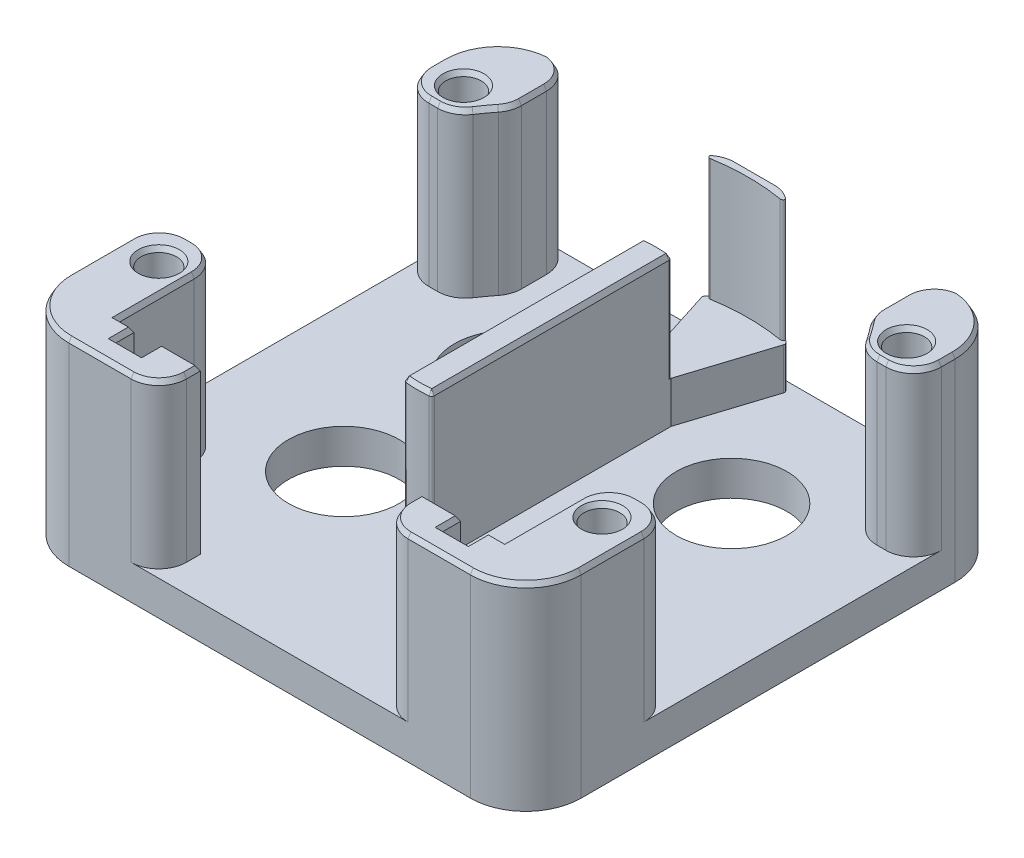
ISO-10303-21;
HEADER;
FILE_DESCRIPTION(('STEP AP214'),'2;1');
FILE_NAME('part.step','',(''),(''),'','','');
FILE_SCHEMA(('AUTOMOTIVE_DESIGN { 1 0 10303 214 1 1 1 1 }'));
ENDSEC;
DATA;
#1=APPLICATION_CONTEXT('core data for automotive mechanical design processes');
#2=APPLICATION_PROTOCOL_DEFINITION('international standard','automotive_design',2000,#1);
#3=PRODUCT_CONTEXT('',#1,'mechanical');
#4=PRODUCT('Part','Part','',(#3));
#5=PRODUCT_RELATED_PRODUCT_CATEGORY('part','',(#4));
#6=PRODUCT_DEFINITION_FORMATION('','',#4);
#7=PRODUCT_DEFINITION_CONTEXT('part definition',#1,'design');
#8=PRODUCT_DEFINITION('design','',#6,#7);
#9=PRODUCT_DEFINITION_SHAPE('','',#8);
#10=(LENGTH_UNIT() NAMED_UNIT(*) SI_UNIT(.MILLI.,.METRE.));
#11=(NAMED_UNIT(*) PLANE_ANGLE_UNIT() SI_UNIT($,.RADIAN.));
#12=(NAMED_UNIT(*) SI_UNIT($,.STERADIAN.) SOLID_ANGLE_UNIT());
#13=UNCERTAINTY_MEASURE_WITH_UNIT(LENGTH_MEASURE(1.E-05),#10,'distance_accuracy_value','');
#14=(GEOMETRIC_REPRESENTATION_CONTEXT(3) GLOBAL_UNCERTAINTY_ASSIGNED_CONTEXT((#13)) GLOBAL_UNIT_ASSIGNED_CONTEXT((#10,
#11,#12)) REPRESENTATION_CONTEXT('',''));
#15=CARTESIAN_POINT('',(0.,0.,0.));
#16=DIRECTION('',(0.,0.,1.));
#17=DIRECTION('',(1.,0.,0.));
#18=AXIS2_PLACEMENT_3D('',#15,#16,#17);
#19=CARTESIAN_POINT('',(0.,3.175,0.));
#20=DIRECTION('',(0.,1.,0.));
#21=DIRECTION('',(0.,0.,1.));
#22=AXIS2_PLACEMENT_3D('',#19,#20,#21);
#23=PLANE('',#22);
#24=CARTESIAN_POINT('',(-10.16,3.175,-28.3944930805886));
#25=DIRECTION('',(0.,1.,0.));
#26=DIRECTION('',(0.,0.,1.));
#27=AXIS2_PLACEMENT_3D('',#24,#25,#26);
#28=CIRCLE('',#27,5.08);
#29=CARTESIAN_POINT('',(-10.16,3.175,-23.3144930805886));
#30=VERTEX_POINT('',#29);
#31=EDGE_CURVE('E1566',#30,#30,#28,.F.);
#32=ORIENTED_EDGE('',*,*,#31,.T.);
#33=EDGE_LOOP('',(#32));
#34=FACE_BOUND('',#33,.T.);
#35=CARTESIAN_POINT('',(-10.16,3.175,-13.1544930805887));
#36=DIRECTION('',(0.,1.,0.));
#37=DIRECTION('',(0.,0.,1.));
#38=AXIS2_PLACEMENT_3D('',#35,#36,#37);
#39=CIRCLE('',#38,5.08);
#40=CARTESIAN_POINT('',(-10.16,3.175,-8.07449308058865));
#41=VERTEX_POINT('',#40);
#42=EDGE_CURVE('E1567',#41,#41,#39,.F.);
#43=ORIENTED_EDGE('',*,*,#42,.T.);
#44=EDGE_LOOP('',(#43));
#45=FACE_BOUND('',#44,.T.);
#46=DIRECTION('',(-1.,0.,0.));
#47=VECTOR('',#46,1.);
#48=CARTESIAN_POINT('',(-23.495,3.175,-40.64));
#49=LINE('',#48,#47);
#50=CARTESIAN_POINT('',(-1.83629042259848,3.175,-40.64));
#51=VERTEX_POINT('',#50);
#52=CARTESIAN_POINT('',(-18.415,3.175,-40.64));
#53=VERTEX_POINT('',#52);
#54=EDGE_CURVE('E1596',#51,#53,#49,.T.);
#55=ORIENTED_EDGE('',*,*,#54,.T.);
#56=CARTESIAN_POINT('',(-18.415,3.175,-35.56));
#57=DIRECTION('',(0.,1.,0.));
#58=DIRECTION('',(0.,0.,1.));
#59=AXIS2_PLACEMENT_3D('',#56,#57,#58);
#60=CIRCLE('',#59,5.08);
#61=CARTESIAN_POINT('',(-18.7870780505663,3.175,-40.6263554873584));
#62=VERTEX_POINT('',#61);
#63=EDGE_CURVE('E1494',#53,#62,#60,.T.);
#64=ORIENTED_EDGE('',*,*,#63,.T.);
#65=CARTESIAN_POINT('',(-19.05,3.175,-38.1));
#66=DIRECTION('',(0.,1.,0.));
#67=DIRECTION('',(0.,0.,1.));
#68=AXIS2_PLACEMENT_3D('',#65,#66,#67);
#69=CIRCLE('',#68,2.54);
#70=CARTESIAN_POINT('',(-16.51,3.175,-38.1));
#71=VERTEX_POINT('',#70);
#72=EDGE_CURVE('E1511',#62,#71,#69,.F.);
#73=ORIENTED_EDGE('',*,*,#72,.T.);
#74=DIRECTION('',(0.,0.,1.));
#75=VECTOR('',#74,1.);
#76=CARTESIAN_POINT('',(-16.51,3.175,0.));
#77=LINE('',#76,#75);
#78=CARTESIAN_POINT('',(-16.51,3.175,-35.7911354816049));
#79=VERTEX_POINT('',#78);
#80=EDGE_CURVE('E1653',#71,#79,#77,.T.);
#81=ORIENTED_EDGE('',*,*,#80,.T.);
#82=CARTESIAN_POINT('',(-19.05,3.175,-35.7911354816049));
#83=DIRECTION('',(0.,1.,0.));
#84=DIRECTION('',(0.,0.,1.));
#85=AXIS2_PLACEMENT_3D('',#82,#83,#84);
#86=CIRCLE('',#85,2.54);
#87=CARTESIAN_POINT('',(-17.0552356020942,3.175,-34.2187121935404));
#88=VERTEX_POINT('',#87);
#89=EDGE_CURVE('E1523',#79,#88,#86,.F.);
#90=ORIENTED_EDGE('',*,*,#89,.T.);
#91=CARTESIAN_POINT('',(0.,3.175,-20.7744930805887));
#92=DIRECTION('',(0.,1.,0.));
#93=DIRECTION('',(0.,0.,1.));
#94=AXIS2_PLACEMENT_3D('',#91,#92,#93);
#95=CIRCLE('',#94,21.717);
#96=CARTESIAN_POINT('',(-18.0336225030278,3.175,-32.8747636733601));
#97=VERTEX_POINT('',#96);
#98=EDGE_CURVE('E1650',#88,#97,#95,.T.);
#99=ORIENTED_EDGE('',*,*,#98,.T.);
#100=CARTESIAN_POINT('',(-20.142818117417,3.175,-34.29));
#101=DIRECTION('',(0.,1.,0.));
#102=DIRECTION('',(0.,0.,1.));
#103=AXIS2_PLACEMENT_3D('',#100,#101,#102);
#104=CIRCLE('',#103,2.54);
#105=CARTESIAN_POINT('',(-20.142818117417,3.175,-31.75));
#106=VERTEX_POINT('',#105);
#107=EDGE_CURVE('E1521',#97,#106,#104,.F.);
#108=ORIENTED_EDGE('',*,*,#107,.T.);
#109=DIRECTION('',(-1.,0.,0.));
#110=VECTOR('',#109,1.);
#111=CARTESIAN_POINT('',(0.,3.175,-31.75));
#112=LINE('',#111,#110);
#113=CARTESIAN_POINT('',(-20.955,3.175,-31.75));
#114=VERTEX_POINT('',#113);
#115=EDGE_CURVE('E1647',#106,#114,#112,.T.);
#116=ORIENTED_EDGE('',*,*,#115,.T.);
#117=CARTESIAN_POINT('',(-20.955,3.175,-34.29));
#118=DIRECTION('',(0.,1.,0.));
#119=DIRECTION('',(0.,0.,1.));
#120=AXIS2_PLACEMENT_3D('',#117,#118,#119);
#121=CIRCLE('',#120,2.54);
#122=CARTESIAN_POINT('',(-23.495,3.175,-34.29));
#123=VERTEX_POINT('',#122);
#124=EDGE_CURVE('E1513',#114,#123,#121,.F.);
#125=ORIENTED_EDGE('',*,*,#124,.T.);
#126=DIRECTION('',(0.,0.,1.));
#127=VECTOR('',#126,1.);
#128=CARTESIAN_POINT('',(-23.495,3.175,-40.64));
#129=LINE('',#128,#127);
#130=CARTESIAN_POINT('',(-23.495,3.175,-7.03062264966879));
#131=VERTEX_POINT('',#130);
#132=EDGE_CURVE('E1599',#123,#131,#129,.T.);
#133=ORIENTED_EDGE('',*,*,#132,.T.);
#134=CARTESIAN_POINT('',(-20.955,3.175,-7.03062264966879));
#135=DIRECTION('',(0.,1.,0.));
#136=DIRECTION('',(0.,0.,1.));
#137=AXIS2_PLACEMENT_3D('',#134,#135,#136);
#138=CIRCLE('',#137,2.54);
#139=CARTESIAN_POINT('',(-20.955,3.175,-9.57062264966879));
#140=VERTEX_POINT('',#139);
#141=EDGE_CURVE('E1509',#131,#140,#138,.F.);
#142=ORIENTED_EDGE('',*,*,#141,.T.);
#143=DIRECTION('',(1.,0.,0.));
#144=VECTOR('',#143,1.);
#145=CARTESIAN_POINT('',(0.,3.175,-9.57062264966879));
#146=LINE('',#145,#144);
#147=CARTESIAN_POINT('',(-20.294,3.175,-9.57062264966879));
#148=VERTEX_POINT('',#147);
#149=EDGE_CURVE('E1592',#140,#148,#146,.T.);
#150=ORIENTED_EDGE('',*,*,#149,.T.);
#151=CARTESIAN_POINT('',(-20.294,3.175,-7.03062264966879));
#152=DIRECTION('',(0.,1.,0.));
#153=DIRECTION('',(0.,0.,1.));
#154=AXIS2_PLACEMENT_3D('',#151,#152,#153);
#155=CIRCLE('',#154,2.54);
#156=CARTESIAN_POINT('',(-17.754,3.175,-7.03062264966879));
#157=VERTEX_POINT('',#156);
#158=EDGE_CURVE('E1507',#148,#157,#155,.F.);
#159=ORIENTED_EDGE('',*,*,#158,.T.);
#160=DIRECTION('',(0.,0.,1.));
#161=VECTOR('',#160,1.);
#162=CARTESIAN_POINT('',(-17.754,3.175,0.));
#163=LINE('',#162,#161);
#164=CARTESIAN_POINT('',(-17.754,3.175,0.));
#165=VERTEX_POINT('',#164);
#166=EDGE_CURVE('E1589',#157,#165,#163,.T.);
#167=ORIENTED_EDGE('',*,*,#166,.T.);
#168=DIRECTION('',(1.,0.,0.));
#169=VECTOR('',#168,1.);
#170=CARTESIAN_POINT('',(0.,3.175,0.));
#171=LINE('',#170,#169);
#172=CARTESIAN_POINT('',(-16.2560000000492,3.175,0.));
#173=VERTEX_POINT('',#172);
#174=EDGE_CURVE('E1586',#165,#173,#171,.T.);
#175=ORIENTED_EDGE('',*,*,#174,.T.);
#176=DIRECTION('',(0.,0.,1.));
#177=VECTOR('',#176,1.);
#178=CARTESIAN_POINT('',(-16.2560000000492,3.175,0.));
#179=LINE('',#178,#177);
#180=CARTESIAN_POINT('',(-16.2560000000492,3.175,1.83866167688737));
#181=VERTEX_POINT('',#180);
#182=EDGE_CURVE('E1583',#173,#181,#179,.T.);
#183=ORIENTED_EDGE('',*,*,#182,.T.);
#184=DIRECTION('',(1.,0.,0.));
#185=VECTOR('',#184,1.);
#186=CARTESIAN_POINT('',(0.,3.175,1.83866167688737));
#187=LINE('',#186,#185);
#188=CARTESIAN_POINT('',(-13.7160000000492,3.175,1.83866167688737));
#189=VERTEX_POINT('',#188);
#190=EDGE_CURVE('E1580',#181,#189,#187,.T.);
#191=ORIENTED_EDGE('',*,*,#190,.T.);
#192=DIRECTION('',(0.,0.,-1.));
#193=VECTOR('',#192,1.);
#194=CARTESIAN_POINT('',(-13.7160000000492,3.175,0.));
#195=LINE('',#194,#193);
#196=CARTESIAN_POINT('',(-13.7160000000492,3.175,0.));
#197=VERTEX_POINT('',#196);
#198=EDGE_CURVE('E1577',#189,#197,#195,.T.);
#199=ORIENTED_EDGE('',*,*,#198,.T.);
#200=DIRECTION('',(1.,0.,0.));
#201=VECTOR('',#200,1.);
#202=CARTESIAN_POINT('',(0.,3.175,0.));
#203=LINE('',#202,#201);
#204=CARTESIAN_POINT('',(-10.1600000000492,3.175,0.));
#205=VERTEX_POINT('',#204);
#206=EDGE_CURVE('E1574',#197,#205,#203,.T.);
#207=ORIENTED_EDGE('',*,*,#206,.T.);
#208=DIRECTION('',(0.,0.,1.));
#209=VECTOR('',#208,1.);
#210=CARTESIAN_POINT('',(-10.1600000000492,3.175,0.));
#211=LINE('',#210,#209);
#212=CARTESIAN_POINT('',(-10.1600000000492,3.175,1.27));
#213=VERTEX_POINT('',#212);
#214=EDGE_CURVE('E1562',#205,#213,#211,.T.);
#215=ORIENTED_EDGE('',*,*,#214,.T.);
#216=CARTESIAN_POINT('',(-12.7000000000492,3.175,1.27));
#217=DIRECTION('',(0.,1.,0.));
#218=DIRECTION('',(0.,0.,1.));
#219=AXIS2_PLACEMENT_3D('',#216,#217,#218);
#220=CIRCLE('',#219,2.54);
#221=CARTESIAN_POINT('',(-12.7000000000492,3.175,3.81));
#222=VERTEX_POINT('',#221);
#223=EDGE_CURVE('E1518',#213,#222,#220,.F.);
#224=ORIENTED_EDGE('',*,*,#223,.T.);
#225=DIRECTION('',(1.,0.,0.));
#226=VECTOR('',#225,1.);
#227=CARTESIAN_POINT('',(-23.495,3.175,3.81));
#228=LINE('',#227,#226);
#229=CARTESIAN_POINT('',(12.7000000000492,3.175,3.81));
#230=VERTEX_POINT('',#229);
#231=EDGE_CURVE('E1595',#222,#230,#228,.T.);
#232=ORIENTED_EDGE('',*,*,#231,.T.);
#233=CARTESIAN_POINT('',(12.7000000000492,3.175,1.27));
#234=DIRECTION('',(0.,-1.,0.));
#235=DIRECTION('',(0.,0.,1.));
#236=AXIS2_PLACEMENT_3D('',#233,#234,#235);
#237=CIRCLE('',#236,2.54);
#238=CARTESIAN_POINT('',(10.1600000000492,3.175,1.27));
#239=VERTEX_POINT('',#238);
#240=EDGE_CURVE('E756',#239,#230,#237,.F.);
#241=ORIENTED_EDGE('',*,*,#240,.F.);
#242=DIRECTION('',(0.,0.,1.));
#243=VECTOR('',#242,1.);
#244=CARTESIAN_POINT('',(10.1600000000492,3.175,0.));
#245=LINE('',#244,#243);
#246=CARTESIAN_POINT('',(10.1600000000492,3.175,0.));
#247=VERTEX_POINT('',#246);
#248=EDGE_CURVE('E699',#247,#239,#245,.T.);
#249=ORIENTED_EDGE('',*,*,#248,.F.);
#250=DIRECTION('',(-1.,0.,0.));
#251=VECTOR('',#250,1.);
#252=CARTESIAN_POINT('',(0.,3.175,0.));
#253=LINE('',#252,#251);
#254=CARTESIAN_POINT('',(13.7160000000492,3.175,0.));
#255=VERTEX_POINT('',#254);
#256=EDGE_CURVE('E696',#255,#247,#253,.T.);
#257=ORIENTED_EDGE('',*,*,#256,.F.);
#258=DIRECTION('',(0.,0.,-1.));
#259=VECTOR('',#258,1.);
#260=CARTESIAN_POINT('',(13.7160000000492,3.175,0.));
#261=LINE('',#260,#259);
#262=CARTESIAN_POINT('',(13.7160000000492,3.175,1.83866167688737));
#263=VERTEX_POINT('',#262);
#264=EDGE_CURVE('E693',#263,#255,#261,.T.);
#265=ORIENTED_EDGE('',*,*,#264,.F.);
#266=DIRECTION('',(-1.,0.,0.));
#267=VECTOR('',#266,1.);
#268=CARTESIAN_POINT('',(0.,3.175,1.83866167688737));
#269=LINE('',#268,#267);
#270=CARTESIAN_POINT('',(16.2560000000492,3.175,1.83866167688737));
#271=VERTEX_POINT('',#270);
#272=EDGE_CURVE('E690',#271,#263,#269,.T.);
#273=ORIENTED_EDGE('',*,*,#272,.F.);
#274=DIRECTION('',(0.,0.,1.));
#275=VECTOR('',#274,1.);
#276=CARTESIAN_POINT('',(16.2560000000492,3.175,0.));
#277=LINE('',#276,#275);
#278=CARTESIAN_POINT('',(16.2560000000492,3.175,0.));
#279=VERTEX_POINT('',#278);
#280=EDGE_CURVE('E687',#279,#271,#277,.T.);
#281=ORIENTED_EDGE('',*,*,#280,.F.);
#282=DIRECTION('',(-1.,0.,0.));
#283=VECTOR('',#282,1.);
#284=CARTESIAN_POINT('',(0.,3.175,0.));
#285=LINE('',#284,#283);
#286=CARTESIAN_POINT('',(17.754,3.175,0.));
#287=VERTEX_POINT('',#286);
#288=EDGE_CURVE('E684',#287,#279,#285,.T.);
#289=ORIENTED_EDGE('',*,*,#288,.F.);
#290=DIRECTION('',(0.,0.,1.));
#291=VECTOR('',#290,1.);
#292=CARTESIAN_POINT('',(17.754,3.175,0.));
#293=LINE('',#292,#291);
#294=CARTESIAN_POINT('',(17.754,3.175,-7.03062264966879));
#295=VERTEX_POINT('',#294);
#296=EDGE_CURVE('E681',#295,#287,#293,.T.);
#297=ORIENTED_EDGE('',*,*,#296,.F.);
#298=CARTESIAN_POINT('',(20.294,3.175,-7.03062264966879));
#299=DIRECTION('',(0.,-1.,0.));
#300=DIRECTION('',(0.,0.,1.));
#301=AXIS2_PLACEMENT_3D('',#298,#299,#300);
#302=CIRCLE('',#301,2.54);
#303=CARTESIAN_POINT('',(20.294,3.175,-9.57062264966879));
#304=VERTEX_POINT('',#303);
#305=EDGE_CURVE('E771',#304,#295,#302,.F.);
#306=ORIENTED_EDGE('',*,*,#305,.F.);
#307=DIRECTION('',(-1.,0.,0.));
#308=VECTOR('',#307,1.);
#309=CARTESIAN_POINT('',(0.,3.175,-9.57062264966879));
#310=LINE('',#309,#308);
#311=CARTESIAN_POINT('',(20.955,3.175,-9.57062264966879));
#312=VERTEX_POINT('',#311);
#313=EDGE_CURVE('E676',#312,#304,#310,.T.);
#314=ORIENTED_EDGE('',*,*,#313,.F.);
#315=CARTESIAN_POINT('',(20.955,3.175,-7.03062264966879));
#316=DIRECTION('',(0.,-1.,0.));
#317=DIRECTION('',(0.,0.,1.));
#318=AXIS2_PLACEMENT_3D('',#315,#316,#317);
#319=CIRCLE('',#318,2.54);
#320=CARTESIAN_POINT('',(23.495,3.175,-7.03062264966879));
#321=VERTEX_POINT('',#320);
#322=EDGE_CURVE('E768',#321,#312,#319,.F.);
#323=ORIENTED_EDGE('',*,*,#322,.F.);
#324=DIRECTION('',(0.,0.,1.));
#325=VECTOR('',#324,1.);
#326=CARTESIAN_POINT('',(23.495,3.175,-40.64));
#327=LINE('',#326,#325);
#328=CARTESIAN_POINT('',(23.495,3.175,-34.29));
#329=VERTEX_POINT('',#328);
#330=EDGE_CURVE('E673',#329,#321,#327,.T.);
#331=ORIENTED_EDGE('',*,*,#330,.F.);
#332=CARTESIAN_POINT('',(20.955,3.175,-34.29));
#333=DIRECTION('',(0.,-1.,0.));
#334=DIRECTION('',(0.,0.,1.));
#335=AXIS2_PLACEMENT_3D('',#332,#333,#334);
#336=CIRCLE('',#335,2.54);
#337=CARTESIAN_POINT('',(20.955,3.175,-31.75));
#338=VERTEX_POINT('',#337);
#339=EDGE_CURVE('E762',#338,#329,#336,.F.);
#340=ORIENTED_EDGE('',*,*,#339,.F.);
#341=DIRECTION('',(1.,0.,0.));
#342=VECTOR('',#341,1.);
#343=CARTESIAN_POINT('',(0.,3.175,-31.75));
#344=LINE('',#343,#342);
#345=CARTESIAN_POINT('',(20.142818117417,3.175,-31.75));
#346=VERTEX_POINT('',#345);
#347=EDGE_CURVE('E633',#346,#338,#344,.T.);
#348=ORIENTED_EDGE('',*,*,#347,.F.);
#349=CARTESIAN_POINT('',(20.142818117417,3.175,-34.29));
#350=DIRECTION('',(0.,-1.,0.));
#351=DIRECTION('',(0.,0.,1.));
#352=AXIS2_PLACEMENT_3D('',#349,#350,#351);
#353=CIRCLE('',#352,2.54);
#354=CARTESIAN_POINT('',(18.0336225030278,3.175,-32.8747636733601));
#355=VERTEX_POINT('',#354);
#356=EDGE_CURVE('E753',#355,#346,#353,.F.);
#357=ORIENTED_EDGE('',*,*,#356,.F.);
#358=CARTESIAN_POINT('',(0.,3.175,-20.7744930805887));
#359=DIRECTION('',(0.,-1.,0.));
#360=DIRECTION('',(0.,0.,1.));
#361=AXIS2_PLACEMENT_3D('',#358,#359,#360);
#362=CIRCLE('',#361,21.717);
#363=CARTESIAN_POINT('',(17.0552356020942,3.175,-34.2187121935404));
#364=VERTEX_POINT('',#363);
#365=EDGE_CURVE('E1761',#364,#355,#362,.T.);
#366=ORIENTED_EDGE('',*,*,#365,.F.);
#367=CARTESIAN_POINT('',(19.05,3.175,-35.7911354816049));
#368=DIRECTION('',(0.,-1.,0.));
#369=DIRECTION('',(0.,0.,1.));
#370=AXIS2_PLACEMENT_3D('',#367,#368,#369);
#371=CIRCLE('',#370,2.54);
#372=CARTESIAN_POINT('',(16.51,3.175,-35.7911354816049));
#373=VERTEX_POINT('',#372);
#374=EDGE_CURVE('E750',#373,#364,#371,.F.);
#375=ORIENTED_EDGE('',*,*,#374,.F.);
#376=DIRECTION('',(0.,0.,1.));
#377=VECTOR('',#376,1.);
#378=CARTESIAN_POINT('',(16.51,3.175,0.));
#379=LINE('',#378,#377);
#380=CARTESIAN_POINT('',(16.51,3.175,-38.1));
#381=VERTEX_POINT('',#380);
#382=EDGE_CURVE('E1762',#381,#373,#379,.T.);
#383=ORIENTED_EDGE('',*,*,#382,.F.);
#384=CARTESIAN_POINT('',(19.05,3.175,-38.1));
#385=DIRECTION('',(0.,-1.,0.));
#386=DIRECTION('',(0.,0.,1.));
#387=AXIS2_PLACEMENT_3D('',#384,#385,#386);
#388=CIRCLE('',#387,2.54);
#389=CARTESIAN_POINT('',(18.7870780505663,3.175,-40.6263554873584));
#390=VERTEX_POINT('',#389);
#391=EDGE_CURVE('E765',#390,#381,#388,.F.);
#392=ORIENTED_EDGE('',*,*,#391,.F.);
#393=CARTESIAN_POINT('',(18.415,3.175,-35.56));
#394=DIRECTION('',(0.,-1.,0.));
#395=DIRECTION('',(0.,0.,1.));
#396=AXIS2_PLACEMENT_3D('',#393,#394,#395);
#397=CIRCLE('',#396,5.08);
#398=CARTESIAN_POINT('',(18.415,3.175,-40.64));
#399=VERTEX_POINT('',#398);
#400=EDGE_CURVE('E787',#399,#390,#397,.T.);
#401=ORIENTED_EDGE('',*,*,#400,.F.);
#402=DIRECTION('',(1.,0.,0.));
#403=VECTOR('',#402,1.);
#404=CARTESIAN_POINT('',(23.495,3.175,-40.64));
#405=LINE('',#404,#403);
#406=CARTESIAN_POINT('',(1.83629042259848,3.175,-40.64));
#407=VERTEX_POINT('',#406);
#408=EDGE_CURVE('E672',#407,#399,#405,.T.);
#409=ORIENTED_EDGE('',*,*,#408,.F.);
#410=CARTESIAN_POINT('',(1.83629042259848,3.175,-38.1));
#411=DIRECTION('',(0.,-1.,0.));
#412=DIRECTION('',(0.,0.,1.));
#413=AXIS2_PLACEMENT_3D('',#410,#411,#412);
#414=CIRCLE('',#413,2.54);
#415=CARTESIAN_POINT('',(3.71248650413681,3.175,-39.8121589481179));
#416=VERTEX_POINT('',#415);
#417=EDGE_CURVE('E759',#416,#407,#414,.F.);
#418=ORIENTED_EDGE('',*,*,#417,.F.);
#419=CARTESIAN_POINT('',(3.52486689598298,3.175,-39.6409430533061));
#420=DIRECTION('',(0.,-1.,0.));
#421=DIRECTION('',(0.,0.,1.));
#422=AXIS2_PLACEMENT_3D('',#419,#420,#421);
#423=CIRCLE('',#422,0.254);
#424=CARTESIAN_POINT('',(3.76681373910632,3.175,-39.5636273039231));
#425=VERTEX_POINT('',#424);
#426=EDGE_CURVE('E812',#425,#416,#423,.F.);
#427=ORIENTED_EDGE('',*,*,#426,.F.);
#428=DIRECTION('',(0.304392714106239,0.,-0.952546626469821));
#429=VECTOR('',#428,1.);
#430=CARTESIAN_POINT('',(-8.05360472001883,3.175,-2.57358383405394));
#431=LINE('',#430,#429);
#432=CARTESIAN_POINT('',(1.27000000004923,3.175,-31.7502618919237));
#433=VERTEX_POINT('',#432);
#434=EDGE_CURVE('E651',#433,#425,#431,.T.);
#435=ORIENTED_EDGE('',*,*,#434,.F.);
#436=DIRECTION('',(0.,0.,-1.));
#437=VECTOR('',#436,1.);
#438=CARTESIAN_POINT('',(1.27000000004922,3.175,0.));
#439=LINE('',#438,#437);
#440=CARTESIAN_POINT('',(1.27000000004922,3.175,-10.027411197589));
#441=VERTEX_POINT('',#440);
#442=EDGE_CURVE('E649',#441,#433,#439,.T.);
#443=ORIENTED_EDGE('',*,*,#442,.F.);
#444=CARTESIAN_POINT('',(1.01600000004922,3.175,-10.027411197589));
#445=DIRECTION('',(0.,-1.,0.));
#446=DIRECTION('',(0.,0.,1.));
#447=AXIS2_PLACEMENT_3D('',#444,#445,#446);
#448=CIRCLE('',#447,0.254);
#449=CARTESIAN_POINT('',(1.03990588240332,3.175,-9.77453868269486));
#450=VERTEX_POINT('',#449);
#451=EDGE_CURVE('E828',#450,#441,#448,.F.);
#452=ORIENTED_EDGE('',*,*,#451,.F.);
#453=CARTESIAN_POINT('',(0.,3.175,-20.7744930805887));
#454=DIRECTION('',(0.,1.,0.));
#455=DIRECTION('',(0.,0.,1.));
#456=AXIS2_PLACEMENT_3D('',#453,#454,#455);
#457=CIRCLE('',#456,11.049);
#458=CARTESIAN_POINT('',(-1.03990588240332,3.175,-9.77453868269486));
#459=VERTEX_POINT('',#458);
#460=EDGE_CURVE('E1625',#450,#459,#457,.F.);
#461=ORIENTED_EDGE('',*,*,#460,.T.);
#462=CARTESIAN_POINT('',(-1.01600000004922,3.175,-10.027411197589));
#463=DIRECTION('',(0.,1.,0.));
#464=DIRECTION('',(0.,0.,1.));
#465=AXIS2_PLACEMENT_3D('',#462,#463,#464);
#466=CIRCLE('',#465,0.254);
#467=CARTESIAN_POINT('',(-1.27000000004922,3.175,-10.027411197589));
#468=VERTEX_POINT('',#467);
#469=EDGE_CURVE('E1452',#459,#468,#466,.F.);
#470=ORIENTED_EDGE('',*,*,#469,.T.);
#471=DIRECTION('',(0.,0.,-1.));
#472=VECTOR('',#471,1.);
#473=CARTESIAN_POINT('',(-1.27000000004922,3.175,0.));
#474=LINE('',#473,#472);
#475=CARTESIAN_POINT('',(-1.27000000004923,3.175,-31.7502618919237));
#476=VERTEX_POINT('',#475);
#477=EDGE_CURVE('E1623',#468,#476,#474,.T.);
#478=ORIENTED_EDGE('',*,*,#477,.T.);
#479=DIRECTION('',(-0.304392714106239,0.,-0.952546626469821));
#480=VECTOR('',#479,1.);
#481=CARTESIAN_POINT('',(8.05360472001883,3.175,-2.57358383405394));
#482=LINE('',#481,#480);
#483=CARTESIAN_POINT('',(-3.76681373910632,3.175,-39.5636273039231));
#484=VERTEX_POINT('',#483);
#485=EDGE_CURVE('E1632',#476,#484,#482,.T.);
#486=ORIENTED_EDGE('',*,*,#485,.T.);
#487=CARTESIAN_POINT('',(-3.52486689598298,3.175,-39.6409430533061));
#488=DIRECTION('',(0.,1.,0.));
#489=DIRECTION('',(0.,0.,1.));
#490=AXIS2_PLACEMENT_3D('',#487,#488,#489);
#491=CIRCLE('',#490,0.254);
#492=CARTESIAN_POINT('',(-3.71248650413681,3.175,-39.8121589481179));
#493=VERTEX_POINT('',#492);
#494=EDGE_CURVE('E1470',#484,#493,#491,.F.);
#495=ORIENTED_EDGE('',*,*,#494,.T.);
#496=CARTESIAN_POINT('',(-1.83629042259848,3.175,-38.1));
#497=DIRECTION('',(0.,1.,0.));
#498=DIRECTION('',(0.,0.,1.));
#499=AXIS2_PLACEMENT_3D('',#496,#497,#498);
#500=CIRCLE('',#499,2.54);
#501=EDGE_CURVE('E1516',#493,#51,#500,.F.);
#502=ORIENTED_EDGE('',*,*,#501,.T.);
#503=EDGE_LOOP('',(#55,#64,#73,#81,#90,#99,#108,#116,#125,#133,#142,#150,#159,#167,#175,#183,
#191,#199,#207,#215,#224,#232,#241,#249,#257,#265,#273,#281,#289,#297,#306,#314,#323,#331,#340,
#348,#357,#366,#375,#383,#392,#401,#409,#418,#427,#435,#443,#452,#461,#470,#478,#486,#495,#502));
#504=FACE_BOUND('',#503,.T.);
#505=CARTESIAN_POINT('',(10.16,3.175,-28.3944930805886));
#506=DIRECTION('',(0.,-1.,0.));
#507=DIRECTION('',(0.,0.,1.));
#508=AXIS2_PLACEMENT_3D('',#505,#506,#507);
#509=CIRCLE('',#508,5.08);
#510=CARTESIAN_POINT('',(10.16,3.175,-23.3144930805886));
#511=VERTEX_POINT('',#510);
#512=EDGE_CURVE('E711',#511,#511,#509,.F.);
#513=ORIENTED_EDGE('',*,*,#512,.F.);
#514=EDGE_LOOP('',(#513));
#515=FACE_BOUND('',#514,.T.);
#516=CARTESIAN_POINT('',(10.16,3.175,-13.1544930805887));
#517=DIRECTION('',(0.,-1.,0.));
#518=DIRECTION('',(0.,0.,1.));
#519=AXIS2_PLACEMENT_3D('',#516,#517,#518);
#520=CIRCLE('',#519,5.08);
#521=CARTESIAN_POINT('',(10.16,3.175,-8.07449308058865));
#522=VERTEX_POINT('',#521);
#523=EDGE_CURVE('E706',#522,#522,#520,.F.);
#524=ORIENTED_EDGE('',*,*,#523,.F.);
#525=EDGE_LOOP('',(#524));
#526=FACE_BOUND('',#525,.T.);
#527=ADVANCED_FACE('F45',(#34,#45,#504,#515,#526),#23,.T.);
#528=CARTESIAN_POINT('',(-23.495,53.4524057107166,-40.64));
#529=DIRECTION('',(1.,0.,0.));
#530=DIRECTION('',(0.,0.,-1.));
#531=AXIS2_PLACEMENT_3D('',#528,#529,#530);
#532=PLANE('',#531);
#533=DIRECTION('',(0.,-1.,0.));
#534=VECTOR('',#533,1.);
#535=CARTESIAN_POINT('',(-23.495,53.4524057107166,-34.29));
#536=LINE('',#535,#534);
#537=CARTESIAN_POINT('',(-23.495,17.7350590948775,-34.29));
#538=VERTEX_POINT('',#537);
#539=EDGE_CURVE('E1533',#123,#538,#536,.F.);
#540=ORIENTED_EDGE('',*,*,#539,.T.);
#541=DIRECTION('',(0.,0.,-1.));
#542=VECTOR('',#541,1.);
#543=CARTESIAN_POINT('',(-23.495,17.7350590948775,-35.56));
#544=LINE('',#543,#542);
#545=CARTESIAN_POINT('',(-23.495,17.7350590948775,-35.56));
#546=VERTEX_POINT('',#545);
#547=EDGE_CURVE('E1423',#538,#546,#544,.T.);
#548=ORIENTED_EDGE('',*,*,#547,.T.);
#549=DIRECTION('',(0.,-1.,0.));
#550=VECTOR('',#549,1.);
#551=CARTESIAN_POINT('',(-23.495,53.4524057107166,-35.56));
#552=LINE('',#551,#550);
#553=CARTESIAN_POINT('',(-23.495,0.,-35.56));
#554=VERTEX_POINT('',#553);
#555=EDGE_CURVE('E1502',#546,#554,#552,.T.);
#556=ORIENTED_EDGE('',*,*,#555,.T.);
#557=DIRECTION('',(0.,0.,1.));
#558=VECTOR('',#557,1.);
#559=CARTESIAN_POINT('',(-23.495,0.,-40.64));
#560=LINE('',#559,#558);
#561=CARTESIAN_POINT('',(-23.495,0.,-1.27));
#562=VERTEX_POINT('',#561);
#563=EDGE_CURVE('E1604',#554,#562,#560,.T.);
#564=ORIENTED_EDGE('',*,*,#563,.T.);
#565=DIRECTION('',(0.,-1.,0.));
#566=VECTOR('',#565,1.);
#567=CARTESIAN_POINT('',(-23.495,53.4524057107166,-1.27));
#568=LINE('',#567,#566);
#569=CARTESIAN_POINT('',(-23.495,17.7350590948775,-1.27));
#570=VERTEX_POINT('',#569);
#571=EDGE_CURVE('E1504',#562,#570,#568,.F.);
#572=ORIENTED_EDGE('',*,*,#571,.T.);
#573=DIRECTION('',(0.,0.,-1.));
#574=VECTOR('',#573,1.);
#575=CARTESIAN_POINT('',(-23.495,17.7350590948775,-7.03062264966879));
#576=LINE('',#575,#574);
#577=CARTESIAN_POINT('',(-23.495,17.7350590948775,-7.03062264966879));
#578=VERTEX_POINT('',#577);
#579=EDGE_CURVE('E1425',#570,#578,#576,.T.);
#580=ORIENTED_EDGE('',*,*,#579,.T.);
#581=DIRECTION('',(0.,-1.,0.));
#582=VECTOR('',#581,1.);
#583=CARTESIAN_POINT('',(-23.495,53.4524057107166,-7.03062264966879));
#584=LINE('',#583,#582);
#585=EDGE_CURVE('E1536',#578,#131,#584,.T.);
#586=ORIENTED_EDGE('',*,*,#585,.T.);
#587=ORIENTED_EDGE('',*,*,#132,.F.);
#588=EDGE_LOOP('',(#540,#548,#556,#564,#572,#580,#586,#587));
#589=FACE_BOUND('',#588,.T.);
#590=ADVANCED_FACE('F1155',(#589),#532,.F.);
#591=CARTESIAN_POINT('',(-23.495,53.4524057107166,3.81));
#592=DIRECTION('',(0.,0.,-1.));
#593=DIRECTION('',(-1.,0.,0.));
#594=AXIS2_PLACEMENT_3D('',#591,#592,#593);
#595=PLANE('',#594);
#596=DIRECTION('',(0.,-1.,0.));
#597=VECTOR('',#596,1.);
#598=CARTESIAN_POINT('',(-12.7000000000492,53.4524057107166,3.81));
#599=LINE('',#598,#597);
#600=CARTESIAN_POINT('',(-12.7000000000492,17.7350590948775,3.81));
#601=VERTEX_POINT('',#600);
#602=EDGE_CURVE('E1543',#222,#601,#599,.F.);
#603=ORIENTED_EDGE('',*,*,#602,.T.);
#604=DIRECTION('',(-1.,0.,0.));
#605=VECTOR('',#604,1.);
#606=CARTESIAN_POINT('',(-18.415,17.7350590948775,3.81));
#607=LINE('',#606,#605);
#608=CARTESIAN_POINT('',(-18.415,17.7350590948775,3.81));
#609=VERTEX_POINT('',#608);
#610=EDGE_CURVE('E55',#601,#609,#607,.T.);
#611=ORIENTED_EDGE('',*,*,#610,.T.);
#612=DIRECTION('',(0.,-1.,0.));
#613=VECTOR('',#612,1.);
#614=CARTESIAN_POINT('',(-18.415,53.4524057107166,3.81));
#615=LINE('',#614,#613);
#616=CARTESIAN_POINT('',(-18.415,0.,3.81));
#617=VERTEX_POINT('',#616);
#618=EDGE_CURVE('E1489',#609,#617,#615,.T.);
#619=ORIENTED_EDGE('',*,*,#618,.T.);
#620=DIRECTION('',(1.,0.,0.));
#621=VECTOR('',#620,1.);
#622=CARTESIAN_POINT('',(-23.495,0.,3.81));
#623=LINE('',#622,#621);
#624=CARTESIAN_POINT('',(18.415,0.,3.81));
#625=VERTEX_POINT('',#624);
#626=EDGE_CURVE('E1607',#617,#625,#623,.T.);
#627=ORIENTED_EDGE('',*,*,#626,.T.);
#628=DIRECTION('',(0.,-1.,0.));
#629=VECTOR('',#628,1.);
#630=CARTESIAN_POINT('',(18.415,53.4524057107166,3.81));
#631=LINE('',#630,#629);
#632=CARTESIAN_POINT('',(18.415,17.7350590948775,3.81));
#633=VERTEX_POINT('',#632);
#634=EDGE_CURVE('E793',#633,#625,#631,.T.);
#635=ORIENTED_EDGE('',*,*,#634,.F.);
#636=DIRECTION('',(1.,0.,0.));
#637=VECTOR('',#636,1.);
#638=CARTESIAN_POINT('',(18.415,17.7350590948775,3.81));
#639=LINE('',#638,#637);
#640=CARTESIAN_POINT('',(12.7000000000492,17.7350590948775,3.81));
#641=VERTEX_POINT('',#640);
#642=EDGE_CURVE('E987',#641,#633,#639,.T.);
#643=ORIENTED_EDGE('',*,*,#642,.F.);
#644=DIRECTION('',(0.,-1.,0.));
#645=VECTOR('',#644,1.);
#646=CARTESIAN_POINT('',(12.7000000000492,53.4524057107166,3.81));
#647=LINE('',#646,#645);
#648=EDGE_CURVE('E728',#230,#641,#647,.F.);
#649=ORIENTED_EDGE('',*,*,#648,.F.);
#650=ORIENTED_EDGE('',*,*,#231,.F.);
#651=EDGE_LOOP('',(#603,#611,#619,#627,#635,#643,#649,#650));
#652=FACE_BOUND('',#651,.T.);
#653=ADVANCED_FACE('F1163',(#652),#595,.F.);
#654=CARTESIAN_POINT('',(-23.495,53.4524057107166,-40.64));
#655=DIRECTION('',(0.,0.,1.));
#656=DIRECTION('',(1.,0.,0.));
#657=AXIS2_PLACEMENT_3D('',#654,#655,#656);
#658=PLANE('',#657);
#659=DIRECTION('',(-1.,0.,0.));
#660=VECTOR('',#659,1.);
#661=CARTESIAN_POINT('',(-23.495,0.,-40.64));
#662=LINE('',#661,#660);
#663=CARTESIAN_POINT('',(18.415,0.,-40.64));
#664=VERTEX_POINT('',#663);
#665=CARTESIAN_POINT('',(-18.415,0.,-40.64));
#666=VERTEX_POINT('',#665);
#667=EDGE_CURVE('E1600',#664,#666,#662,.T.);
#668=ORIENTED_EDGE('',*,*,#667,.T.);
#669=DIRECTION('',(0.,-1.,0.));
#670=VECTOR('',#669,1.);
#671=CARTESIAN_POINT('',(-18.415,53.4524057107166,-40.64));
#672=LINE('',#671,#670);
#673=EDGE_CURVE('E1496',#666,#53,#672,.F.);
#674=ORIENTED_EDGE('',*,*,#673,.T.);
#675=ORIENTED_EDGE('',*,*,#54,.F.);
#676=DIRECTION('',(0.,-1.,0.));
#677=VECTOR('',#676,1.);
#678=CARTESIAN_POINT('',(-1.83629042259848,53.4524057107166,-40.64));
#679=LINE('',#678,#677);
#680=CARTESIAN_POINT('',(-1.83629042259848,18.175,-40.64));
#681=VERTEX_POINT('',#680);
#682=EDGE_CURVE('E1541',#51,#681,#679,.F.);
#683=ORIENTED_EDGE('',*,*,#682,.T.);
#684=DIRECTION('',(-1.,0.,0.));
#685=VECTOR('',#684,1.);
#686=CARTESIAN_POINT('',(0.,18.175,-40.64));
#687=LINE('',#686,#685);
#688=CARTESIAN_POINT('',(1.83629042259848,18.175,-40.64));
#689=VERTEX_POINT('',#688);
#690=EDGE_CURVE('E1629',#689,#681,#687,.T.);
#691=ORIENTED_EDGE('',*,*,#690,.F.);
#692=DIRECTION('',(0.,-1.,0.));
#693=VECTOR('',#692,1.);
#694=CARTESIAN_POINT('',(1.83629042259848,53.4524057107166,-40.64));
#695=LINE('',#694,#693);
#696=EDGE_CURVE('E731',#407,#689,#695,.F.);
#697=ORIENTED_EDGE('',*,*,#696,.F.);
#698=ORIENTED_EDGE('',*,*,#408,.T.);
#699=DIRECTION('',(0.,-1.,0.));
#700=VECTOR('',#699,1.);
#701=CARTESIAN_POINT('',(18.415,53.4524057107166,-40.64));
#702=LINE('',#701,#700);
#703=EDGE_CURVE('E785',#664,#399,#702,.F.);
#704=ORIENTED_EDGE('',*,*,#703,.F.);
#705=EDGE_LOOP('',(#668,#674,#675,#683,#691,#697,#698,#704));
#706=FACE_BOUND('',#705,.T.);
#707=ADVANCED_FACE('F1779',(#706),#658,.F.);
#708=CARTESIAN_POINT('',(0.,0.,0.));
#709=DIRECTION('',(0.,1.,0.));
#710=DIRECTION('',(0.,0.,1.));
#711=AXIS2_PLACEMENT_3D('',#708,#709,#710);
#712=PLANE('',#711);
#713=CARTESIAN_POINT('',(-20.32,0.,-34.29));
#714=DIRECTION('',(0.,-1.,0.));
#715=DIRECTION('',(0.,0.,-1.));
#716=AXIS2_PLACEMENT_3D('',#713,#714,#715);
#717=CIRCLE('',#716,1.63194999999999);
#718=CARTESIAN_POINT('',(-20.32,0.,-35.92195));
#719=VERTEX_POINT('',#718);
#720=EDGE_CURVE('E1272',#719,#719,#717,.T.);
#721=ORIENTED_EDGE('',*,*,#720,.F.);
#722=EDGE_LOOP('',(#721));
#723=FACE_BOUND('',#722,.T.);
#724=CARTESIAN_POINT('',(-20.32,0.,-6.35));
#725=DIRECTION('',(0.,-1.,0.));
#726=DIRECTION('',(0.,0.,-1.));
#727=AXIS2_PLACEMENT_3D('',#724,#725,#726);
#728=CIRCLE('',#727,1.63194999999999);
#729=CARTESIAN_POINT('',(-20.32,0.,-7.98194999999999));
#730=VERTEX_POINT('',#729);
#731=EDGE_CURVE('E1571',#730,#730,#728,.T.);
#732=ORIENTED_EDGE('',*,*,#731,.F.);
#733=EDGE_LOOP('',(#732));
#734=FACE_BOUND('',#733,.T.);
#735=CARTESIAN_POINT('',(-10.16,0.,-28.3944930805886));
#736=DIRECTION('',(0.,1.,0.));
#737=DIRECTION('',(0.,0.,1.));
#738=AXIS2_PLACEMENT_3D('',#735,#736,#737);
#739=CIRCLE('',#738,5.08);
#740=CARTESIAN_POINT('',(-10.16,0.,-23.3144930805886));
#741=VERTEX_POINT('',#740);
#742=EDGE_CURVE('E1563',#741,#741,#739,.F.);
#743=ORIENTED_EDGE('',*,*,#742,.F.);
#744=EDGE_LOOP('',(#743));
#745=FACE_BOUND('',#744,.T.);
#746=CARTESIAN_POINT('',(-10.16,0.,-13.1544930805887));
#747=DIRECTION('',(0.,1.,0.));
#748=DIRECTION('',(0.,0.,1.));
#749=AXIS2_PLACEMENT_3D('',#746,#747,#748);
#750=CIRCLE('',#749,5.08);
#751=CARTESIAN_POINT('',(-10.16,0.,-8.07449308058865));
#752=VERTEX_POINT('',#751);
#753=EDGE_CURVE('E1568',#752,#752,#750,.F.);
#754=ORIENTED_EDGE('',*,*,#753,.F.);
#755=EDGE_LOOP('',(#754));
#756=FACE_BOUND('',#755,.T.);
#757=ORIENTED_EDGE('',*,*,#563,.F.);
#758=CARTESIAN_POINT('',(-18.415,0.,-35.56));
#759=DIRECTION('',(0.,1.,0.));
#760=DIRECTION('',(0.,0.,1.));
#761=AXIS2_PLACEMENT_3D('',#758,#759,#760);
#762=CIRCLE('',#761,5.08);
#763=EDGE_CURVE('E1498',#554,#666,#762,.F.);
#764=ORIENTED_EDGE('',*,*,#763,.T.);
#765=ORIENTED_EDGE('',*,*,#667,.F.);
#766=CARTESIAN_POINT('',(18.415,0.,-35.56));
#767=DIRECTION('',(0.,-1.,0.));
#768=DIRECTION('',(0.,0.,1.));
#769=AXIS2_PLACEMENT_3D('',#766,#767,#768);
#770=CIRCLE('',#769,5.08);
#771=CARTESIAN_POINT('',(23.495,0.,-35.56));
#772=VERTEX_POINT('',#771);
#773=EDGE_CURVE('E782',#772,#664,#770,.F.);
#774=ORIENTED_EDGE('',*,*,#773,.F.);
#775=DIRECTION('',(0.,0.,1.));
#776=VECTOR('',#775,1.);
#777=CARTESIAN_POINT('',(23.495,0.,-40.64));
#778=LINE('',#777,#776);
#779=CARTESIAN_POINT('',(23.495,0.,-1.27));
#780=VERTEX_POINT('',#779);
#781=EDGE_CURVE('E669',#772,#780,#778,.T.);
#782=ORIENTED_EDGE('',*,*,#781,.T.);
#783=CARTESIAN_POINT('',(18.415,0.,-1.27));
#784=DIRECTION('',(0.,-1.,0.));
#785=DIRECTION('',(0.,0.,1.));
#786=AXIS2_PLACEMENT_3D('',#783,#784,#785);
#787=CIRCLE('',#786,5.08);
#788=EDGE_CURVE('E780',#625,#780,#787,.F.);
#789=ORIENTED_EDGE('',*,*,#788,.F.);
#790=ORIENTED_EDGE('',*,*,#626,.F.);
#791=CARTESIAN_POINT('',(-18.415,0.,-1.27));
#792=DIRECTION('',(0.,1.,0.));
#793=DIRECTION('',(0.,0.,1.));
#794=AXIS2_PLACEMENT_3D('',#791,#792,#793);
#795=CIRCLE('',#794,5.08);
#796=EDGE_CURVE('E1500',#617,#562,#795,.F.);
#797=ORIENTED_EDGE('',*,*,#796,.T.);
#798=EDGE_LOOP('',(#757,#764,#765,#774,#782,#789,#790,#797));
#799=FACE_BOUND('',#798,.T.);
#800=CARTESIAN_POINT('',(20.32,0.,-34.29));
#801=DIRECTION('',(0.,1.,0.));
#802=DIRECTION('',(0.,0.,-1.));
#803=AXIS2_PLACEMENT_3D('',#800,#801,#802);
#804=CIRCLE('',#803,1.63194999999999);
#805=CARTESIAN_POINT('',(20.32,0.,-35.92195));
#806=VERTEX_POINT('',#805);
#807=EDGE_CURVE('E1702',#806,#806,#804,.T.);
#808=ORIENTED_EDGE('',*,*,#807,.T.);
#809=EDGE_LOOP('',(#808));
#810=FACE_BOUND('',#809,.T.);
#811=CARTESIAN_POINT('',(20.32,0.,-6.35));
#812=DIRECTION('',(0.,1.,0.));
#813=DIRECTION('',(0.,0.,-1.));
#814=AXIS2_PLACEMENT_3D('',#811,#812,#813);
#815=CIRCLE('',#814,1.63194999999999);
#816=CARTESIAN_POINT('',(20.32,0.,-7.98194999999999));
#817=VERTEX_POINT('',#816);
#818=EDGE_CURVE('E707',#817,#817,#815,.T.);
#819=ORIENTED_EDGE('',*,*,#818,.T.);
#820=EDGE_LOOP('',(#819));
#821=FACE_BOUND('',#820,.T.);
#822=CARTESIAN_POINT('',(10.16,0.,-28.3944930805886));
#823=DIRECTION('',(0.,-1.,0.));
#824=DIRECTION('',(0.,0.,1.));
#825=AXIS2_PLACEMENT_3D('',#822,#823,#824);
#826=CIRCLE('',#825,5.08);
#827=CARTESIAN_POINT('',(10.16,0.,-23.3144930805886));
#828=VERTEX_POINT('',#827);
#829=EDGE_CURVE('E708',#828,#828,#826,.F.);
#830=ORIENTED_EDGE('',*,*,#829,.T.);
#831=EDGE_LOOP('',(#830));
#832=FACE_BOUND('',#831,.T.);
#833=CARTESIAN_POINT('',(10.16,0.,-13.1544930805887));
#834=DIRECTION('',(0.,-1.,0.));
#835=DIRECTION('',(0.,0.,1.));
#836=AXIS2_PLACEMENT_3D('',#833,#834,#835);
#837=CIRCLE('',#836,5.08);
#838=CARTESIAN_POINT('',(10.16,0.,-8.07449308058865));
#839=VERTEX_POINT('',#838);
#840=EDGE_CURVE('E703',#839,#839,#837,.F.);
#841=ORIENTED_EDGE('',*,*,#840,.T.);
#842=EDGE_LOOP('',(#841));
#843=FACE_BOUND('',#842,.T.);
#844=ADVANCED_FACE('F1775',(#723,#734,#745,#756,#799,#810,#821,#832,#843),#712,.F.);
#845=CARTESIAN_POINT('',(-10.1600000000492,37.0658254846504,0.));
#846=DIRECTION('',(-1.,0.,0.));
#847=DIRECTION('',(0.,0.,1.));
#848=AXIS2_PLACEMENT_3D('',#845,#846,#847);
#849=PLANE('',#848);
#850=DIRECTION('',(0.,-1.,0.));
#851=VECTOR('',#850,1.);
#852=CARTESIAN_POINT('',(-10.1600000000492,37.0658254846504,0.));
#853=LINE('',#852,#851);
#854=CARTESIAN_POINT('',(-10.1600000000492,17.7350590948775,0.));
#855=VERTEX_POINT('',#854);
#856=EDGE_CURVE('E1621',#855,#205,#853,.T.);
#857=ORIENTED_EDGE('',*,*,#856,.F.);
#858=DIRECTION('',(0.,0.,1.));
#859=VECTOR('',#858,1.);
#860=CARTESIAN_POINT('',(-10.1600000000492,17.7350590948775,1.27));
#861=LINE('',#860,#859);
#862=CARTESIAN_POINT('',(-10.1600000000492,17.7350590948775,1.27));
#863=VERTEX_POINT('',#862);
#864=EDGE_CURVE('E1338',#855,#863,#861,.T.);
#865=ORIENTED_EDGE('',*,*,#864,.T.);
#866=DIRECTION('',(0.,-1.,0.));
#867=VECTOR('',#866,1.);
#868=CARTESIAN_POINT('',(-10.1600000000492,37.0658254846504,1.27));
#869=LINE('',#868,#867);
#870=EDGE_CURVE('E1545',#863,#213,#869,.T.);
#871=ORIENTED_EDGE('',*,*,#870,.T.);
#872=ORIENTED_EDGE('',*,*,#214,.F.);
#873=EDGE_LOOP('',(#857,#865,#871,#872));
#874=FACE_BOUND('',#873,.T.);
#875=ADVANCED_FACE('F1778',(#874),#849,.F.);
#876=CARTESIAN_POINT('',(-13.7160000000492,37.0658254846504,0.));
#877=DIRECTION('',(0.,0.,1.));
#878=DIRECTION('',(1.,0.,0.));
#879=AXIS2_PLACEMENT_3D('',#876,#877,#878);
#880=PLANE('',#879);
#881=DIRECTION('',(0.,-1.,0.));
#882=VECTOR('',#881,1.);
#883=CARTESIAN_POINT('',(-13.7160000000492,37.0658254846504,0.));
#884=LINE('',#883,#882);
#885=CARTESIAN_POINT('',(-13.7160000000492,17.7350590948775,0.));
#886=VERTEX_POINT('',#885);
#887=EDGE_CURVE('E1619',#886,#197,#884,.T.);
#888=ORIENTED_EDGE('',*,*,#887,.F.);
#889=DIRECTION('',(1.,0.,0.));
#890=VECTOR('',#889,1.);
#891=CARTESIAN_POINT('',(-10.1600000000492,17.7350590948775,0.));
#892=LINE('',#891,#890);
#893=EDGE_CURVE('E1346',#886,#855,#892,.T.);
#894=ORIENTED_EDGE('',*,*,#893,.T.);
#895=ORIENTED_EDGE('',*,*,#856,.T.);
#896=ORIENTED_EDGE('',*,*,#206,.F.);
#897=EDGE_LOOP('',(#888,#894,#895,#896));
#898=FACE_BOUND('',#897,.T.);
#899=ADVANCED_FACE('F1795',(#898),#880,.F.);
#900=CARTESIAN_POINT('',(-13.7160000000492,37.0658254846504,1.83866167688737));
#901=DIRECTION('',(1.,0.,0.));
#902=DIRECTION('',(0.,0.,-1.));
#903=AXIS2_PLACEMENT_3D('',#900,#901,#902);
#904=PLANE('',#903);
#905=DIRECTION('',(0.,-1.,0.));
#906=VECTOR('',#905,1.);
#907=CARTESIAN_POINT('',(-13.7160000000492,37.0658254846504,1.83866167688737));
#908=LINE('',#907,#906);
#909=CARTESIAN_POINT('',(-13.7160000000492,17.7350590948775,1.83866167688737));
#910=VERTEX_POINT('',#909);
#911=EDGE_CURVE('E1617',#910,#189,#908,.T.);
#912=ORIENTED_EDGE('',*,*,#911,.F.);
#913=DIRECTION('',(0.,0.,-1.));
#914=VECTOR('',#913,1.);
#915=CARTESIAN_POINT('',(-13.7160000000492,17.7350590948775,0.));
#916=LINE('',#915,#914);
#917=EDGE_CURVE('E1348',#910,#886,#916,.T.);
#918=ORIENTED_EDGE('',*,*,#917,.T.);
#919=ORIENTED_EDGE('',*,*,#887,.T.);
#920=ORIENTED_EDGE('',*,*,#198,.F.);
#921=EDGE_LOOP('',(#912,#918,#919,#920));
#922=FACE_BOUND('',#921,.T.);
#923=ADVANCED_FACE('F1886',(#922),#904,.F.);
#924=CARTESIAN_POINT('',(-16.2560000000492,37.0658254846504,1.83866167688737));
#925=DIRECTION('',(0.,0.,1.));
#926=DIRECTION('',(1.,0.,0.));
#927=AXIS2_PLACEMENT_3D('',#924,#925,#926);
#928=PLANE('',#927);
#929=DIRECTION('',(0.,-1.,0.));
#930=VECTOR('',#929,1.);
#931=CARTESIAN_POINT('',(-16.2560000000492,37.0658254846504,1.83866167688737));
#932=LINE('',#931,#930);
#933=CARTESIAN_POINT('',(-16.2560000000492,17.7350590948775,1.83866167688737));
#934=VERTEX_POINT('',#933);
#935=EDGE_CURVE('E1615',#934,#181,#932,.T.);
#936=ORIENTED_EDGE('',*,*,#935,.F.);
#937=DIRECTION('',(1.,0.,0.));
#938=VECTOR('',#937,1.);
#939=CARTESIAN_POINT('',(-13.7160000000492,17.7350590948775,1.83866167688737));
#940=LINE('',#939,#938);
#941=EDGE_CURVE('E1350',#934,#910,#940,.T.);
#942=ORIENTED_EDGE('',*,*,#941,.T.);
#943=ORIENTED_EDGE('',*,*,#911,.T.);
#944=ORIENTED_EDGE('',*,*,#190,.F.);
#945=EDGE_LOOP('',(#936,#942,#943,#944));
#946=FACE_BOUND('',#945,.T.);
#947=ADVANCED_FACE('F1877',(#946),#928,.F.);
#948=CARTESIAN_POINT('',(-16.2560000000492,37.0658254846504,0.));
#949=DIRECTION('',(-1.,0.,0.));
#950=DIRECTION('',(0.,0.,1.));
#951=AXIS2_PLACEMENT_3D('',#948,#949,#950);
#952=PLANE('',#951);
#953=DIRECTION('',(0.,-1.,0.));
#954=VECTOR('',#953,1.);
#955=CARTESIAN_POINT('',(-16.2560000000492,37.0658254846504,0.));
#956=LINE('',#955,#954);
#957=CARTESIAN_POINT('',(-16.2560000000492,17.7350590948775,0.));
#958=VERTEX_POINT('',#957);
#959=EDGE_CURVE('E1613',#958,#173,#956,.T.);
#960=ORIENTED_EDGE('',*,*,#959,.F.);
#961=DIRECTION('',(0.,0.,1.));
#962=VECTOR('',#961,1.);
#963=CARTESIAN_POINT('',(-16.2560000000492,17.7350590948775,1.83866167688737));
#964=LINE('',#963,#962);
#965=EDGE_CURVE('E1352',#958,#934,#964,.T.);
#966=ORIENTED_EDGE('',*,*,#965,.T.);
#967=ORIENTED_EDGE('',*,*,#935,.T.);
#968=ORIENTED_EDGE('',*,*,#182,.F.);
#969=EDGE_LOOP('',(#960,#966,#967,#968));
#970=FACE_BOUND('',#969,.T.);
#971=ADVANCED_FACE('F1872',(#970),#952,.F.);
#972=CARTESIAN_POINT('',(-17.754,37.0658254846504,0.));
#973=DIRECTION('',(0.,0.,1.));
#974=DIRECTION('',(1.,0.,0.));
#975=AXIS2_PLACEMENT_3D('',#972,#973,#974);
#976=PLANE('',#975);
#977=DIRECTION('',(0.,-1.,0.));
#978=VECTOR('',#977,1.);
#979=CARTESIAN_POINT('',(-17.754,37.0658254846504,0.));
#980=LINE('',#979,#978);
#981=CARTESIAN_POINT('',(-17.754,17.7350590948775,0.));
#982=VERTEX_POINT('',#981);
#983=EDGE_CURVE('E1608',#982,#165,#980,.T.);
#984=ORIENTED_EDGE('',*,*,#983,.F.);
#985=DIRECTION('',(1.,0.,0.));
#986=VECTOR('',#985,1.);
#987=CARTESIAN_POINT('',(-16.2560000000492,17.7350590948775,0.));
#988=LINE('',#987,#986);
#989=EDGE_CURVE('E1354',#982,#958,#988,.T.);
#990=ORIENTED_EDGE('',*,*,#989,.T.);
#991=ORIENTED_EDGE('',*,*,#959,.T.);
#992=ORIENTED_EDGE('',*,*,#174,.F.);
#993=EDGE_LOOP('',(#984,#990,#991,#992));
#994=FACE_BOUND('',#993,.T.);
#995=ADVANCED_FACE('F1854',(#994),#976,.F.);
#996=CARTESIAN_POINT('',(-17.754,37.0658254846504,-9.57062264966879));
#997=DIRECTION('',(-1.,0.,0.));
#998=DIRECTION('',(0.,0.,1.));
#999=AXIS2_PLACEMENT_3D('',#996,#997,#998);
#1000=PLANE('',#999);
#1001=DIRECTION('',(0.,-1.,0.));
#1002=VECTOR('',#1001,1.);
#1003=CARTESIAN_POINT('',(-17.754,37.0658254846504,-7.03062264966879));
#1004=LINE('',#1003,#1002);
#1005=CARTESIAN_POINT('',(-17.754,17.7350590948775,-7.03062264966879));
#1006=VERTEX_POINT('',#1005);
#1007=EDGE_CURVE('E1525',#157,#1006,#1004,.F.);
#1008=ORIENTED_EDGE('',*,*,#1007,.T.);
#1009=DIRECTION('',(0.,0.,1.));
#1010=VECTOR('',#1009,1.);
#1011=CARTESIAN_POINT('',(-17.754,17.7350590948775,0.));
#1012=LINE('',#1011,#1010);
#1013=EDGE_CURVE('E1344',#1006,#982,#1012,.T.);
#1014=ORIENTED_EDGE('',*,*,#1013,.T.);
#1015=ORIENTED_EDGE('',*,*,#983,.T.);
#1016=ORIENTED_EDGE('',*,*,#166,.F.);
#1017=EDGE_LOOP('',(#1008,#1014,#1015,#1016));
#1018=FACE_BOUND('',#1017,.T.);
#1019=ADVANCED_FACE('F1848',(#1018),#1000,.F.);
#1020=CARTESIAN_POINT('',(-23.495,37.0658254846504,-9.57062264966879));
#1021=DIRECTION('',(0.,0.,1.));
#1022=DIRECTION('',(1.,0.,0.));
#1023=AXIS2_PLACEMENT_3D('',#1020,#1021,#1022);
#1024=PLANE('',#1023);
#1025=DIRECTION('',(0.,-1.,0.));
#1026=VECTOR('',#1025,1.);
#1027=CARTESIAN_POINT('',(-20.955,37.0658254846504,-9.57062264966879));
#1028=LINE('',#1027,#1026);
#1029=CARTESIAN_POINT('',(-20.955,17.7350590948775,-9.57062264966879));
#1030=VERTEX_POINT('',#1029);
#1031=EDGE_CURVE('E1528',#140,#1030,#1028,.F.);
#1032=ORIENTED_EDGE('',*,*,#1031,.T.);
#1033=DIRECTION('',(1.,0.,0.));
#1034=VECTOR('',#1033,1.);
#1035=CARTESIAN_POINT('',(-20.294,17.7350590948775,-9.57062264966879));
#1036=LINE('',#1035,#1034);
#1037=CARTESIAN_POINT('',(-20.294,17.7350590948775,-9.57062264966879));
#1038=VERTEX_POINT('',#1037);
#1039=EDGE_CURVE('E1340',#1030,#1038,#1036,.T.);
#1040=ORIENTED_EDGE('',*,*,#1039,.T.);
#1041=DIRECTION('',(0.,-1.,0.));
#1042=VECTOR('',#1041,1.);
#1043=CARTESIAN_POINT('',(-20.294,37.0658254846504,-9.57062264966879));
#1044=LINE('',#1043,#1042);
#1045=EDGE_CURVE('E1531',#1038,#148,#1044,.T.);
#1046=ORIENTED_EDGE('',*,*,#1045,.T.);
#1047=ORIENTED_EDGE('',*,*,#149,.F.);
#1048=EDGE_LOOP('',(#1032,#1040,#1046,#1047));
#1049=FACE_BOUND('',#1048,.T.);
#1050=ADVANCED_FACE('F1838',(#1049),#1024,.F.);
#1051=CARTESIAN_POINT('',(0.,18.175,0.));
#1052=DIRECTION('',(0.,1.,0.));
#1053=DIRECTION('',(0.,0.,1.));
#1054=AXIS2_PLACEMENT_3D('',#1051,#1052,#1053);
#1055=PLANE('',#1054);
#1056=CARTESIAN_POINT('',(-20.32,18.175,-6.35));
#1057=DIRECTION('',(0.,1.,0.));
#1058=DIRECTION('',(0.,0.,1.));
#1059=AXIS2_PLACEMENT_3D('',#1056,#1057,#1058);
#1060=CIRCLE('',#1059,1.88595);
#1061=CARTESIAN_POINT('',(-20.32,18.175,-4.46405));
#1062=VERTEX_POINT('',#1061);
#1063=EDGE_CURVE('E1363',#1062,#1062,#1060,.F.);
#1064=ORIENTED_EDGE('',*,*,#1063,.T.);
#1065=EDGE_LOOP('',(#1064));
#1066=FACE_BOUND('',#1065,.T.);
#1067=DIRECTION('',(0.,0.,-1.));
#1068=VECTOR('',#1067,1.);
#1069=CARTESIAN_POINT('',(-16.5100000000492,18.175,0.));
#1070=LINE('',#1069,#1068);
#1071=CARTESIAN_POINT('',(-16.5100000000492,18.175,2.09266167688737));
#1072=VERTEX_POINT('',#1071);
#1073=CARTESIAN_POINT('',(-16.5100000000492,18.175,0.254000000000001));
#1074=VERTEX_POINT('',#1073);
#1075=EDGE_CURVE('E1369',#1072,#1074,#1070,.T.);
#1076=ORIENTED_EDGE('',*,*,#1075,.T.);
#1077=DIRECTION('',(-1.,0.,0.));
#1078=VECTOR('',#1077,1.);
#1079=CARTESIAN_POINT('',(-17.754,18.175,0.254000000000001));
#1080=LINE('',#1079,#1078);
#1081=CARTESIAN_POINT('',(-18.008,18.175,0.254000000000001));
#1082=VERTEX_POINT('',#1081);
#1083=EDGE_CURVE('E1366',#1074,#1082,#1080,.T.);
#1084=ORIENTED_EDGE('',*,*,#1083,.T.);
#1085=DIRECTION('',(0.,0.,-1.));
#1086=VECTOR('',#1085,1.);
#1087=CARTESIAN_POINT('',(-18.008,18.175,-7.03062264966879));
#1088=LINE('',#1087,#1086);
#1089=CARTESIAN_POINT('',(-18.008,18.175,-7.03062264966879));
#1090=VERTEX_POINT('',#1089);
#1091=EDGE_CURVE('E1377',#1082,#1090,#1088,.T.);
#1092=ORIENTED_EDGE('',*,*,#1091,.T.);
#1093=CARTESIAN_POINT('',(-20.294,18.175,-7.03062264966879));
#1094=DIRECTION('',(0.,1.,0.));
#1095=DIRECTION('',(0.,0.,1.));
#1096=AXIS2_PLACEMENT_3D('',#1093,#1094,#1095);
#1097=CIRCLE('',#1096,2.28600000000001);
#1098=CARTESIAN_POINT('',(-20.294,18.175,-9.3166226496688));
#1099=VERTEX_POINT('',#1098);
#1100=EDGE_CURVE('E1379',#1090,#1099,#1097,.T.);
#1101=ORIENTED_EDGE('',*,*,#1100,.T.);
#1102=DIRECTION('',(-1.,0.,0.));
#1103=VECTOR('',#1102,1.);
#1104=CARTESIAN_POINT('',(-20.955,18.175,-9.3166226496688));
#1105=LINE('',#1104,#1103);
#1106=CARTESIAN_POINT('',(-20.955,18.175,-9.31662264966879));
#1107=VERTEX_POINT('',#1106);
#1108=EDGE_CURVE('E1381',#1099,#1107,#1105,.T.);
#1109=ORIENTED_EDGE('',*,*,#1108,.T.);
#1110=CARTESIAN_POINT('',(-20.955,18.175,-7.03062264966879));
#1111=DIRECTION('',(0.,1.,0.));
#1112=DIRECTION('',(0.,0.,1.));
#1113=AXIS2_PLACEMENT_3D('',#1110,#1111,#1112);
#1114=CIRCLE('',#1113,2.286);
#1115=CARTESIAN_POINT('',(-23.241,18.175,-7.03062264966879));
#1116=VERTEX_POINT('',#1115);
#1117=EDGE_CURVE('E1385',#1107,#1116,#1114,.T.);
#1118=ORIENTED_EDGE('',*,*,#1117,.T.);
#1119=DIRECTION('',(0.,0.,1.));
#1120=VECTOR('',#1119,1.);
#1121=CARTESIAN_POINT('',(-23.241,18.175,-1.27));
#1122=LINE('',#1121,#1120);
#1123=CARTESIAN_POINT('',(-23.241,18.175,-1.27));
#1124=VERTEX_POINT('',#1123);
#1125=EDGE_CURVE('E1388',#1116,#1124,#1122,.T.);
#1126=ORIENTED_EDGE('',*,*,#1125,.T.);
#1127=CARTESIAN_POINT('',(-18.415,18.175,-1.27));
#1128=DIRECTION('',(0.,1.,0.));
#1129=DIRECTION('',(0.,0.,1.));
#1130=AXIS2_PLACEMENT_3D('',#1127,#1128,#1129);
#1131=CIRCLE('',#1130,4.826);
#1132=CARTESIAN_POINT('',(-18.415,18.175,3.556));
#1133=VERTEX_POINT('',#1132);
#1134=EDGE_CURVE('E1391',#1124,#1133,#1131,.T.);
#1135=ORIENTED_EDGE('',*,*,#1134,.T.);
#1136=DIRECTION('',(1.,0.,0.));
#1137=VECTOR('',#1136,1.);
#1138=CARTESIAN_POINT('',(-12.7000000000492,18.175,3.556));
#1139=LINE('',#1138,#1137);
#1140=CARTESIAN_POINT('',(-12.7000000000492,18.175,3.556));
#1141=VERTEX_POINT('',#1140);
#1142=EDGE_CURVE('E1332',#1133,#1141,#1139,.T.);
#1143=ORIENTED_EDGE('',*,*,#1142,.T.);
#1144=CARTESIAN_POINT('',(-12.7000000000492,18.175,1.27));
#1145=DIRECTION('',(0.,1.,0.));
#1146=DIRECTION('',(0.,0.,1.));
#1147=AXIS2_PLACEMENT_3D('',#1144,#1145,#1146);
#1148=CIRCLE('',#1147,2.286);
#1149=CARTESIAN_POINT('',(-10.4140000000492,18.175,1.27));
#1150=VERTEX_POINT('',#1149);
#1151=EDGE_CURVE('E1329',#1141,#1150,#1148,.T.);
#1152=ORIENTED_EDGE('',*,*,#1151,.T.);
#1153=DIRECTION('',(0.,0.,-1.));
#1154=VECTOR('',#1153,1.);
#1155=CARTESIAN_POINT('',(-10.4140000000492,18.175,0.));
#1156=LINE('',#1155,#1154);
#1157=CARTESIAN_POINT('',(-10.4140000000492,18.175,0.254000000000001));
#1158=VERTEX_POINT('',#1157);
#1159=EDGE_CURVE('E1383',#1150,#1158,#1156,.T.);
#1160=ORIENTED_EDGE('',*,*,#1159,.T.);
#1161=DIRECTION('',(-1.,0.,0.));
#1162=VECTOR('',#1161,1.);
#1163=CARTESIAN_POINT('',(-13.7160000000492,18.175,0.254000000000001));
#1164=LINE('',#1163,#1162);
#1165=CARTESIAN_POINT('',(-13.4620000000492,18.175,0.254000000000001));
#1166=VERTEX_POINT('',#1165);
#1167=EDGE_CURVE('E1375',#1158,#1166,#1164,.T.);
#1168=ORIENTED_EDGE('',*,*,#1167,.T.);
#1169=DIRECTION('',(0.,0.,1.));
#1170=VECTOR('',#1169,1.);
#1171=CARTESIAN_POINT('',(-13.4620000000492,18.175,1.83866167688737));
#1172=LINE('',#1171,#1170);
#1173=CARTESIAN_POINT('',(-13.4620000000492,18.175,2.09266167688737));
#1174=VERTEX_POINT('',#1173);
#1175=EDGE_CURVE('E1373',#1166,#1174,#1172,.T.);
#1176=ORIENTED_EDGE('',*,*,#1175,.T.);
#1177=DIRECTION('',(-1.,0.,0.));
#1178=VECTOR('',#1177,1.);
#1179=CARTESIAN_POINT('',(-16.2560000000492,18.175,2.09266167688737));
#1180=LINE('',#1179,#1178);
#1181=EDGE_CURVE('E1371',#1174,#1072,#1180,.T.);
#1182=ORIENTED_EDGE('',*,*,#1181,.T.);
#1183=EDGE_LOOP('',(#1076,#1084,#1092,#1101,#1109,#1118,#1126,#1135,#1143,#1152,#1160,#1168,
#1176,#1182));
#1184=FACE_BOUND('',#1183,.T.);
#1185=ADVANCED_FACE('F1803',(#1066,#1184),#1055,.T.);
#1186=CARTESIAN_POINT('',(0.,40.3094641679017,-20.7744930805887));
#1187=DIRECTION('',(0.,-1.,0.));
#1188=DIRECTION('',(0.,0.,-1.));
#1189=AXIS2_PLACEMENT_3D('',#1186,#1187,#1188);
#1190=CYLINDRICAL_SURFACE('',#1189,11.049);
#1191=DIRECTION('',(0.,-1.,0.));
#1192=VECTOR('',#1191,1.);
#1193=CARTESIAN_POINT('',(-1.03990588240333,40.3094641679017,-31.7744474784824));
#1194=LINE('',#1193,#1192);
#1195=CARTESIAN_POINT('',(-1.03990588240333,7.,-31.7744474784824));
#1196=VERTEX_POINT('',#1195);
#1197=CARTESIAN_POINT('',(-1.03990588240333,16.4650590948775,-31.7744474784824));
#1198=VERTEX_POINT('',#1197);
#1199=EDGE_CURVE('E1458',#1196,#1198,#1194,.F.);
#1200=ORIENTED_EDGE('',*,*,#1199,.T.);
#1201=CARTESIAN_POINT('',(0.,16.4650590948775,-20.7744930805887));
#1202=DIRECTION('',(0.,1.,0.));
#1203=DIRECTION('',(0.,0.,1.));
#1204=AXIS2_PLACEMENT_3D('',#1201,#1202,#1203);
#1205=CIRCLE('',#1204,11.049);
#1206=CARTESIAN_POINT('',(1.03990588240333,16.4650590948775,-31.7744474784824));
#1207=VERTEX_POINT('',#1206);
#1208=EDGE_CURVE('E1399',#1198,#1207,#1205,.F.);
#1209=ORIENTED_EDGE('',*,*,#1208,.T.);
#1210=DIRECTION('',(0.,-1.,0.));
#1211=VECTOR('',#1210,1.);
#1212=CARTESIAN_POINT('',(1.03990588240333,40.3094641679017,-31.7744474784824));
#1213=LINE('',#1212,#1211);
#1214=CARTESIAN_POINT('',(1.03990588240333,7.,-31.7744474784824));
#1215=VERTEX_POINT('',#1214);
#1216=EDGE_CURVE('E821',#1215,#1207,#1213,.F.);
#1217=ORIENTED_EDGE('',*,*,#1216,.F.);
#1218=CARTESIAN_POINT('',(0.,7.,-20.7744930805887));
#1219=DIRECTION('',(0.,-1.,0.));
#1220=DIRECTION('',(0.,0.,1.));
#1221=AXIS2_PLACEMENT_3D('',#1218,#1219,#1220);
#1222=CIRCLE('',#1221,11.049);
#1223=EDGE_CURVE('E1639',#1196,#1215,#1222,.T.);
#1224=ORIENTED_EDGE('',*,*,#1223,.F.);
#1225=EDGE_LOOP('',(#1200,#1209,#1217,#1224));
#1226=FACE_BOUND('',#1225,.T.);
#1227=ADVANCED_FACE('F1912',(#1226),#1190,.T.);
#1228=CARTESIAN_POINT('',(-1.27000000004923,40.3094641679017,-31.7502618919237));
#1229=DIRECTION('',(1.,0.,0.));
#1230=DIRECTION('',(0.,0.,-1.));
#1231=AXIS2_PLACEMENT_3D('',#1228,#1229,#1230);
#1232=PLANE('',#1231);
#1233=DIRECTION('',(0.,-1.,0.));
#1234=VECTOR('',#1233,1.);
#1235=CARTESIAN_POINT('',(-1.27000000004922,40.3094641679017,-10.027411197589));
#1236=LINE('',#1235,#1234);
#1237=CARTESIAN_POINT('',(-1.27000000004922,16.4650590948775,-10.027411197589));
#1238=VERTEX_POINT('',#1237);
#1239=EDGE_CURVE('E1465',#468,#1238,#1236,.F.);
#1240=ORIENTED_EDGE('',*,*,#1239,.T.);
#1241=DIRECTION('',(0.,0.,-1.));
#1242=VECTOR('',#1241,1.);
#1243=CARTESIAN_POINT('',(-1.27000000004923,16.4650590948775,-31.5215749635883));
#1244=LINE('',#1243,#1242);
#1245=CARTESIAN_POINT('',(-1.27000000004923,16.4650590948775,-31.5215749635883));
#1246=VERTEX_POINT('',#1245);
#1247=EDGE_CURVE('E1393',#1238,#1246,#1244,.T.);
#1248=ORIENTED_EDGE('',*,*,#1247,.T.);
#1249=DIRECTION('',(0.,-1.,0.));
#1250=VECTOR('',#1249,1.);
#1251=CARTESIAN_POINT('',(-1.27000000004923,40.3094641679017,-31.5215749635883));
#1252=LINE('',#1251,#1250);
#1253=CARTESIAN_POINT('',(-1.27000000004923,7.,-31.5215749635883));
#1254=VERTEX_POINT('',#1253);
#1255=EDGE_CURVE('E1461',#1246,#1254,#1252,.T.);
#1256=ORIENTED_EDGE('',*,*,#1255,.T.);
#1257=DIRECTION('',(0.,0.,-1.));
#1258=VECTOR('',#1257,1.);
#1259=CARTESIAN_POINT('',(-1.27000000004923,7.,-20.7744930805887));
#1260=LINE('',#1259,#1258);
#1261=CARTESIAN_POINT('',(-1.27000000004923,7.,-31.7502618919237));
#1262=VERTEX_POINT('',#1261);
#1263=EDGE_CURVE('E1463',#1254,#1262,#1260,.T.);
#1264=ORIENTED_EDGE('',*,*,#1263,.T.);
#1265=DIRECTION('',(0.,-1.,0.));
#1266=VECTOR('',#1265,1.);
#1267=CARTESIAN_POINT('',(-1.27000000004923,7.,-31.7502618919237));
#1268=LINE('',#1267,#1266);
#1269=EDGE_CURVE('E1636',#1262,#476,#1268,.T.);
#1270=ORIENTED_EDGE('',*,*,#1269,.T.);
#1271=ORIENTED_EDGE('',*,*,#477,.F.);
#1272=EDGE_LOOP('',(#1240,#1248,#1256,#1264,#1270,#1271));
#1273=FACE_BOUND('',#1272,.T.);
#1274=ADVANCED_FACE('F1914',(#1273),#1232,.F.);
#1275=CARTESIAN_POINT('',(0.,40.3094641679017,-20.7744930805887));
#1276=DIRECTION('',(0.,-1.,0.));
#1277=DIRECTION('',(0.,0.,-1.));
#1278=AXIS2_PLACEMENT_3D('',#1275,#1276,#1277);
#1279=CYLINDRICAL_SURFACE('',#1278,11.049);
#1280=ORIENTED_EDGE('',*,*,#460,.F.);
#1281=DIRECTION('',(0.,-1.,0.));
#1282=VECTOR('',#1281,1.);
#1283=CARTESIAN_POINT('',(1.03990588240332,40.3094641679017,-9.77453868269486));
#1284=LINE('',#1283,#1282);
#1285=CARTESIAN_POINT('',(1.03990588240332,16.4650590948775,-9.77453868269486));
#1286=VERTEX_POINT('',#1285);
#1287=EDGE_CURVE('E824',#1286,#450,#1284,.T.);
#1288=ORIENTED_EDGE('',*,*,#1287,.F.);
#1289=CARTESIAN_POINT('',(0.,16.4650590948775,-20.7744930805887));
#1290=DIRECTION('',(0.,1.,0.));
#1291=DIRECTION('',(0.,0.,1.));
#1292=AXIS2_PLACEMENT_3D('',#1289,#1290,#1291);
#1293=CIRCLE('',#1292,11.049);
#1294=CARTESIAN_POINT('',(-1.03990588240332,16.4650590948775,-9.77453868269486));
#1295=VERTEX_POINT('',#1294);
#1296=EDGE_CURVE('E1401',#1286,#1295,#1293,.F.);
#1297=ORIENTED_EDGE('',*,*,#1296,.T.);
#1298=DIRECTION('',(0.,-1.,0.));
#1299=VECTOR('',#1298,1.);
#1300=CARTESIAN_POINT('',(-1.03990588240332,40.3094641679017,-9.77453868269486));
#1301=LINE('',#1300,#1299);
#1302=EDGE_CURVE('E1456',#1295,#459,#1301,.T.);
#1303=ORIENTED_EDGE('',*,*,#1302,.T.);
#1304=EDGE_LOOP('',(#1280,#1288,#1297,#1303));
#1305=FACE_BOUND('',#1304,.T.);
#1306=ADVANCED_FACE('F1910',(#1305),#1279,.T.);
#1307=CARTESIAN_POINT('',(0.,16.905,0.));
#1308=DIRECTION('',(0.,1.,0.));
#1309=DIRECTION('',(0.,0.,1.));
#1310=AXIS2_PLACEMENT_3D('',#1307,#1308,#1309);
#1311=PLANE('',#1310);
#1312=DIRECTION('',(0.,0.,1.));
#1313=VECTOR('',#1312,1.);
#1314=CARTESIAN_POINT('',(-1.01600000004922,16.905,-10.027411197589));
#1315=LINE('',#1314,#1313);
#1316=CARTESIAN_POINT('',(-1.01600000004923,16.905,-31.5215749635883));
#1317=VERTEX_POINT('',#1316);
#1318=CARTESIAN_POINT('',(-1.01600000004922,16.905,-10.027411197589));
#1319=VERTEX_POINT('',#1318);
#1320=EDGE_CURVE('E1407',#1317,#1319,#1315,.T.);
#1321=ORIENTED_EDGE('',*,*,#1320,.T.);
#1322=CARTESIAN_POINT('',(0.,16.905,-20.7744930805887));
#1323=DIRECTION('',(0.,1.,0.));
#1324=DIRECTION('',(0.,0.,1.));
#1325=AXIS2_PLACEMENT_3D('',#1322,#1323,#1324);
#1326=CIRCLE('',#1325,10.795);
#1327=CARTESIAN_POINT('',(1.01600000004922,16.905,-10.027411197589));
#1328=VERTEX_POINT('',#1327);
#1329=EDGE_CURVE('E1403',#1319,#1328,#1326,.T.);
#1330=ORIENTED_EDGE('',*,*,#1329,.T.);
#1331=DIRECTION('',(0.,0.,1.));
#1332=VECTOR('',#1331,1.);
#1333=CARTESIAN_POINT('',(1.01600000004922,16.905,-10.027411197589));
#1334=LINE('',#1333,#1332);
#1335=CARTESIAN_POINT('',(1.01600000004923,16.905,-31.5215749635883));
#1336=VERTEX_POINT('',#1335);
#1337=EDGE_CURVE('E891',#1336,#1328,#1334,.T.);
#1338=ORIENTED_EDGE('',*,*,#1337,.F.);
#1339=CARTESIAN_POINT('',(0.,16.905,-20.7744930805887));
#1340=DIRECTION('',(0.,1.,0.));
#1341=DIRECTION('',(0.,0.,1.));
#1342=AXIS2_PLACEMENT_3D('',#1339,#1340,#1341);
#1343=CIRCLE('',#1342,10.795);
#1344=EDGE_CURVE('E1405',#1336,#1317,#1343,.T.);
#1345=ORIENTED_EDGE('',*,*,#1344,.T.);
#1346=EDGE_LOOP('',(#1321,#1330,#1338,#1345));
#1347=FACE_BOUND('',#1346,.T.);
#1348=ADVANCED_FACE('F1906',(#1347),#1311,.T.);
#1349=CARTESIAN_POINT('',(0.,22.0995395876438,-20.7744930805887));
#1350=DIRECTION('',(0.,-1.,0.));
#1351=DIRECTION('',(0.,0.,-1.));
#1352=AXIS2_PLACEMENT_3D('',#1349,#1350,#1351);
#1353=CYLINDRICAL_SURFACE('',#1352,19.304);
#1354=CARTESIAN_POINT('',(0.,18.175,-20.7744930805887));
#1355=DIRECTION('',(0.,1.,0.));
#1356=DIRECTION('',(0.,0.,1.));
#1357=AXIS2_PLACEMENT_3D('',#1354,#1355,#1356);
#1358=CIRCLE('',#1357,19.304);
#1359=CARTESIAN_POINT('',(-3.18977673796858,18.175,-39.8131311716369));
#1360=VERTEX_POINT('',#1359);
#1361=CARTESIAN_POINT('',(3.18977673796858,18.175,-39.8131311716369));
#1362=VERTEX_POINT('',#1361);
#1363=EDGE_CURVE('E1628',#1360,#1362,#1358,.F.);
#1364=ORIENTED_EDGE('',*,*,#1363,.F.);
#1365=DIRECTION('',(0.,-1.,0.));
#1366=VECTOR('',#1365,1.);
#1367=CARTESIAN_POINT('',(-3.18977673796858,22.0995395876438,-39.8131311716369));
#1368=LINE('',#1367,#1366);
#1369=CARTESIAN_POINT('',(-3.18977673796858,7.,-39.8131311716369));
#1370=VERTEX_POINT('',#1369);
#1371=EDGE_CURVE('E1474',#1360,#1370,#1368,.T.);
#1372=ORIENTED_EDGE('',*,*,#1371,.T.);
#1373=CARTESIAN_POINT('',(0.,7.,-20.7744930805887));
#1374=DIRECTION('',(0.,1.,0.));
#1375=DIRECTION('',(0.,0.,1.));
#1376=AXIS2_PLACEMENT_3D('',#1373,#1374,#1375);
#1377=CIRCLE('',#1376,19.304);
#1378=CARTESIAN_POINT('',(3.18977673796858,7.,-39.8131311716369));
#1379=VERTEX_POINT('',#1378);
#1380=EDGE_CURVE('E1644',#1379,#1370,#1377,.T.);
#1381=ORIENTED_EDGE('',*,*,#1380,.F.);
#1382=DIRECTION('',(0.,-1.,0.));
#1383=VECTOR('',#1382,1.);
#1384=CARTESIAN_POINT('',(3.18977673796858,22.0995395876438,-39.8131311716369));
#1385=LINE('',#1384,#1383);
#1386=EDGE_CURVE('E806',#1362,#1379,#1385,.T.);
#1387=ORIENTED_EDGE('',*,*,#1386,.F.);
#1388=EDGE_LOOP('',(#1364,#1372,#1381,#1387));
#1389=FACE_BOUND('',#1388,.T.);
#1390=ADVANCED_FACE('F1909',(#1389),#1353,.F.);
#1391=CARTESIAN_POINT('',(0.,18.175,0.));
#1392=DIRECTION('',(0.,1.,0.));
#1393=DIRECTION('',(0.,0.,1.));
#1394=AXIS2_PLACEMENT_3D('',#1391,#1392,#1393);
#1395=PLANE('',#1394);
#1396=CARTESIAN_POINT('',(-1.83629042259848,18.175,-38.1));
#1397=DIRECTION('',(0.,1.,0.));
#1398=DIRECTION('',(0.,0.,1.));
#1399=AXIS2_PLACEMENT_3D('',#1396,#1397,#1398);
#1400=CIRCLE('',#1399,2.54);
#1401=CARTESIAN_POINT('',(-3.48390743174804,18.175,-40.0331213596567));
#1402=VERTEX_POINT('',#1401);
#1403=EDGE_CURVE('E1538',#681,#1402,#1400,.T.);
#1404=ORIENTED_EDGE('',*,*,#1403,.T.);
#1405=CARTESIAN_POINT('',(-3.23174748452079,18.175,-40.0636395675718));
#1406=DIRECTION('',(0.,1.,0.));
#1407=DIRECTION('',(0.,0.,1.));
#1408=AXIS2_PLACEMENT_3D('',#1405,#1406,#1407);
#1409=CIRCLE('',#1408,0.254);
#1410=EDGE_CURVE('E1472',#1402,#1360,#1409,.T.);
#1411=ORIENTED_EDGE('',*,*,#1410,.T.);
#1412=ORIENTED_EDGE('',*,*,#1363,.T.);
#1413=CARTESIAN_POINT('',(3.23174748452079,18.175,-40.0636395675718));
#1414=DIRECTION('',(0.,-1.,0.));
#1415=DIRECTION('',(0.,0.,1.));
#1416=AXIS2_PLACEMENT_3D('',#1413,#1414,#1415);
#1417=CIRCLE('',#1416,0.254);
#1418=CARTESIAN_POINT('',(3.48390743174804,18.175,-40.0331213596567));
#1419=VERTEX_POINT('',#1418);
#1420=EDGE_CURVE('E809',#1419,#1362,#1417,.T.);
#1421=ORIENTED_EDGE('',*,*,#1420,.F.);
#1422=CARTESIAN_POINT('',(1.83629042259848,18.175,-38.1));
#1423=DIRECTION('',(0.,-1.,0.));
#1424=DIRECTION('',(0.,0.,1.));
#1425=AXIS2_PLACEMENT_3D('',#1422,#1423,#1424);
#1426=CIRCLE('',#1425,2.54);
#1427=EDGE_CURVE('E734',#689,#1419,#1426,.T.);
#1428=ORIENTED_EDGE('',*,*,#1427,.F.);
#1429=ORIENTED_EDGE('',*,*,#690,.T.);
#1430=EDGE_LOOP('',(#1404,#1411,#1412,#1421,#1428,#1429));
#1431=FACE_BOUND('',#1430,.T.);
#1432=ADVANCED_FACE('F1922',(#1431),#1395,.T.);
#1433=CARTESIAN_POINT('',(-3.81000000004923,7.,-39.6987715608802));
#1434=DIRECTION('',(0.952546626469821,0.,-0.304392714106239));
#1435=DIRECTION('',(-0.304392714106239,0.,-0.952546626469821));
#1436=AXIS2_PLACEMENT_3D('',#1433,#1434,#1435);
#1437=PLANE('',#1436);
#1438=DIRECTION('',(0.304392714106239,0.,0.952546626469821));
#1439=VECTOR('',#1438,1.);
#1440=CARTESIAN_POINT('',(-3.81000000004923,7.,-39.6987715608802));
#1441=LINE('',#1440,#1439);
#1442=CARTESIAN_POINT('',(-3.76681373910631,7.,-39.5636273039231));
#1443=VERTEX_POINT('',#1442);
#1444=EDGE_CURVE('E1641',#1443,#1262,#1441,.T.);
#1445=ORIENTED_EDGE('',*,*,#1444,.F.);
#1446=DIRECTION('',(0.,1.,0.));
#1447=VECTOR('',#1446,1.);
#1448=CARTESIAN_POINT('',(-3.76681373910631,3.175,-39.5636273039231));
#1449=LINE('',#1448,#1447);
#1450=EDGE_CURVE('E1481',#1443,#484,#1449,.F.);
#1451=ORIENTED_EDGE('',*,*,#1450,.T.);
#1452=ORIENTED_EDGE('',*,*,#485,.F.);
#1453=ORIENTED_EDGE('',*,*,#1269,.F.);
#1454=EDGE_LOOP('',(#1445,#1451,#1452,#1453));
#1455=FACE_BOUND('',#1454,.T.);
#1456=ADVANCED_FACE('F1925',(#1455),#1437,.F.);
#1457=CARTESIAN_POINT('',(0.,7.,-20.7744930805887));
#1458=DIRECTION('',(0.,1.,0.));
#1459=DIRECTION('',(0.,0.,1.));
#1460=AXIS2_PLACEMENT_3D('',#1457,#1458,#1459);
#1461=PLANE('',#1460);
#1462=CARTESIAN_POINT('',(-1.83629042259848,7.,-38.1));
#1463=DIRECTION('',(0.,1.,0.));
#1464=DIRECTION('',(0.,0.,1.));
#1465=AXIS2_PLACEMENT_3D('',#1462,#1463,#1464);
#1466=CIRCLE('',#1465,2.54);
#1467=CARTESIAN_POINT('',(-3.71248650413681,7.,-39.8121589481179));
#1468=VERTEX_POINT('',#1467);
#1469=CARTESIAN_POINT('',(-3.48390743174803,7.,-40.0331213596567));
#1470=VERTEX_POINT('',#1469);
#1471=EDGE_CURVE('E1484',#1468,#1470,#1466,.F.);
#1472=ORIENTED_EDGE('',*,*,#1471,.F.);
#1473=CARTESIAN_POINT('',(-3.52486689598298,7.,-39.6409430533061));
#1474=DIRECTION('',(0.,1.,0.));
#1475=DIRECTION('',(0.,0.,1.));
#1476=AXIS2_PLACEMENT_3D('',#1473,#1474,#1475);
#1477=CIRCLE('',#1476,0.254);
#1478=EDGE_CURVE('E1477',#1468,#1443,#1477,.T.);
#1479=ORIENTED_EDGE('',*,*,#1478,.T.);
#1480=ORIENTED_EDGE('',*,*,#1444,.T.);
#1481=ORIENTED_EDGE('',*,*,#1263,.F.);
#1482=CARTESIAN_POINT('',(-1.01600000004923,7.,-31.5215749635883));
#1483=DIRECTION('',(0.,1.,0.));
#1484=DIRECTION('',(0.,0.,1.));
#1485=AXIS2_PLACEMENT_3D('',#1482,#1483,#1484);
#1486=CIRCLE('',#1485,0.254);
#1487=EDGE_CURVE('E1454',#1254,#1196,#1486,.F.);
#1488=ORIENTED_EDGE('',*,*,#1487,.T.);
#1489=ORIENTED_EDGE('',*,*,#1223,.T.);
#1490=CARTESIAN_POINT('',(1.01600000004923,7.,-31.5215749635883));
#1491=DIRECTION('',(0.,-1.,0.));
#1492=DIRECTION('',(0.,0.,1.));
#1493=AXIS2_PLACEMENT_3D('',#1490,#1491,#1492);
#1494=CIRCLE('',#1493,0.254);
#1495=CARTESIAN_POINT('',(1.27000000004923,7.,-31.5215749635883));
#1496=VERTEX_POINT('',#1495);
#1497=EDGE_CURVE('E640',#1496,#1215,#1494,.F.);
#1498=ORIENTED_EDGE('',*,*,#1497,.F.);
#1499=DIRECTION('',(0.,0.,-1.));
#1500=VECTOR('',#1499,1.);
#1501=CARTESIAN_POINT('',(1.27000000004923,7.,-20.7744930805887));
#1502=LINE('',#1501,#1500);
#1503=CARTESIAN_POINT('',(1.27000000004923,7.,-31.7502618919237));
#1504=VERTEX_POINT('',#1503);
#1505=EDGE_CURVE('E636',#1496,#1504,#1502,.T.);
#1506=ORIENTED_EDGE('',*,*,#1505,.T.);
#1507=DIRECTION('',(-0.304392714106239,0.,0.952546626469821));
#1508=VECTOR('',#1507,1.);
#1509=CARTESIAN_POINT('',(3.81000000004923,7.,-39.6987715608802));
#1510=LINE('',#1509,#1508);
#1511=CARTESIAN_POINT('',(3.76681373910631,7.,-39.5636273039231));
#1512=VERTEX_POINT('',#1511);
#1513=EDGE_CURVE('E623',#1512,#1504,#1510,.T.);
#1514=ORIENTED_EDGE('',*,*,#1513,.F.);
#1515=CARTESIAN_POINT('',(3.52486689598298,7.,-39.6409430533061));
#1516=DIRECTION('',(0.,-1.,0.));
#1517=DIRECTION('',(0.,0.,1.));
#1518=AXIS2_PLACEMENT_3D('',#1515,#1516,#1517);
#1519=CIRCLE('',#1518,0.254);
#1520=CARTESIAN_POINT('',(3.71248650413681,7.,-39.8121589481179));
#1521=VERTEX_POINT('',#1520);
#1522=EDGE_CURVE('E804',#1521,#1512,#1519,.T.);
#1523=ORIENTED_EDGE('',*,*,#1522,.F.);
#1524=CARTESIAN_POINT('',(1.83629042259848,7.,-38.1));
#1525=DIRECTION('',(0.,-1.,0.));
#1526=DIRECTION('',(0.,0.,1.));
#1527=AXIS2_PLACEMENT_3D('',#1524,#1525,#1526);
#1528=CIRCLE('',#1527,2.54);
#1529=CARTESIAN_POINT('',(3.48390743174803,7.,-40.0331213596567));
#1530=VERTEX_POINT('',#1529);
#1531=EDGE_CURVE('E798',#1521,#1530,#1528,.F.);
#1532=ORIENTED_EDGE('',*,*,#1531,.T.);
#1533=CARTESIAN_POINT('',(3.23174748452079,7.,-40.0636395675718));
#1534=DIRECTION('',(0.,-1.,0.));
#1535=DIRECTION('',(0.,0.,1.));
#1536=AXIS2_PLACEMENT_3D('',#1533,#1534,#1535);
#1537=CIRCLE('',#1536,0.254);
#1538=EDGE_CURVE('E815',#1379,#1530,#1537,.F.);
#1539=ORIENTED_EDGE('',*,*,#1538,.F.);
#1540=ORIENTED_EDGE('',*,*,#1380,.T.);
#1541=CARTESIAN_POINT('',(-3.23174748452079,7.,-40.0636395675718));
#1542=DIRECTION('',(0.,1.,0.));
#1543=DIRECTION('',(0.,0.,1.));
#1544=AXIS2_PLACEMENT_3D('',#1541,#1542,#1543);
#1545=CIRCLE('',#1544,0.254);
#1546=EDGE_CURVE('E1468',#1370,#1470,#1545,.F.);
#1547=ORIENTED_EDGE('',*,*,#1546,.T.);
#1548=EDGE_LOOP('',(#1472,#1479,#1480,#1481,#1488,#1489,#1498,#1506,#1514,#1523,#1532,#1539,
#1540,#1547));
#1549=FACE_BOUND('',#1548,.T.);
#1550=ADVANCED_FACE('F638',(#1549),#1461,.T.);
#1551=CARTESIAN_POINT('',(-18.7394326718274,29.4808535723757,-31.75));
#1552=DIRECTION('',(0.,0.,-1.));
#1553=DIRECTION('',(-1.,0.,0.));
#1554=AXIS2_PLACEMENT_3D('',#1551,#1552,#1553);
#1555=PLANE('',#1554);
#1556=DIRECTION('',(0.,-1.,0.));
#1557=VECTOR('',#1556,1.);
#1558=CARTESIAN_POINT('',(-20.142818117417,29.4808535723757,-31.75));
#1559=LINE('',#1558,#1557);
#1560=CARTESIAN_POINT('',(-20.142818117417,17.7350590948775,-31.75));
#1561=VERTEX_POINT('',#1560);
#1562=EDGE_CURVE('E1547',#106,#1561,#1559,.F.);
#1563=ORIENTED_EDGE('',*,*,#1562,.T.);
#1564=DIRECTION('',(-1.,0.,0.));
#1565=VECTOR('',#1564,1.);
#1566=CARTESIAN_POINT('',(-20.955,17.7350590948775,-31.75));
#1567=LINE('',#1566,#1565);
#1568=CARTESIAN_POINT('',(-20.955,17.7350590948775,-31.75));
#1569=VERTEX_POINT('',#1568);
#1570=EDGE_CURVE('E1419',#1561,#1569,#1567,.T.);
#1571=ORIENTED_EDGE('',*,*,#1570,.T.);
#1572=DIRECTION('',(0.,-1.,0.));
#1573=VECTOR('',#1572,1.);
#1574=CARTESIAN_POINT('',(-20.955,29.4808535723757,-31.75));
#1575=LINE('',#1574,#1573);
#1576=EDGE_CURVE('E1550',#1569,#114,#1575,.T.);
#1577=ORIENTED_EDGE('',*,*,#1576,.T.);
#1578=ORIENTED_EDGE('',*,*,#115,.F.);
#1579=EDGE_LOOP('',(#1563,#1571,#1577,#1578));
#1580=FACE_BOUND('',#1579,.T.);
#1581=ADVANCED_FACE('F1935',(#1580),#1555,.F.);
#1582=CARTESIAN_POINT('',(0.,29.4808535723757,-20.7744930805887));
#1583=DIRECTION('',(0.,-1.,0.));
#1584=DIRECTION('',(0.,0.,-1.));
#1585=AXIS2_PLACEMENT_3D('',#1582,#1583,#1584);
#1586=CYLINDRICAL_SURFACE('',#1585,21.717);
#1587=DIRECTION('',(0.,-1.,0.));
#1588=VECTOR('',#1587,1.);
#1589=CARTESIAN_POINT('',(-17.0552356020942,29.4808535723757,-34.2187121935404));
#1590=LINE('',#1589,#1588);
#1591=CARTESIAN_POINT('',(-17.0552356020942,17.7350590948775,-34.2187121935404));
#1592=VERTEX_POINT('',#1591);
#1593=EDGE_CURVE('E1552',#88,#1592,#1590,.F.);
#1594=ORIENTED_EDGE('',*,*,#1593,.T.);
#1595=CARTESIAN_POINT('',(0.,17.7350590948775,-20.7744930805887));
#1596=DIRECTION('',(0.,1.,0.));
#1597=DIRECTION('',(0.,0.,1.));
#1598=AXIS2_PLACEMENT_3D('',#1595,#1596,#1597);
#1599=CIRCLE('',#1598,21.717);
#1600=CARTESIAN_POINT('',(-18.0336225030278,17.7350590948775,-32.8747636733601));
#1601=VERTEX_POINT('',#1600);
#1602=EDGE_CURVE('E1415',#1592,#1601,#1599,.T.);
#1603=ORIENTED_EDGE('',*,*,#1602,.T.);
#1604=DIRECTION('',(0.,-1.,0.));
#1605=VECTOR('',#1604,1.);
#1606=CARTESIAN_POINT('',(-18.0336225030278,29.4808535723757,-32.8747636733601));
#1607=LINE('',#1606,#1605);
#1608=EDGE_CURVE('E1555',#1601,#97,#1607,.T.);
#1609=ORIENTED_EDGE('',*,*,#1608,.T.);
#1610=ORIENTED_EDGE('',*,*,#98,.F.);
#1611=EDGE_LOOP('',(#1594,#1603,#1609,#1610));
#1612=FACE_BOUND('',#1611,.T.);
#1613=ADVANCED_FACE('F1944',(#1612),#1586,.F.);
#1614=CARTESIAN_POINT('',(-16.51,29.4808535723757,-40.64));
#1615=DIRECTION('',(-1.,0.,0.));
#1616=DIRECTION('',(0.,0.,1.));
#1617=AXIS2_PLACEMENT_3D('',#1614,#1615,#1616);
#1618=PLANE('',#1617);
#1619=DIRECTION('',(0.,-1.,0.));
#1620=VECTOR('',#1619,1.);
#1621=CARTESIAN_POINT('',(-16.51,29.4808535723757,-38.1));
#1622=LINE('',#1621,#1620);
#1623=CARTESIAN_POINT('',(-16.51,17.7350590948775,-38.1));
#1624=VERTEX_POINT('',#1623);
#1625=EDGE_CURVE('E1559',#71,#1624,#1622,.F.);
#1626=ORIENTED_EDGE('',*,*,#1625,.T.);
#1627=DIRECTION('',(0.,0.,1.));
#1628=VECTOR('',#1627,1.);
#1629=CARTESIAN_POINT('',(-16.51,17.7350590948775,-35.7911354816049));
#1630=LINE('',#1629,#1628);
#1631=CARTESIAN_POINT('',(-16.51,17.7350590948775,-35.7911354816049));
#1632=VERTEX_POINT('',#1631);
#1633=EDGE_CURVE('E1411',#1624,#1632,#1630,.T.);
#1634=ORIENTED_EDGE('',*,*,#1633,.T.);
#1635=DIRECTION('',(0.,-1.,0.));
#1636=VECTOR('',#1635,1.);
#1637=CARTESIAN_POINT('',(-16.51,29.4808535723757,-35.7911354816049));
#1638=LINE('',#1637,#1636);
#1639=EDGE_CURVE('E1557',#1632,#79,#1638,.T.);
#1640=ORIENTED_EDGE('',*,*,#1639,.T.);
#1641=ORIENTED_EDGE('',*,*,#80,.F.);
#1642=EDGE_LOOP('',(#1626,#1634,#1640,#1641));
#1643=FACE_BOUND('',#1642,.T.);
#1644=ADVANCED_FACE('F1940',(#1643),#1618,.F.);
#1645=CARTESIAN_POINT('',(0.,18.175,0.));
#1646=DIRECTION('',(0.,1.,0.));
#1647=DIRECTION('',(0.,0.,1.));
#1648=AXIS2_PLACEMENT_3D('',#1645,#1646,#1647);
#1649=PLANE('',#1648);
#1650=CARTESIAN_POINT('',(-19.05,18.175,-38.1));
#1651=DIRECTION('',(0.,1.,0.));
#1652=DIRECTION('',(0.,0.,1.));
#1653=AXIS2_PLACEMENT_3D('',#1650,#1651,#1652);
#1654=CIRCLE('',#1653,2.286);
#1655=CARTESIAN_POINT('',(-16.764,18.175,-38.1));
#1656=VERTEX_POINT('',#1655);
#1657=CARTESIAN_POINT('',(-18.7912596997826,18.175,-40.3713100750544));
#1658=VERTEX_POINT('',#1657);
#1659=EDGE_CURVE('E1447',#1656,#1658,#1654,.T.);
#1660=ORIENTED_EDGE('',*,*,#1659,.T.);
#1661=CARTESIAN_POINT('',(-18.415,18.175,-35.56));
#1662=DIRECTION('',(0.,1.,0.));
#1663=DIRECTION('',(0.,0.,1.));
#1664=AXIS2_PLACEMENT_3D('',#1661,#1662,#1663);
#1665=CIRCLE('',#1664,4.826);
#1666=CARTESIAN_POINT('',(-23.241,18.175,-35.56));
#1667=VERTEX_POINT('',#1666);
#1668=EDGE_CURVE('E1430',#1658,#1667,#1665,.T.);
#1669=ORIENTED_EDGE('',*,*,#1668,.T.);
#1670=DIRECTION('',(0.,0.,1.));
#1671=VECTOR('',#1670,1.);
#1672=CARTESIAN_POINT('',(-23.241,18.175,-34.29));
#1673=LINE('',#1672,#1671);
#1674=CARTESIAN_POINT('',(-23.241,18.175,-34.29));
#1675=VERTEX_POINT('',#1674);
#1676=EDGE_CURVE('E1433',#1667,#1675,#1673,.T.);
#1677=ORIENTED_EDGE('',*,*,#1676,.T.);
#1678=CARTESIAN_POINT('',(-20.955,18.175,-34.29));
#1679=DIRECTION('',(0.,1.,0.));
#1680=DIRECTION('',(0.,0.,1.));
#1681=AXIS2_PLACEMENT_3D('',#1678,#1679,#1680);
#1682=CIRCLE('',#1681,2.286);
#1683=CARTESIAN_POINT('',(-20.955,18.175,-32.004));
#1684=VERTEX_POINT('',#1683);
#1685=EDGE_CURVE('E1435',#1675,#1684,#1682,.T.);
#1686=ORIENTED_EDGE('',*,*,#1685,.T.);
#1687=DIRECTION('',(1.,0.,0.));
#1688=VECTOR('',#1687,1.);
#1689=CARTESIAN_POINT('',(-20.142818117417,18.175,-32.004));
#1690=LINE('',#1689,#1688);
#1691=CARTESIAN_POINT('',(-20.142818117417,18.175,-32.004));
#1692=VERTEX_POINT('',#1691);
#1693=EDGE_CURVE('E1437',#1684,#1692,#1690,.T.);
#1694=ORIENTED_EDGE('',*,*,#1693,.T.);
#1695=CARTESIAN_POINT('',(-20.142818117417,18.175,-34.29));
#1696=DIRECTION('',(0.,1.,0.));
#1697=DIRECTION('',(0.,0.,1.));
#1698=AXIS2_PLACEMENT_3D('',#1695,#1696,#1697);
#1699=CIRCLE('',#1698,2.286);
#1700=CARTESIAN_POINT('',(-18.2445420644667,18.175,-33.0162873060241));
#1701=VERTEX_POINT('',#1700);
#1702=EDGE_CURVE('E1439',#1692,#1701,#1699,.T.);
#1703=ORIENTED_EDGE('',*,*,#1702,.T.);
#1704=CARTESIAN_POINT('',(0.,18.175,-20.7744930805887));
#1705=DIRECTION('',(0.,1.,0.));
#1706=DIRECTION('',(0.,0.,1.));
#1707=AXIS2_PLACEMENT_3D('',#1704,#1705,#1706);
#1708=CIRCLE('',#1707,21.971);
#1709=CARTESIAN_POINT('',(-17.2547120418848,18.175,-34.3759545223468));
#1710=VERTEX_POINT('',#1709);
#1711=EDGE_CURVE('E1441',#1701,#1710,#1708,.F.);
#1712=ORIENTED_EDGE('',*,*,#1711,.T.);
#1713=CARTESIAN_POINT('',(-19.05,18.175,-35.7911354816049));
#1714=DIRECTION('',(0.,1.,0.));
#1715=DIRECTION('',(0.,0.,1.));
#1716=AXIS2_PLACEMENT_3D('',#1713,#1714,#1715);
#1717=CIRCLE('',#1716,2.286);
#1718=CARTESIAN_POINT('',(-16.764,18.175,-35.7911354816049));
#1719=VERTEX_POINT('',#1718);
#1720=EDGE_CURVE('E1443',#1710,#1719,#1717,.T.);
#1721=ORIENTED_EDGE('',*,*,#1720,.T.);
#1722=DIRECTION('',(0.,0.,-1.));
#1723=VECTOR('',#1722,1.);
#1724=CARTESIAN_POINT('',(-16.764,18.175,-38.1));
#1725=LINE('',#1724,#1723);
#1726=EDGE_CURVE('E1445',#1719,#1656,#1725,.T.);
#1727=ORIENTED_EDGE('',*,*,#1726,.T.);
#1728=EDGE_LOOP('',(#1660,#1669,#1677,#1686,#1694,#1703,#1712,#1721,#1727));
#1729=FACE_BOUND('',#1728,.T.);
#1730=CARTESIAN_POINT('',(-20.32,18.175,-34.29));
#1731=DIRECTION('',(0.,1.,0.));
#1732=DIRECTION('',(0.,0.,1.));
#1733=AXIS2_PLACEMENT_3D('',#1730,#1731,#1732);
#1734=CIRCLE('',#1733,1.88595);
#1735=CARTESIAN_POINT('',(-20.32,18.175,-32.40405));
#1736=VERTEX_POINT('',#1735);
#1737=EDGE_CURVE('E1449',#1736,#1736,#1734,.F.);
#1738=ORIENTED_EDGE('',*,*,#1737,.T.);
#1739=EDGE_LOOP('',(#1738));
#1740=FACE_BOUND('',#1739,.T.);
#1741=ADVANCED_FACE('F1936',(#1729,#1740),#1649,.T.);
#1742=CARTESIAN_POINT('',(-10.16,18.175,-13.1544930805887));
#1743=DIRECTION('',(0.,-1.,0.));
#1744=DIRECTION('',(0.,0.,-1.));
#1745=AXIS2_PLACEMENT_3D('',#1742,#1743,#1744);
#1746=CYLINDRICAL_SURFACE('',#1745,5.08);
#1747=ORIENTED_EDGE('',*,*,#42,.F.);
#1748=EDGE_LOOP('',(#1747));
#1749=FACE_BOUND('',#1748,.T.);
#1750=ORIENTED_EDGE('',*,*,#753,.T.);
#1751=EDGE_LOOP('',(#1750));
#1752=FACE_BOUND('',#1751,.T.);
#1753=ADVANCED_FACE('F1939',(#1749,#1752),#1746,.F.);
#1754=CARTESIAN_POINT('',(-10.16,18.175,-28.3944930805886));
#1755=DIRECTION('',(0.,-1.,0.));
#1756=DIRECTION('',(0.,0.,-1.));
#1757=AXIS2_PLACEMENT_3D('',#1754,#1755,#1756);
#1758=CYLINDRICAL_SURFACE('',#1757,5.08);
#1759=ORIENTED_EDGE('',*,*,#31,.F.);
#1760=EDGE_LOOP('',(#1759));
#1761=FACE_BOUND('',#1760,.T.);
#1762=ORIENTED_EDGE('',*,*,#742,.T.);
#1763=EDGE_LOOP('',(#1762));
#1764=FACE_BOUND('',#1763,.T.);
#1765=ADVANCED_FACE('F1954',(#1761,#1764),#1758,.F.);
#1766=CARTESIAN_POINT('',(-20.32,0.,-6.35));
#1767=DIRECTION('',(0.,-1.,0.));
#1768=DIRECTION('',(0.,0.,-1.));
#1769=AXIS2_PLACEMENT_3D('',#1766,#1767,#1768);
#1770=CYLINDRICAL_SURFACE('',#1769,1.63194999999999);
#1771=CARTESIAN_POINT('',(-20.32,17.7350590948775,-6.35));
#1772=DIRECTION('',(0.,1.,0.));
#1773=DIRECTION('',(0.,0.,1.));
#1774=AXIS2_PLACEMENT_3D('',#1771,#1772,#1773);
#1775=CIRCLE('',#1774,1.63194999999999);
#1776=CARTESIAN_POINT('',(-20.32,17.7350590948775,-4.71805000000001));
#1777=VERTEX_POINT('',#1776);
#1778=EDGE_CURVE('E1360',#1777,#1777,#1775,.T.);
#1779=ORIENTED_EDGE('',*,*,#1778,.T.);
#1780=EDGE_LOOP('',(#1779));
#1781=FACE_BOUND('',#1780,.T.);
#1782=ORIENTED_EDGE('',*,*,#731,.T.);
#1783=EDGE_LOOP('',(#1782));
#1784=FACE_BOUND('',#1783,.T.);
#1785=ADVANCED_FACE('F1958',(#1781,#1784),#1770,.F.);
#1786=CARTESIAN_POINT('',(-20.32,0.,-34.29));
#1787=DIRECTION('',(0.,-1.,0.));
#1788=DIRECTION('',(0.,0.,-1.));
#1789=AXIS2_PLACEMENT_3D('',#1786,#1787,#1788);
#1790=CYLINDRICAL_SURFACE('',#1789,1.63194999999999);
#1791=CARTESIAN_POINT('',(-20.32,17.7350590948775,-34.29));
#1792=DIRECTION('',(0.,1.,0.));
#1793=DIRECTION('',(0.,0.,1.));
#1794=AXIS2_PLACEMENT_3D('',#1791,#1792,#1793);
#1795=CIRCLE('',#1794,1.63194999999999);
#1796=CARTESIAN_POINT('',(-20.32,17.7350590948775,-32.65805));
#1797=VERTEX_POINT('',#1796);
#1798=EDGE_CURVE('E1357',#1797,#1797,#1795,.T.);
#1799=ORIENTED_EDGE('',*,*,#1798,.T.);
#1800=EDGE_LOOP('',(#1799));
#1801=FACE_BOUND('',#1800,.T.);
#1802=ORIENTED_EDGE('',*,*,#720,.T.);
#1803=EDGE_LOOP('',(#1802));
#1804=FACE_BOUND('',#1803,.T.);
#1805=ADVANCED_FACE('F1174',(#1801,#1804),#1790,.F.);
#1806=CARTESIAN_POINT('',(-19.05,29.4808535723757,-35.7911354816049));
#1807=DIRECTION('',(0.,-1.,0.));
#1808=DIRECTION('',(0.,0.,-1.));
#1809=AXIS2_PLACEMENT_3D('',#1806,#1807,#1808);
#1810=CYLINDRICAL_SURFACE('',#1809,2.54);
#1811=ORIENTED_EDGE('',*,*,#1639,.F.);
#1812=CARTESIAN_POINT('',(-19.05,17.7350590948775,-35.7911354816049));
#1813=DIRECTION('',(0.,1.,0.));
#1814=DIRECTION('',(0.,0.,1.));
#1815=AXIS2_PLACEMENT_3D('',#1812,#1813,#1814);
#1816=CIRCLE('',#1815,2.54);
#1817=EDGE_CURVE('E1413',#1632,#1592,#1816,.F.);
#1818=ORIENTED_EDGE('',*,*,#1817,.T.);
#1819=ORIENTED_EDGE('',*,*,#1593,.F.);
#1820=ORIENTED_EDGE('',*,*,#89,.F.);
#1821=EDGE_LOOP('',(#1811,#1818,#1819,#1820));
#1822=FACE_BOUND('',#1821,.T.);
#1823=ADVANCED_FACE('F1170',(#1822),#1810,.T.);
#1824=CARTESIAN_POINT('',(-20.142818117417,29.4808535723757,-34.29));
#1825=DIRECTION('',(0.,-1.,0.));
#1826=DIRECTION('',(0.,0.,-1.));
#1827=AXIS2_PLACEMENT_3D('',#1824,#1825,#1826);
#1828=CYLINDRICAL_SURFACE('',#1827,2.54);
#1829=ORIENTED_EDGE('',*,*,#1608,.F.);
#1830=CARTESIAN_POINT('',(-20.142818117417,17.7350590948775,-34.29));
#1831=DIRECTION('',(0.,1.,0.));
#1832=DIRECTION('',(0.,0.,1.));
#1833=AXIS2_PLACEMENT_3D('',#1830,#1831,#1832);
#1834=CIRCLE('',#1833,2.54);
#1835=EDGE_CURVE('E1417',#1601,#1561,#1834,.F.);
#1836=ORIENTED_EDGE('',*,*,#1835,.T.);
#1837=ORIENTED_EDGE('',*,*,#1562,.F.);
#1838=ORIENTED_EDGE('',*,*,#107,.F.);
#1839=EDGE_LOOP('',(#1829,#1836,#1837,#1838));
#1840=FACE_BOUND('',#1839,.T.);
#1841=ADVANCED_FACE('F1173',(#1840),#1828,.T.);
#1842=CARTESIAN_POINT('',(-12.7000000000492,37.0658254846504,1.27));
#1843=DIRECTION('',(0.,-1.,0.));
#1844=DIRECTION('',(0.,0.,-1.));
#1845=AXIS2_PLACEMENT_3D('',#1842,#1843,#1844);
#1846=CYLINDRICAL_SURFACE('',#1845,2.54);
#1847=ORIENTED_EDGE('',*,*,#870,.F.);
#1848=CARTESIAN_POINT('',(-12.7000000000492,17.7350590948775,1.27));
#1849=DIRECTION('',(0.,1.,0.));
#1850=DIRECTION('',(0.,0.,1.));
#1851=AXIS2_PLACEMENT_3D('',#1848,#1849,#1850);
#1852=CIRCLE('',#1851,2.54);
#1853=EDGE_CURVE('E70',#863,#601,#1852,.F.);
#1854=ORIENTED_EDGE('',*,*,#1853,.T.);
#1855=ORIENTED_EDGE('',*,*,#602,.F.);
#1856=ORIENTED_EDGE('',*,*,#223,.F.);
#1857=EDGE_LOOP('',(#1847,#1854,#1855,#1856));
#1858=FACE_BOUND('',#1857,.T.);
#1859=ADVANCED_FACE('F1178',(#1858),#1846,.T.);
#1860=CARTESIAN_POINT('',(-1.83629042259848,22.0995395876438,-38.1));
#1861=DIRECTION('',(0.,-1.,0.));
#1862=DIRECTION('',(0.,0.,-1.));
#1863=AXIS2_PLACEMENT_3D('',#1860,#1861,#1862);
#1864=CYLINDRICAL_SURFACE('',#1863,2.54);
#1865=ORIENTED_EDGE('',*,*,#501,.F.);
#1866=DIRECTION('',(0.,-1.,0.));
#1867=VECTOR('',#1866,1.);
#1868=CARTESIAN_POINT('',(-3.71248650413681,22.0995395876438,-39.8121589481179));
#1869=LINE('',#1868,#1867);
#1870=EDGE_CURVE('E1479',#493,#1468,#1869,.F.);
#1871=ORIENTED_EDGE('',*,*,#1870,.T.);
#1872=ORIENTED_EDGE('',*,*,#1471,.T.);
#1873=DIRECTION('',(0.,-1.,0.));
#1874=VECTOR('',#1873,1.);
#1875=CARTESIAN_POINT('',(-3.48390743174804,22.0995395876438,-40.0331213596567));
#1876=LINE('',#1875,#1874);
#1877=EDGE_CURVE('E1487',#1470,#1402,#1876,.F.);
#1878=ORIENTED_EDGE('',*,*,#1877,.T.);
#1879=ORIENTED_EDGE('',*,*,#1403,.F.);
#1880=ORIENTED_EDGE('',*,*,#682,.F.);
#1881=EDGE_LOOP('',(#1865,#1871,#1872,#1878,#1879,#1880));
#1882=FACE_BOUND('',#1881,.T.);
#1883=ADVANCED_FACE('F1182',(#1882),#1864,.T.);
#1884=CARTESIAN_POINT('',(-20.955,29.4808535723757,-34.29));
#1885=DIRECTION('',(0.,-1.,0.));
#1886=DIRECTION('',(0.,0.,-1.));
#1887=AXIS2_PLACEMENT_3D('',#1884,#1885,#1886);
#1888=CYLINDRICAL_SURFACE('',#1887,2.54);
#1889=ORIENTED_EDGE('',*,*,#1576,.F.);
#1890=CARTESIAN_POINT('',(-20.955,17.7350590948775,-34.29));
#1891=DIRECTION('',(0.,1.,0.));
#1892=DIRECTION('',(0.,0.,1.));
#1893=AXIS2_PLACEMENT_3D('',#1890,#1891,#1892);
#1894=CIRCLE('',#1893,2.54);
#1895=EDGE_CURVE('E1421',#1569,#538,#1894,.F.);
#1896=ORIENTED_EDGE('',*,*,#1895,.T.);
#1897=ORIENTED_EDGE('',*,*,#539,.F.);
#1898=ORIENTED_EDGE('',*,*,#124,.F.);
#1899=EDGE_LOOP('',(#1889,#1896,#1897,#1898));
#1900=FACE_BOUND('',#1899,.T.);
#1901=ADVANCED_FACE('F1185',(#1900),#1888,.T.);
#1902=CARTESIAN_POINT('',(-19.05,53.4524057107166,-38.1));
#1903=DIRECTION('',(0.,-1.,0.));
#1904=DIRECTION('',(0.,0.,-1.));
#1905=AXIS2_PLACEMENT_3D('',#1902,#1903,#1904);
#1906=CYLINDRICAL_SURFACE('',#1905,2.54);
#1907=DIRECTION('',(0.,-1.,0.));
#1908=VECTOR('',#1907,1.);
#1909=CARTESIAN_POINT('',(-18.7870780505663,3.175,-40.6263554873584));
#1910=LINE('',#1909,#1908);
#1911=CARTESIAN_POINT('',(-18.7870780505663,17.7350590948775,-40.6263554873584));
#1912=VERTEX_POINT('',#1911);
#1913=EDGE_CURVE('E1491',#62,#1912,#1910,.F.);
#1914=ORIENTED_EDGE('',*,*,#1913,.T.);
#1915=CARTESIAN_POINT('',(-19.05,17.7350590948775,-38.1));
#1916=DIRECTION('',(0.,1.,0.));
#1917=DIRECTION('',(0.,0.,1.));
#1918=AXIS2_PLACEMENT_3D('',#1915,#1916,#1917);
#1919=CIRCLE('',#1918,2.54);
#1920=EDGE_CURVE('E1409',#1912,#1624,#1919,.F.);
#1921=ORIENTED_EDGE('',*,*,#1920,.T.);
#1922=ORIENTED_EDGE('',*,*,#1625,.F.);
#1923=ORIENTED_EDGE('',*,*,#72,.F.);
#1924=EDGE_LOOP('',(#1914,#1921,#1922,#1923));
#1925=FACE_BOUND('',#1924,.T.);
#1926=ADVANCED_FACE('F1189',(#1925),#1906,.T.);
#1927=CARTESIAN_POINT('',(-20.955,53.4524057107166,-7.03062264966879));
#1928=DIRECTION('',(0.,-1.,0.));
#1929=DIRECTION('',(0.,0.,-1.));
#1930=AXIS2_PLACEMENT_3D('',#1927,#1928,#1929);
#1931=CYLINDRICAL_SURFACE('',#1930,2.54);
#1932=ORIENTED_EDGE('',*,*,#585,.F.);
#1933=CARTESIAN_POINT('',(-20.955,17.7350590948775,-7.03062264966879));
#1934=DIRECTION('',(0.,1.,0.));
#1935=DIRECTION('',(0.,0.,1.));
#1936=AXIS2_PLACEMENT_3D('',#1933,#1934,#1935);
#1937=CIRCLE('',#1936,2.54);
#1938=EDGE_CURVE('E1334',#578,#1030,#1937,.F.);
#1939=ORIENTED_EDGE('',*,*,#1938,.T.);
#1940=ORIENTED_EDGE('',*,*,#1031,.F.);
#1941=ORIENTED_EDGE('',*,*,#141,.F.);
#1942=EDGE_LOOP('',(#1932,#1939,#1940,#1941));
#1943=FACE_BOUND('',#1942,.T.);
#1944=ADVANCED_FACE('F1193',(#1943),#1931,.T.);
#1945=CARTESIAN_POINT('',(-20.294,37.0658254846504,-7.03062264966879));
#1946=DIRECTION('',(0.,-1.,0.));
#1947=DIRECTION('',(0.,0.,-1.));
#1948=AXIS2_PLACEMENT_3D('',#1945,#1946,#1947);
#1949=CYLINDRICAL_SURFACE('',#1948,2.54);
#1950=ORIENTED_EDGE('',*,*,#1045,.F.);
#1951=CARTESIAN_POINT('',(-20.294,17.7350590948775,-7.03062264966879));
#1952=DIRECTION('',(0.,1.,0.));
#1953=DIRECTION('',(0.,0.,1.));
#1954=AXIS2_PLACEMENT_3D('',#1951,#1952,#1953);
#1955=CIRCLE('',#1954,2.54);
#1956=EDGE_CURVE('E1342',#1038,#1006,#1955,.F.);
#1957=ORIENTED_EDGE('',*,*,#1956,.T.);
#1958=ORIENTED_EDGE('',*,*,#1007,.F.);
#1959=ORIENTED_EDGE('',*,*,#158,.F.);
#1960=EDGE_LOOP('',(#1950,#1957,#1958,#1959));
#1961=FACE_BOUND('',#1960,.T.);
#1962=ADVANCED_FACE('F1197',(#1961),#1949,.T.);
#1963=CARTESIAN_POINT('',(-18.415,53.4524057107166,-35.56));
#1964=DIRECTION('',(0.,-1.,0.));
#1965=DIRECTION('',(0.,0.,-1.));
#1966=AXIS2_PLACEMENT_3D('',#1963,#1964,#1965);
#1967=CYLINDRICAL_SURFACE('',#1966,5.08);
#1968=ORIENTED_EDGE('',*,*,#555,.F.);
#1969=CARTESIAN_POINT('',(-18.415,17.7350590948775,-35.56));
#1970=DIRECTION('',(0.,1.,0.));
#1971=DIRECTION('',(0.,0.,1.));
#1972=AXIS2_PLACEMENT_3D('',#1969,#1970,#1971);
#1973=CIRCLE('',#1972,5.08);
#1974=EDGE_CURVE('E1427',#546,#1912,#1973,.F.);
#1975=ORIENTED_EDGE('',*,*,#1974,.T.);
#1976=ORIENTED_EDGE('',*,*,#1913,.F.);
#1977=ORIENTED_EDGE('',*,*,#63,.F.);
#1978=ORIENTED_EDGE('',*,*,#673,.F.);
#1979=ORIENTED_EDGE('',*,*,#763,.F.);
#1980=EDGE_LOOP('',(#1968,#1975,#1976,#1977,#1978,#1979));
#1981=FACE_BOUND('',#1980,.T.);
#1982=ADVANCED_FACE('F1201',(#1981),#1967,.T.);
#1983=CARTESIAN_POINT('',(-18.415,53.4524057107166,-1.27));
#1984=DIRECTION('',(0.,-1.,0.));
#1985=DIRECTION('',(0.,0.,-1.));
#1986=AXIS2_PLACEMENT_3D('',#1983,#1984,#1985);
#1987=CYLINDRICAL_SURFACE('',#1986,5.08);
#1988=ORIENTED_EDGE('',*,*,#618,.F.);
#1989=CARTESIAN_POINT('',(-18.415,17.7350590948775,-1.27));
#1990=DIRECTION('',(0.,1.,0.));
#1991=DIRECTION('',(0.,0.,1.));
#1992=AXIS2_PLACEMENT_3D('',#1989,#1990,#1991);
#1993=CIRCLE('',#1992,5.08);
#1994=EDGE_CURVE('E12',#609,#570,#1993,.F.);
#1995=ORIENTED_EDGE('',*,*,#1994,.T.);
#1996=ORIENTED_EDGE('',*,*,#571,.F.);
#1997=ORIENTED_EDGE('',*,*,#796,.F.);
#1998=EDGE_LOOP('',(#1988,#1995,#1996,#1997));
#1999=FACE_BOUND('',#1998,.T.);
#2000=ADVANCED_FACE('F1205',(#1999),#1987,.T.);
#2001=CARTESIAN_POINT('',(-3.52486689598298,22.0995395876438,-39.6409430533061));
#2002=DIRECTION('',(0.,-1.,0.));
#2003=DIRECTION('',(0.,0.,-1.));
#2004=AXIS2_PLACEMENT_3D('',#2001,#2002,#2003);
#2005=CYLINDRICAL_SURFACE('',#2004,0.254);
#2006=ORIENTED_EDGE('',*,*,#1478,.F.);
#2007=ORIENTED_EDGE('',*,*,#1870,.F.);
#2008=ORIENTED_EDGE('',*,*,#494,.F.);
#2009=ORIENTED_EDGE('',*,*,#1450,.F.);
#2010=EDGE_LOOP('',(#2006,#2007,#2008,#2009));
#2011=FACE_BOUND('',#2010,.T.);
#2012=ADVANCED_FACE('F1209',(#2011),#2005,.T.);
#2013=CARTESIAN_POINT('',(-3.23174748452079,22.0995395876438,-40.0636395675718));
#2014=DIRECTION('',(0.,-1.,0.));
#2015=DIRECTION('',(0.,0.,-1.));
#2016=AXIS2_PLACEMENT_3D('',#2013,#2014,#2015);
#2017=CYLINDRICAL_SURFACE('',#2016,0.254);
#2018=ORIENTED_EDGE('',*,*,#1410,.F.);
#2019=ORIENTED_EDGE('',*,*,#1877,.F.);
#2020=ORIENTED_EDGE('',*,*,#1546,.F.);
#2021=ORIENTED_EDGE('',*,*,#1371,.F.);
#2022=EDGE_LOOP('',(#2018,#2019,#2020,#2021));
#2023=FACE_BOUND('',#2022,.T.);
#2024=ADVANCED_FACE('F1213',(#2023),#2017,.T.);
#2025=CARTESIAN_POINT('',(-1.01600000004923,40.3094641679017,-31.5215749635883));
#2026=DIRECTION('',(0.,-1.,0.));
#2027=DIRECTION('',(0.,0.,-1.));
#2028=AXIS2_PLACEMENT_3D('',#2025,#2026,#2027);
#2029=CYLINDRICAL_SURFACE('',#2028,0.254);
#2030=ORIENTED_EDGE('',*,*,#1255,.F.);
#2031=CARTESIAN_POINT('',(-1.01600000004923,16.4650590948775,-31.5215749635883));
#2032=DIRECTION('',(0.,1.,0.));
#2033=DIRECTION('',(0.,0.,1.));
#2034=AXIS2_PLACEMENT_3D('',#2031,#2032,#2033);
#2035=CIRCLE('',#2034,0.254);
#2036=EDGE_CURVE('E1397',#1246,#1198,#2035,.F.);
#2037=ORIENTED_EDGE('',*,*,#2036,.T.);
#2038=ORIENTED_EDGE('',*,*,#1199,.F.);
#2039=ORIENTED_EDGE('',*,*,#1487,.F.);
#2040=EDGE_LOOP('',(#2030,#2037,#2038,#2039));
#2041=FACE_BOUND('',#2040,.T.);
#2042=ADVANCED_FACE('F1217',(#2041),#2029,.T.);
#2043=CARTESIAN_POINT('',(-1.01600000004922,40.3094641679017,-10.027411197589));
#2044=DIRECTION('',(0.,-1.,0.));
#2045=DIRECTION('',(0.,0.,-1.));
#2046=AXIS2_PLACEMENT_3D('',#2043,#2044,#2045);
#2047=CYLINDRICAL_SURFACE('',#2046,0.254);
#2048=ORIENTED_EDGE('',*,*,#1302,.F.);
#2049=CARTESIAN_POINT('',(-1.01600000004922,16.4650590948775,-10.027411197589));
#2050=DIRECTION('',(0.,1.,0.));
#2051=DIRECTION('',(0.,0.,1.));
#2052=AXIS2_PLACEMENT_3D('',#2049,#2050,#2051);
#2053=CIRCLE('',#2052,0.254);
#2054=EDGE_CURVE('E1395',#1295,#1238,#2053,.F.);
#2055=ORIENTED_EDGE('',*,*,#2054,.T.);
#2056=ORIENTED_EDGE('',*,*,#1239,.F.);
#2057=ORIENTED_EDGE('',*,*,#469,.F.);
#2058=EDGE_LOOP('',(#2048,#2055,#2056,#2057));
#2059=FACE_BOUND('',#2058,.T.);
#2060=ADVANCED_FACE('F1221',(#2059),#2047,.T.);
#2061=CARTESIAN_POINT('',(0.,18.175,-20.7744930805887));
#2062=DIRECTION('',(0.,1.,0.));
#2063=DIRECTION('',(0.,0.,1.));
#2064=AXIS2_PLACEMENT_3D('',#2061,#2062,#2063);
#2065=CONICAL_SURFACE('',#2064,21.971,0.523598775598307);
#2066=DIRECTION('',(0.392670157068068,-0.866025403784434,0.309532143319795));
#2067=VECTOR('',#2066,1.);
#2068=CARTESIAN_POINT('',(-17.2547120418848,18.175,-34.3759545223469));
#2069=LINE('',#2068,#2067);
#2070=EDGE_CURVE('E1266',#1710,#1592,#2069,.T.);
#2071=ORIENTED_EDGE('',*,*,#2070,.F.);
#2072=ORIENTED_EDGE('',*,*,#1711,.F.);
#2073=DIRECTION('',(-0.415195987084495,0.866025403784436,-0.27858982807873));
#2074=VECTOR('',#2073,1.);
#2075=CARTESIAN_POINT('',(-18.0336225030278,17.7350590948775,-32.8747636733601));
#2076=LINE('',#2075,#2074);
#2077=EDGE_CURVE('E1269',#1601,#1701,#2076,.T.);
#2078=ORIENTED_EDGE('',*,*,#2077,.F.);
#2079=ORIENTED_EDGE('',*,*,#1602,.F.);
#2080=EDGE_LOOP('',(#2071,#2072,#2078,#2079));
#2081=FACE_BOUND('',#2080,.T.);
#2082=ADVANCED_FACE('F1225',(#2081),#2065,.F.);
#2083=CARTESIAN_POINT('',(-20.142818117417,18.175,-34.29));
#2084=DIRECTION('',(0.,-1.,0.));
#2085=DIRECTION('',(0.,0.,-1.));
#2086=AXIS2_PLACEMENT_3D('',#2083,#2084,#2085);
#2087=CONICAL_SURFACE('',#2086,2.286,0.523598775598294);
#2088=ORIENTED_EDGE('',*,*,#2077,.T.);
#2089=ORIENTED_EDGE('',*,*,#1702,.F.);
#2090=DIRECTION('',(0.,0.86602540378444,-0.499999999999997));
#2091=VECTOR('',#2090,1.);
#2092=CARTESIAN_POINT('',(-20.142818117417,17.7350590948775,-31.75));
#2093=LINE('',#2092,#2091);
#2094=EDGE_CURVE('E1263',#1561,#1692,#2093,.T.);
#2095=ORIENTED_EDGE('',*,*,#2094,.F.);
#2096=ORIENTED_EDGE('',*,*,#1835,.F.);
#2097=EDGE_LOOP('',(#2088,#2089,#2095,#2096));
#2098=FACE_BOUND('',#2097,.T.);
#2099=ADVANCED_FACE('F2837',(#2098),#2087,.T.);
#2100=CARTESIAN_POINT('',(-19.05,18.175,-35.7911354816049));
#2101=DIRECTION('',(0.,-1.,0.));
#2102=DIRECTION('',(0.,0.,-1.));
#2103=AXIS2_PLACEMENT_3D('',#2100,#2101,#2102);
#2104=CONICAL_SURFACE('',#2103,2.286,0.523598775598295);
#2105=ORIENTED_EDGE('',*,*,#2070,.T.);
#2106=ORIENTED_EDGE('',*,*,#1817,.F.);
#2107=DIRECTION('',(0.499999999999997,-0.86602540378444,0.));
#2108=VECTOR('',#2107,1.);
#2109=CARTESIAN_POINT('',(-16.764,18.175,-35.7911354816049));
#2110=LINE('',#2109,#2108);
#2111=EDGE_CURVE('E1260',#1719,#1632,#2110,.T.);
#2112=ORIENTED_EDGE('',*,*,#2111,.F.);
#2113=ORIENTED_EDGE('',*,*,#1720,.F.);
#2114=EDGE_LOOP('',(#2105,#2106,#2112,#2113));
#2115=FACE_BOUND('',#2114,.T.);
#2116=ADVANCED_FACE('F2846',(#2115),#2104,.T.);
#2117=CARTESIAN_POINT('',(0.,18.175,-32.004));
#2118=DIRECTION('',(0.,0.499999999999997,0.86602540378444));
#2119=DIRECTION('',(-1.,0.,0.));
#2120=AXIS2_PLACEMENT_3D('',#2117,#2118,#2119);
#2121=PLANE('',#2120);
#2122=ORIENTED_EDGE('',*,*,#2094,.T.);
#2123=ORIENTED_EDGE('',*,*,#1693,.F.);
#2124=DIRECTION('',(0.,0.86602540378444,-0.499999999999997));
#2125=VECTOR('',#2124,1.);
#2126=CARTESIAN_POINT('',(-20.955,17.7350590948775,-31.75));
#2127=LINE('',#2126,#2125);
#2128=EDGE_CURVE('E1257',#1569,#1684,#2127,.T.);
#2129=ORIENTED_EDGE('',*,*,#2128,.F.);
#2130=ORIENTED_EDGE('',*,*,#1570,.F.);
#2131=EDGE_LOOP('',(#2122,#2123,#2129,#2130));
#2132=FACE_BOUND('',#2131,.T.);
#2133=ADVANCED_FACE('F2855',(#2132),#2121,.T.);
#2134=CARTESIAN_POINT('',(-16.764,18.175,0.));
#2135=DIRECTION('',(0.866025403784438,0.500000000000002,0.));
#2136=DIRECTION('',(0.,0.,1.));
#2137=AXIS2_PLACEMENT_3D('',#2134,#2135,#2136);
#2138=PLANE('',#2137);
#2139=ORIENTED_EDGE('',*,*,#2111,.T.);
#2140=ORIENTED_EDGE('',*,*,#1633,.F.);
#2141=DIRECTION('',(0.500000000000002,-0.866025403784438,0.));
#2142=VECTOR('',#2141,1.);
#2143=CARTESIAN_POINT('',(-16.764,18.175,-38.1));
#2144=LINE('',#2143,#2142);
#2145=EDGE_CURVE('E1254',#1656,#1624,#2144,.T.);
#2146=ORIENTED_EDGE('',*,*,#2145,.F.);
#2147=ORIENTED_EDGE('',*,*,#1726,.F.);
#2148=EDGE_LOOP('',(#2139,#2140,#2146,#2147));
#2149=FACE_BOUND('',#2148,.T.);
#2150=ADVANCED_FACE('F2864',(#2149),#2138,.T.);
#2151=CARTESIAN_POINT('',(-20.955,18.175,-34.29));
#2152=DIRECTION('',(0.,-1.,0.));
#2153=DIRECTION('',(0.,0.,-1.));
#2154=AXIS2_PLACEMENT_3D('',#2151,#2152,#2153);
#2155=CONICAL_SURFACE('',#2154,2.286,0.5235987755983);
#2156=ORIENTED_EDGE('',*,*,#2128,.T.);
#2157=ORIENTED_EDGE('',*,*,#1685,.F.);
#2158=DIRECTION('',(0.500000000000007,0.866025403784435,0.));
#2159=VECTOR('',#2158,1.);
#2160=CARTESIAN_POINT('',(-23.495,17.7350590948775,-34.29));
#2161=LINE('',#2160,#2159);
#2162=EDGE_CURVE('E1250',#538,#1675,#2161,.T.);
#2163=ORIENTED_EDGE('',*,*,#2162,.F.);
#2164=ORIENTED_EDGE('',*,*,#1895,.F.);
#2165=EDGE_LOOP('',(#2156,#2157,#2163,#2164));
#2166=FACE_BOUND('',#2165,.T.);
#2167=ADVANCED_FACE('F1237',(#2166),#2155,.T.);
#2168=CARTESIAN_POINT('',(-19.05,18.175,-38.1));
#2169=DIRECTION('',(0.,-1.,0.));
#2170=DIRECTION('',(0.,0.,-1.));
#2171=AXIS2_PLACEMENT_3D('',#2168,#2169,#2170);
#2172=CONICAL_SURFACE('',#2171,2.286,0.523598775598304);
#2173=ORIENTED_EDGE('',*,*,#2145,.T.);
#2174=ORIENTED_EDGE('',*,*,#1920,.F.);
#2175=CARTESIAN_POINT('',(-18.7870780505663,17.7350590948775,-40.6263554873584));
#2176=CARTESIAN_POINT('',(-18.7877218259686,17.8083887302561,-40.5838576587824));
#2177=CARTESIAN_POINT('',(-18.7883921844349,17.8817152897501,-40.5413549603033));
#2178=CARTESIAN_POINT('',(-18.7897860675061,18.0283622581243,-40.4563398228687));
#2179=CARTESIAN_POINT('',(-18.790509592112,18.1016826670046,-40.4138273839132));
#2180=CARTESIAN_POINT('',(-18.7912596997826,18.175,-40.3713100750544));
#2181=B_SPLINE_CURVE_WITH_KNOTS('',3,(#2175,#2176,#2177,#2178,#2179,#2180),.UNSPECIFIED.,.F.,
.F.,(4,2,4),(0.,0.254270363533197,0.50854073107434),.UNSPECIFIED.);
#2182=EDGE_CURVE('E1243',#1658,#1912,#2181,.F.);
#2183=ORIENTED_EDGE('',*,*,#2182,.F.);
#2184=ORIENTED_EDGE('',*,*,#1659,.F.);
#2185=EDGE_LOOP('',(#2173,#2174,#2183,#2184));
#2186=FACE_BOUND('',#2185,.T.);
#2187=ADVANCED_FACE('F1228',(#2186),#2172,.T.);
#2188=CARTESIAN_POINT('',(-23.241,18.175,0.));
#2189=DIRECTION('',(-0.866025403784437,0.500000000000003,0.));
#2190=DIRECTION('',(0.,0.,-1.));
#2191=AXIS2_PLACEMENT_3D('',#2188,#2189,#2190);
#2192=PLANE('',#2191);
#2193=ORIENTED_EDGE('',*,*,#2162,.T.);
#2194=ORIENTED_EDGE('',*,*,#1676,.F.);
#2195=DIRECTION('',(0.500000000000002,0.866025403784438,0.));
#2196=VECTOR('',#2195,1.);
#2197=CARTESIAN_POINT('',(-23.495,17.7350590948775,-35.56));
#2198=LINE('',#2197,#2196);
#2199=EDGE_CURVE('E1251',#546,#1667,#2198,.T.);
#2200=ORIENTED_EDGE('',*,*,#2199,.F.);
#2201=ORIENTED_EDGE('',*,*,#547,.F.);
#2202=EDGE_LOOP('',(#2193,#2194,#2200,#2201));
#2203=FACE_BOUND('',#2202,.T.);
#2204=ADVANCED_FACE('F1236',(#2203),#2192,.T.);
#2205=CARTESIAN_POINT('',(-18.415,18.175,-35.56));
#2206=DIRECTION('',(0.,-1.,0.));
#2207=DIRECTION('',(0.,0.,-1.));
#2208=AXIS2_PLACEMENT_3D('',#2205,#2206,#2207);
#2209=CONICAL_SURFACE('',#2208,4.826,0.523598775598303);
#2210=ORIENTED_EDGE('',*,*,#2182,.T.);
#2211=ORIENTED_EDGE('',*,*,#1974,.F.);
#2212=ORIENTED_EDGE('',*,*,#2199,.T.);
#2213=ORIENTED_EDGE('',*,*,#1668,.F.);
#2214=EDGE_LOOP('',(#2210,#2211,#2212,#2213));
#2215=FACE_BOUND('',#2214,.T.);
#2216=ADVANCED_FACE('F1239',(#2215),#2209,.T.);
#2217=CARTESIAN_POINT('',(0.,16.905,-20.7744930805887));
#2218=DIRECTION('',(0.,-1.,0.));
#2219=DIRECTION('',(0.,0.,-1.));
#2220=AXIS2_PLACEMENT_3D('',#2217,#2218,#2219);
#2221=CONICAL_SURFACE('',#2220,10.795,0.523598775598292);
#2222=ORIENTED_EDGE('',*,*,#1344,.F.);
#2223=DIRECTION('',(0.047058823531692,-0.866025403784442,-0.497780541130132));
#2224=VECTOR('',#2223,1.);
#2225=CARTESIAN_POINT('',(1.01600000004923,16.905,-31.5215749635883));
#2226=LINE('',#2225,#2224);
#2227=EDGE_CURVE('E997',#1336,#1207,#2226,.T.);
#2228=ORIENTED_EDGE('',*,*,#2227,.T.);
#2229=ORIENTED_EDGE('',*,*,#1208,.F.);
#2230=DIRECTION('',(-0.047058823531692,-0.866025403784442,-0.497780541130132));
#2231=VECTOR('',#2230,1.);
#2232=CARTESIAN_POINT('',(-1.01600000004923,16.905,-31.5215749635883));
#2233=LINE('',#2232,#2231);
#2234=EDGE_CURVE('E1282',#1317,#1198,#2233,.T.);
#2235=ORIENTED_EDGE('',*,*,#2234,.F.);
#2236=EDGE_LOOP('',(#2222,#2228,#2229,#2235));
#2237=FACE_BOUND('',#2236,.T.);
#2238=ADVANCED_FACE('F2787',(#2237),#2221,.T.);
#2239=CARTESIAN_POINT('',(-1.01600000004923,16.4650590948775,-31.5215749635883));
#2240=DIRECTION('',(0.,-1.,0.));
#2241=DIRECTION('',(0.,0.,-1.));
#2242=AXIS2_PLACEMENT_3D('',#2239,#2240,#2241);
#2243=CONICAL_SURFACE('',#2242,0.254000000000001,0.523598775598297);
#2244=ORIENTED_EDGE('',*,*,#2234,.T.);
#2245=ORIENTED_EDGE('',*,*,#2036,.F.);
#2246=DIRECTION('',(-0.499999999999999,-0.86602540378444,0.));
#2247=VECTOR('',#2246,1.);
#2248=CARTESIAN_POINT('',(-1.01600000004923,16.905,-31.5215749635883));
#2249=LINE('',#2248,#2247);
#2250=EDGE_CURVE('E1279',#1317,#1246,#2249,.T.);
#2251=ORIENTED_EDGE('',*,*,#2250,.F.);
#2252=EDGE_LOOP('',(#2244,#2245,#2251));
#2253=FACE_BOUND('',#2252,.T.);
#2254=ADVANCED_FACE('F2791',(#2253),#2243,.T.);
#2255=CARTESIAN_POINT('',(-1.01600000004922,16.905,0.));
#2256=DIRECTION('',(-0.866025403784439,0.499999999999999,0.));
#2257=DIRECTION('',(0.,0.,-1.));
#2258=AXIS2_PLACEMENT_3D('',#2255,#2256,#2257);
#2259=PLANE('',#2258);
#2260=ORIENTED_EDGE('',*,*,#2250,.T.);
#2261=ORIENTED_EDGE('',*,*,#1247,.F.);
#2262=DIRECTION('',(-0.499999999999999,-0.866025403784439,0.));
#2263=VECTOR('',#2262,1.);
#2264=CARTESIAN_POINT('',(-1.01600000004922,16.905,-10.027411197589));
#2265=LINE('',#2264,#2263);
#2266=EDGE_CURVE('E1276',#1319,#1238,#2265,.T.);
#2267=ORIENTED_EDGE('',*,*,#2266,.F.);
#2268=ORIENTED_EDGE('',*,*,#1320,.F.);
#2269=EDGE_LOOP('',(#2260,#2261,#2267,#2268));
#2270=FACE_BOUND('',#2269,.T.);
#2271=ADVANCED_FACE('F2801',(#2270),#2259,.T.);
#2272=CARTESIAN_POINT('',(-1.01600000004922,16.4650590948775,-10.027411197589));
#2273=DIRECTION('',(0.,-1.,0.));
#2274=DIRECTION('',(0.,0.,-1.));
#2275=AXIS2_PLACEMENT_3D('',#2272,#2273,#2274);
#2276=CONICAL_SURFACE('',#2275,0.254000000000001,0.523598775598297);
#2277=ORIENTED_EDGE('',*,*,#2266,.T.);
#2278=ORIENTED_EDGE('',*,*,#2054,.F.);
#2279=DIRECTION('',(-0.0470588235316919,-0.866025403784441,0.497780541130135));
#2280=VECTOR('',#2279,1.);
#2281=CARTESIAN_POINT('',(-1.01600000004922,16.905,-10.027411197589));
#2282=LINE('',#2281,#2280);
#2283=EDGE_CURVE('E1273',#1319,#1295,#2282,.T.);
#2284=ORIENTED_EDGE('',*,*,#2283,.F.);
#2285=EDGE_LOOP('',(#2277,#2278,#2284));
#2286=FACE_BOUND('',#2285,.T.);
#2287=ADVANCED_FACE('F2810',(#2286),#2276,.T.);
#2288=CARTESIAN_POINT('',(0.,16.905,-20.7744930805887));
#2289=DIRECTION('',(0.,-1.,0.));
#2290=DIRECTION('',(0.,0.,-1.));
#2291=AXIS2_PLACEMENT_3D('',#2288,#2289,#2290);
#2292=CONICAL_SURFACE('',#2291,10.795,0.523598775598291);
#2293=ORIENTED_EDGE('',*,*,#2283,.T.);
#2294=ORIENTED_EDGE('',*,*,#1296,.F.);
#2295=DIRECTION('',(0.0470588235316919,-0.866025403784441,0.497780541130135));
#2296=VECTOR('',#2295,1.);
#2297=CARTESIAN_POINT('',(1.01600000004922,16.905,-10.027411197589));
#2298=LINE('',#2297,#2296);
#2299=EDGE_CURVE('E1665',#1328,#1286,#2298,.T.);
#2300=ORIENTED_EDGE('',*,*,#2299,.F.);
#2301=ORIENTED_EDGE('',*,*,#1329,.F.);
#2302=EDGE_LOOP('',(#2293,#2294,#2300,#2301));
#2303=FACE_BOUND('',#2302,.T.);
#2304=ADVANCED_FACE('F2780',(#2303),#2292,.T.);
#2305=CARTESIAN_POINT('',(-20.32,18.175,-6.35));
#2306=DIRECTION('',(0.,1.,0.));
#2307=DIRECTION('',(0.,0.,1.));
#2308=AXIS2_PLACEMENT_3D('',#2305,#2306,#2307);
#2309=CONICAL_SURFACE('',#2308,1.88595,0.523598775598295);
#2310=ORIENTED_EDGE('',*,*,#1778,.F.);
#2311=EDGE_LOOP('',(#2310));
#2312=FACE_BOUND('',#2311,.T.);
#2313=ORIENTED_EDGE('',*,*,#1063,.F.);
#2314=EDGE_LOOP('',(#2313));
#2315=FACE_BOUND('',#2314,.T.);
#2316=ADVANCED_FACE('F2771',(#2312,#2315),#2309,.F.);
#2317=CARTESIAN_POINT('',(-20.32,18.175,-34.29));
#2318=DIRECTION('',(0.,1.,0.));
#2319=DIRECTION('',(0.,0.,1.));
#2320=AXIS2_PLACEMENT_3D('',#2317,#2318,#2319);
#2321=CONICAL_SURFACE('',#2320,1.88595,0.523598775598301);
#2322=ORIENTED_EDGE('',*,*,#1798,.F.);
#2323=EDGE_LOOP('',(#2322));
#2324=FACE_BOUND('',#2323,.T.);
#2325=ORIENTED_EDGE('',*,*,#1737,.F.);
#2326=EDGE_LOOP('',(#2325));
#2327=FACE_BOUND('',#2326,.T.);
#2328=ADVANCED_FACE('F2668',(#2324,#2327),#2321,.F.);
#2329=CARTESIAN_POINT('',(0.,18.175,3.556));
#2330=DIRECTION('',(0.,0.500000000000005,0.866025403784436));
#2331=DIRECTION('',(-1.,0.,0.));
#2332=AXIS2_PLACEMENT_3D('',#2329,#2330,#2331);
#2333=PLANE('',#2332);
#2334=DIRECTION('',(0.,0.866025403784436,-0.500000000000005));
#2335=VECTOR('',#2334,1.);
#2336=CARTESIAN_POINT('',(-18.415,17.7350590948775,3.81));
#2337=LINE('',#2336,#2335);
#2338=EDGE_CURVE('E1317',#609,#1133,#2337,.T.);
#2339=ORIENTED_EDGE('',*,*,#2338,.F.);
#2340=ORIENTED_EDGE('',*,*,#610,.F.);
#2341=DIRECTION('',(0.,-0.866025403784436,0.500000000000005));
#2342=VECTOR('',#2341,1.);
#2343=CARTESIAN_POINT('',(-12.7000000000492,18.175,3.556));
#2344=LINE('',#2343,#2342);
#2345=EDGE_CURVE('E50',#1141,#601,#2344,.T.);
#2346=ORIENTED_EDGE('',*,*,#2345,.F.);
#2347=ORIENTED_EDGE('',*,*,#1142,.F.);
#2348=EDGE_LOOP('',(#2339,#2340,#2346,#2347));
#2349=FACE_BOUND('',#2348,.T.);
#2350=ADVANCED_FACE('F48',(#2349),#2333,.T.);
#2351=CARTESIAN_POINT('',(-12.7000000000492,18.175,1.27));
#2352=DIRECTION('',(0.,-1.,0.));
#2353=DIRECTION('',(0.,0.,-1.));
#2354=AXIS2_PLACEMENT_3D('',#2351,#2352,#2353);
#2355=CONICAL_SURFACE('',#2354,2.286,0.523598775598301);
#2356=ORIENTED_EDGE('',*,*,#2345,.T.);
#2357=ORIENTED_EDGE('',*,*,#1853,.F.);
#2358=DIRECTION('',(0.500000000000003,-0.866025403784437,0.));
#2359=VECTOR('',#2358,1.);
#2360=CARTESIAN_POINT('',(-10.4140000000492,18.175,1.27));
#2361=LINE('',#2360,#2359);
#2362=EDGE_CURVE('E1315',#1150,#863,#2361,.T.);
#2363=ORIENTED_EDGE('',*,*,#2362,.F.);
#2364=ORIENTED_EDGE('',*,*,#1151,.F.);
#2365=EDGE_LOOP('',(#2356,#2357,#2363,#2364));
#2366=FACE_BOUND('',#2365,.T.);
#2367=ADVANCED_FACE('F1327',(#2366),#2355,.T.);
#2368=CARTESIAN_POINT('',(-18.415,18.175,-1.27));
#2369=DIRECTION('',(0.,-1.,0.));
#2370=DIRECTION('',(0.,0.,-1.));
#2371=AXIS2_PLACEMENT_3D('',#2368,#2369,#2370);
#2372=CONICAL_SURFACE('',#2371,4.826,0.523598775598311);
#2373=ORIENTED_EDGE('',*,*,#2338,.T.);
#2374=ORIENTED_EDGE('',*,*,#1134,.F.);
#2375=DIRECTION('',(0.500000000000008,0.866025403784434,0.));
#2376=VECTOR('',#2375,1.);
#2377=CARTESIAN_POINT('',(-23.495,17.7350590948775,-1.27));
#2378=LINE('',#2377,#2376);
#2379=EDGE_CURVE('E1312',#570,#1124,#2378,.T.);
#2380=ORIENTED_EDGE('',*,*,#2379,.F.);
#2381=ORIENTED_EDGE('',*,*,#1994,.F.);
#2382=EDGE_LOOP('',(#2373,#2374,#2380,#2381));
#2383=FACE_BOUND('',#2382,.T.);
#2384=ADVANCED_FACE('F1826',(#2383),#2372,.T.);
#2385=CARTESIAN_POINT('',(-10.4140000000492,18.175,0.));
#2386=DIRECTION('',(0.866025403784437,0.500000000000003,0.));
#2387=DIRECTION('',(0.,0.,1.));
#2388=AXIS2_PLACEMENT_3D('',#2385,#2386,#2387);
#2389=PLANE('',#2388);
#2390=ORIENTED_EDGE('',*,*,#2362,.T.);
#2391=ORIENTED_EDGE('',*,*,#864,.F.);
#2392=DIRECTION('',(-0.447213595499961,0.774596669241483,0.447213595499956));
#2393=VECTOR('',#2392,1.);
#2394=CARTESIAN_POINT('',(-10.3632000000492,18.0870118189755,0.203200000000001));
#2395=LINE('',#2394,#2393);
#2396=EDGE_CURVE('E1309',#1158,#855,#2395,.F.);
#2397=ORIENTED_EDGE('',*,*,#2396,.F.);
#2398=ORIENTED_EDGE('',*,*,#1159,.F.);
#2399=EDGE_LOOP('',(#2390,#2391,#2397,#2398));
#2400=FACE_BOUND('',#2399,.T.);
#2401=ADVANCED_FACE('F1814',(#2400),#2389,.T.);
#2402=CARTESIAN_POINT('',(-23.241,18.175,0.));
#2403=DIRECTION('',(-0.866025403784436,0.500000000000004,0.));
#2404=DIRECTION('',(0.,0.,-1.));
#2405=AXIS2_PLACEMENT_3D('',#2402,#2403,#2404);
#2406=PLANE('',#2405);
#2407=ORIENTED_EDGE('',*,*,#2379,.T.);
#2408=ORIENTED_EDGE('',*,*,#1125,.F.);
#2409=DIRECTION('',(0.500000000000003,0.866025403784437,0.));
#2410=VECTOR('',#2409,1.);
#2411=CARTESIAN_POINT('',(-23.495,17.7350590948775,-7.03062264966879));
#2412=LINE('',#2411,#2410);
#2413=EDGE_CURVE('E1306',#578,#1116,#2412,.T.);
#2414=ORIENTED_EDGE('',*,*,#2413,.F.);
#2415=ORIENTED_EDGE('',*,*,#579,.F.);
#2416=EDGE_LOOP('',(#2407,#2408,#2414,#2415));
#2417=FACE_BOUND('',#2416,.T.);
#2418=ADVANCED_FACE('F1829',(#2417),#2406,.T.);
#2419=CARTESIAN_POINT('',(0.,18.175,0.254000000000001));
#2420=DIRECTION('',(0.,0.499999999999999,-0.866025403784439));
#2421=DIRECTION('',(1.,0.,0.));
#2422=AXIS2_PLACEMENT_3D('',#2419,#2420,#2421);
#2423=PLANE('',#2422);
#2424=ORIENTED_EDGE('',*,*,#2396,.T.);
#2425=ORIENTED_EDGE('',*,*,#893,.F.);
#2426=DIRECTION('',(0.447213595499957,0.774596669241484,0.447213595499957));
#2427=VECTOR('',#2426,1.);
#2428=CARTESIAN_POINT('',(-10.7696000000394,22.8383735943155,2.94640000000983));
#2429=LINE('',#2428,#2427);
#2430=EDGE_CURVE('E1303',#1166,#886,#2429,.F.);
#2431=ORIENTED_EDGE('',*,*,#2430,.F.);
#2432=ORIENTED_EDGE('',*,*,#1167,.F.);
#2433=EDGE_LOOP('',(#2424,#2425,#2431,#2432));
#2434=FACE_BOUND('',#2433,.T.);
#2435=ADVANCED_FACE('F1819',(#2434),#2423,.T.);
#2436=CARTESIAN_POINT('',(-20.955,18.175,-7.03062264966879));
#2437=DIRECTION('',(0.,-1.,0.));
#2438=DIRECTION('',(0.,0.,-1.));
#2439=AXIS2_PLACEMENT_3D('',#2436,#2437,#2438);
#2440=CONICAL_SURFACE('',#2439,2.286,0.523598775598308);
#2441=ORIENTED_EDGE('',*,*,#2413,.T.);
#2442=ORIENTED_EDGE('',*,*,#1117,.F.);
#2443=DIRECTION('',(0.,0.866025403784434,0.500000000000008));
#2444=VECTOR('',#2443,1.);
#2445=CARTESIAN_POINT('',(-20.955,17.7350590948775,-9.57062264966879));
#2446=LINE('',#2445,#2444);
#2447=EDGE_CURVE('E1300',#1030,#1107,#2446,.T.);
#2448=ORIENTED_EDGE('',*,*,#2447,.F.);
#2449=ORIENTED_EDGE('',*,*,#1938,.F.);
#2450=EDGE_LOOP('',(#2441,#2442,#2448,#2449));
#2451=FACE_BOUND('',#2450,.T.);
#2452=ADVANCED_FACE('F2702',(#2451),#2440,.T.);
#2453=CARTESIAN_POINT('',(-13.4620000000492,18.175,0.));
#2454=DIRECTION('',(-0.866025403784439,0.499999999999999,0.));
#2455=DIRECTION('',(0.,0.,-1.));
#2456=AXIS2_PLACEMENT_3D('',#2453,#2454,#2455);
#2457=PLANE('',#2456);
#2458=ORIENTED_EDGE('',*,*,#2430,.T.);
#2459=ORIENTED_EDGE('',*,*,#917,.F.);
#2460=DIRECTION('',(0.447213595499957,0.774596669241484,0.447213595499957));
#2461=VECTOR('',#2460,1.);
#2462=CARTESIAN_POINT('',(-10.7696000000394,22.8383735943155,4.7850616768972));
#2463=LINE('',#2462,#2461);
#2464=EDGE_CURVE('E1297',#1174,#910,#2463,.F.);
#2465=ORIENTED_EDGE('',*,*,#2464,.F.);
#2466=ORIENTED_EDGE('',*,*,#1175,.F.);
#2467=EDGE_LOOP('',(#2458,#2459,#2465,#2466));
#2468=FACE_BOUND('',#2467,.T.);
#2469=ADVANCED_FACE('F1883',(#2468),#2457,.T.);
#2470=CARTESIAN_POINT('',(0.,18.175,-9.3166226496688));
#2471=DIRECTION('',(0.,0.500000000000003,-0.866025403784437));
#2472=DIRECTION('',(1.,0.,0.));
#2473=AXIS2_PLACEMENT_3D('',#2470,#2471,#2472);
#2474=PLANE('',#2473);
#2475=ORIENTED_EDGE('',*,*,#2447,.T.);
#2476=ORIENTED_EDGE('',*,*,#1108,.F.);
#2477=DIRECTION('',(0.,0.866025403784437,0.500000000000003));
#2478=VECTOR('',#2477,1.);
#2479=CARTESIAN_POINT('',(-20.294,17.7350590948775,-9.57062264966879));
#2480=LINE('',#2479,#2478);
#2481=EDGE_CURVE('E1294',#1038,#1099,#2480,.T.);
#2482=ORIENTED_EDGE('',*,*,#2481,.F.);
#2483=ORIENTED_EDGE('',*,*,#1039,.F.);
#2484=EDGE_LOOP('',(#2475,#2476,#2482,#2483));
#2485=FACE_BOUND('',#2484,.T.);
#2486=ADVANCED_FACE('F2718',(#2485),#2474,.T.);
#2487=CARTESIAN_POINT('',(0.,18.175,2.09266167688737));
#2488=DIRECTION('',(0.,0.499999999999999,-0.866025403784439));
#2489=DIRECTION('',(1.,0.,0.));
#2490=AXIS2_PLACEMENT_3D('',#2487,#2488,#2489);
#2491=PLANE('',#2490);
#2492=ORIENTED_EDGE('',*,*,#2464,.T.);
#2493=ORIENTED_EDGE('',*,*,#941,.F.);
#2494=DIRECTION('',(-0.447213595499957,0.774596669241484,0.447213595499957));
#2495=VECTOR('',#2494,1.);
#2496=CARTESIAN_POINT('',(-16.0914676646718,17.4500807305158,1.6741293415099));
#2497=LINE('',#2496,#2495);
#2498=EDGE_CURVE('E1291',#1072,#934,#2497,.F.);
#2499=ORIENTED_EDGE('',*,*,#2498,.F.);
#2500=ORIENTED_EDGE('',*,*,#1181,.F.);
#2501=EDGE_LOOP('',(#2492,#2493,#2499,#2500));
#2502=FACE_BOUND('',#2501,.T.);
#2503=ADVANCED_FACE('F1880',(#2502),#2491,.T.);
#2504=CARTESIAN_POINT('',(-20.294,18.175,-7.03062264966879));
#2505=DIRECTION('',(0.,-1.,0.));
#2506=DIRECTION('',(0.,0.,-1.));
#2507=AXIS2_PLACEMENT_3D('',#2504,#2505,#2506);
#2508=CONICAL_SURFACE('',#2507,2.28600000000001,0.523598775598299);
#2509=ORIENTED_EDGE('',*,*,#2481,.T.);
#2510=ORIENTED_EDGE('',*,*,#1100,.F.);
#2511=DIRECTION('',(-0.5,0.866025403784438,0.));
#2512=VECTOR('',#2511,1.);
#2513=CARTESIAN_POINT('',(-17.754,17.7350590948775,-7.03062264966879));
#2514=LINE('',#2513,#2512);
#2515=EDGE_CURVE('E1288',#1006,#1090,#2514,.T.);
#2516=ORIENTED_EDGE('',*,*,#2515,.F.);
#2517=ORIENTED_EDGE('',*,*,#1956,.F.);
#2518=EDGE_LOOP('',(#2509,#2510,#2516,#2517));
#2519=FACE_BOUND('',#2518,.T.);
#2520=ADVANCED_FACE('F2734',(#2519),#2508,.T.);
#2521=CARTESIAN_POINT('',(-16.5100000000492,18.175,0.));
#2522=DIRECTION('',(0.866025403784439,0.499999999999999,0.));
#2523=DIRECTION('',(0.,0.,1.));
#2524=AXIS2_PLACEMENT_3D('',#2521,#2522,#2523);
#2525=PLANE('',#2524);
#2526=ORIENTED_EDGE('',*,*,#2498,.T.);
#2527=ORIENTED_EDGE('',*,*,#965,.F.);
#2528=DIRECTION('',(-0.447213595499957,0.774596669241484,0.447213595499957));
#2529=VECTOR('',#2528,1.);
#2530=CARTESIAN_POINT('',(-16.4592000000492,18.0870118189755,0.203200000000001));
#2531=LINE('',#2530,#2529);
#2532=EDGE_CURVE('E1286',#1074,#958,#2531,.F.);
#2533=ORIENTED_EDGE('',*,*,#2532,.F.);
#2534=ORIENTED_EDGE('',*,*,#1075,.F.);
#2535=EDGE_LOOP('',(#2526,#2527,#2533,#2534));
#2536=FACE_BOUND('',#2535,.T.);
#2537=ADVANCED_FACE('F1869',(#2536),#2525,.T.);
#2538=CARTESIAN_POINT('',(-18.008,18.175,0.));
#2539=DIRECTION('',(0.866025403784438,0.5,0.));
#2540=DIRECTION('',(0.,0.,1.));
#2541=AXIS2_PLACEMENT_3D('',#2538,#2539,#2540);
#2542=PLANE('',#2541);
#2543=ORIENTED_EDGE('',*,*,#2515,.T.);
#2544=ORIENTED_EDGE('',*,*,#1091,.F.);
#2545=DIRECTION('',(0.447213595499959,-0.774596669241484,-0.447213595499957));
#2546=VECTOR('',#2545,1.);
#2547=CARTESIAN_POINT('',(-14.4064,11.9368458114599,-3.34759999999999));
#2548=LINE('',#2547,#2546);
#2549=EDGE_CURVE('E993',#982,#1082,#2548,.F.);
#2550=ORIENTED_EDGE('',*,*,#2549,.F.);
#2551=ORIENTED_EDGE('',*,*,#1013,.F.);
#2552=EDGE_LOOP('',(#2543,#2544,#2550,#2551));
#2553=FACE_BOUND('',#2552,.T.);
#2554=ADVANCED_FACE('F1863',(#2553),#2542,.T.);
#2555=CARTESIAN_POINT('',(0.,18.175,0.254000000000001));
#2556=DIRECTION('',(0.,0.499999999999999,-0.866025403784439));
#2557=DIRECTION('',(1.,0.,0.));
#2558=AXIS2_PLACEMENT_3D('',#2555,#2556,#2557);
#2559=PLANE('',#2558);
#2560=ORIENTED_EDGE('',*,*,#2532,.T.);
#2561=ORIENTED_EDGE('',*,*,#989,.F.);
#2562=ORIENTED_EDGE('',*,*,#2549,.T.);
#2563=ORIENTED_EDGE('',*,*,#1083,.F.);
#2564=EDGE_LOOP('',(#2560,#2561,#2562,#2563));
#2565=FACE_BOUND('',#2564,.T.);
#2566=ADVANCED_FACE('F1079',(#2565),#2559,.T.);
#2567=CARTESIAN_POINT('',(23.495,53.4524057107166,-40.64));
#2568=DIRECTION('',(-1.,0.,0.));
#2569=DIRECTION('',(0.,0.,-1.));
#2570=AXIS2_PLACEMENT_3D('',#2567,#2568,#2569);
#2571=PLANE('',#2570);
#2572=DIRECTION('',(0.,-1.,0.));
#2573=VECTOR('',#2572,1.);
#2574=CARTESIAN_POINT('',(23.495,53.4524057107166,-34.29));
#2575=LINE('',#2574,#2573);
#2576=CARTESIAN_POINT('',(23.495,17.7350590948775,-34.29));
#2577=VERTEX_POINT('',#2576);
#2578=EDGE_CURVE('E739',#329,#2577,#2575,.F.);
#2579=ORIENTED_EDGE('',*,*,#2578,.F.);
#2580=ORIENTED_EDGE('',*,*,#330,.T.);
#2581=DIRECTION('',(0.,-1.,0.));
#2582=VECTOR('',#2581,1.);
#2583=CARTESIAN_POINT('',(23.495,53.4524057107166,-7.03062264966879));
#2584=LINE('',#2583,#2582);
#2585=CARTESIAN_POINT('',(23.495,17.7350590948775,-7.03062264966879));
#2586=VERTEX_POINT('',#2585);
#2587=EDGE_CURVE('E737',#2586,#321,#2584,.T.);
#2588=ORIENTED_EDGE('',*,*,#2587,.F.);
#2589=DIRECTION('',(0.,0.,-1.));
#2590=VECTOR('',#2589,1.);
#2591=CARTESIAN_POINT('',(23.495,17.7350590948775,-7.03062264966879));
#2592=LINE('',#2591,#2590);
#2593=CARTESIAN_POINT('',(23.495,17.7350590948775,-1.27));
#2594=VERTEX_POINT('',#2593);
#2595=EDGE_CURVE('E864',#2594,#2586,#2592,.T.);
#2596=ORIENTED_EDGE('',*,*,#2595,.F.);
#2597=DIRECTION('',(0.,-1.,0.));
#2598=VECTOR('',#2597,1.);
#2599=CARTESIAN_POINT('',(23.495,53.4524057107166,-1.27));
#2600=LINE('',#2599,#2598);
#2601=EDGE_CURVE('E774',#780,#2594,#2600,.F.);
#2602=ORIENTED_EDGE('',*,*,#2601,.F.);
#2603=ORIENTED_EDGE('',*,*,#781,.F.);
#2604=DIRECTION('',(0.,-1.,0.));
#2605=VECTOR('',#2604,1.);
#2606=CARTESIAN_POINT('',(23.495,53.4524057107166,-35.56));
#2607=LINE('',#2606,#2605);
#2608=CARTESIAN_POINT('',(23.495,17.7350590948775,-35.56));
#2609=VERTEX_POINT('',#2608);
#2610=EDGE_CURVE('E777',#2609,#772,#2607,.T.);
#2611=ORIENTED_EDGE('',*,*,#2610,.F.);
#2612=DIRECTION('',(0.,0.,-1.));
#2613=VECTOR('',#2612,1.);
#2614=CARTESIAN_POINT('',(23.495,17.7350590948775,-35.56));
#2615=LINE('',#2614,#2613);
#2616=EDGE_CURVE('E867',#2577,#2609,#2615,.T.);
#2617=ORIENTED_EDGE('',*,*,#2616,.F.);
#2618=EDGE_LOOP('',(#2579,#2580,#2588,#2596,#2602,#2603,#2611,#2617));
#2619=FACE_BOUND('',#2618,.T.);
#2620=ADVANCED_FACE('F1075',(#2619),#2571,.F.);
#2621=CARTESIAN_POINT('',(10.1600000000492,37.0658254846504,0.));
#2622=DIRECTION('',(1.,0.,0.));
#2623=DIRECTION('',(0.,0.,1.));
#2624=AXIS2_PLACEMENT_3D('',#2621,#2622,#2623);
#2625=PLANE('',#2624);
#2626=DIRECTION('',(0.,-1.,0.));
#2627=VECTOR('',#2626,1.);
#2628=CARTESIAN_POINT('',(10.1600000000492,37.0658254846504,0.));
#2629=LINE('',#2628,#2627);
#2630=CARTESIAN_POINT('',(10.1600000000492,17.7350590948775,0.));
#2631=VERTEX_POINT('',#2630);
#2632=EDGE_CURVE('E657',#2631,#247,#2629,.T.);
#2633=ORIENTED_EDGE('',*,*,#2632,.T.);
#2634=ORIENTED_EDGE('',*,*,#248,.T.);
#2635=DIRECTION('',(0.,-1.,0.));
#2636=VECTOR('',#2635,1.);
#2637=CARTESIAN_POINT('',(10.1600000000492,37.0658254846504,1.27));
#2638=LINE('',#2637,#2636);
#2639=CARTESIAN_POINT('',(10.1600000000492,17.7350590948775,1.27));
#2640=VERTEX_POINT('',#2639);
#2641=EDGE_CURVE('E726',#2640,#239,#2638,.T.);
#2642=ORIENTED_EDGE('',*,*,#2641,.F.);
#2643=DIRECTION('',(0.,0.,1.));
#2644=VECTOR('',#2643,1.);
#2645=CARTESIAN_POINT('',(10.1600000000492,17.7350590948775,1.27));
#2646=LINE('',#2645,#2644);
#2647=EDGE_CURVE('E978',#2631,#2640,#2646,.T.);
#2648=ORIENTED_EDGE('',*,*,#2647,.F.);
#2649=EDGE_LOOP('',(#2633,#2634,#2642,#2648));
#2650=FACE_BOUND('',#2649,.T.);
#2651=ADVANCED_FACE('F1078',(#2650),#2625,.F.);
#2652=CARTESIAN_POINT('',(13.7160000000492,37.0658254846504,0.));
#2653=DIRECTION('',(0.,0.,1.));
#2654=DIRECTION('',(-1.,0.,0.));
#2655=AXIS2_PLACEMENT_3D('',#2652,#2653,#2654);
#2656=PLANE('',#2655);
#2657=DIRECTION('',(0.,-1.,0.));
#2658=VECTOR('',#2657,1.);
#2659=CARTESIAN_POINT('',(13.7160000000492,37.0658254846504,0.));
#2660=LINE('',#2659,#2658);
#2661=CARTESIAN_POINT('',(13.7160000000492,17.7350590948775,0.));
#2662=VERTEX_POINT('',#2661);
#2663=EDGE_CURVE('E659',#2662,#255,#2660,.T.);
#2664=ORIENTED_EDGE('',*,*,#2663,.T.);
#2665=ORIENTED_EDGE('',*,*,#256,.T.);
#2666=ORIENTED_EDGE('',*,*,#2632,.F.);
#2667=DIRECTION('',(-1.,0.,0.));
#2668=VECTOR('',#2667,1.);
#2669=CARTESIAN_POINT('',(10.1600000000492,17.7350590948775,0.));
#2670=LINE('',#2669,#2668);
#2671=EDGE_CURVE('E966',#2662,#2631,#2670,.T.);
#2672=ORIENTED_EDGE('',*,*,#2671,.F.);
#2673=EDGE_LOOP('',(#2664,#2665,#2666,#2672));
#2674=FACE_BOUND('',#2673,.T.);
#2675=ADVANCED_FACE('F1088',(#2674),#2656,.F.);
#2676=CARTESIAN_POINT('',(13.7160000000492,37.0658254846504,1.83866167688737));
#2677=DIRECTION('',(-1.,0.,0.));
#2678=DIRECTION('',(0.,0.,-1.));
#2679=AXIS2_PLACEMENT_3D('',#2676,#2677,#2678);
#2680=PLANE('',#2679);
#2681=DIRECTION('',(0.,-1.,0.));
#2682=VECTOR('',#2681,1.);
#2683=CARTESIAN_POINT('',(13.7160000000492,37.0658254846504,1.83866167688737));
#2684=LINE('',#2683,#2682);
#2685=CARTESIAN_POINT('',(13.7160000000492,17.7350590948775,1.83866167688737));
#2686=VERTEX_POINT('',#2685);
#2687=EDGE_CURVE('E661',#2686,#263,#2684,.T.);
#2688=ORIENTED_EDGE('',*,*,#2687,.T.);
#2689=ORIENTED_EDGE('',*,*,#264,.T.);
#2690=ORIENTED_EDGE('',*,*,#2663,.F.);
#2691=DIRECTION('',(0.,0.,-1.));
#2692=VECTOR('',#2691,1.);
#2693=CARTESIAN_POINT('',(13.7160000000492,17.7350590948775,0.));
#2694=LINE('',#2693,#2692);
#2695=EDGE_CURVE('E963',#2686,#2662,#2694,.T.);
#2696=ORIENTED_EDGE('',*,*,#2695,.F.);
#2697=EDGE_LOOP('',(#2688,#2689,#2690,#2696));
#2698=FACE_BOUND('',#2697,.T.);
#2699=ADVANCED_FACE('F1092',(#2698),#2680,.F.);
#2700=CARTESIAN_POINT('',(16.2560000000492,37.0658254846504,1.83866167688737));
#2701=DIRECTION('',(0.,0.,1.));
#2702=DIRECTION('',(-1.,0.,0.));
#2703=AXIS2_PLACEMENT_3D('',#2700,#2701,#2702);
#2704=PLANE('',#2703);
#2705=DIRECTION('',(0.,-1.,0.));
#2706=VECTOR('',#2705,1.);
#2707=CARTESIAN_POINT('',(16.2560000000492,37.0658254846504,1.83866167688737));
#2708=LINE('',#2707,#2706);
#2709=CARTESIAN_POINT('',(16.2560000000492,17.7350590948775,1.83866167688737));
#2710=VERTEX_POINT('',#2709);
#2711=EDGE_CURVE('E663',#2710,#271,#2708,.T.);
#2712=ORIENTED_EDGE('',*,*,#2711,.T.);
#2713=ORIENTED_EDGE('',*,*,#272,.T.);
#2714=ORIENTED_EDGE('',*,*,#2687,.F.);
#2715=DIRECTION('',(-1.,0.,0.));
#2716=VECTOR('',#2715,1.);
#2717=CARTESIAN_POINT('',(13.7160000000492,17.7350590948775,1.83866167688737));
#2718=LINE('',#2717,#2716);
#2719=EDGE_CURVE('E960',#2710,#2686,#2718,.T.);
#2720=ORIENTED_EDGE('',*,*,#2719,.F.);
#2721=EDGE_LOOP('',(#2712,#2713,#2714,#2720));
#2722=FACE_BOUND('',#2721,.T.);
#2723=ADVANCED_FACE('F1096',(#2722),#2704,.F.);
#2724=CARTESIAN_POINT('',(16.2560000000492,37.0658254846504,0.));
#2725=DIRECTION('',(1.,0.,0.));
#2726=DIRECTION('',(0.,0.,1.));
#2727=AXIS2_PLACEMENT_3D('',#2724,#2725,#2726);
#2728=PLANE('',#2727);
#2729=DIRECTION('',(0.,-1.,0.));
#2730=VECTOR('',#2729,1.);
#2731=CARTESIAN_POINT('',(16.2560000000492,37.0658254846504,0.));
#2732=LINE('',#2731,#2730);
#2733=CARTESIAN_POINT('',(16.2560000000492,17.7350590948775,0.));
#2734=VERTEX_POINT('',#2733);
#2735=EDGE_CURVE('E665',#2734,#279,#2732,.T.);
#2736=ORIENTED_EDGE('',*,*,#2735,.T.);
#2737=ORIENTED_EDGE('',*,*,#280,.T.);
#2738=ORIENTED_EDGE('',*,*,#2711,.F.);
#2739=DIRECTION('',(0.,0.,1.));
#2740=VECTOR('',#2739,1.);
#2741=CARTESIAN_POINT('',(16.2560000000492,17.7350590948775,1.83866167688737));
#2742=LINE('',#2741,#2740);
#2743=EDGE_CURVE('E957',#2734,#2710,#2742,.T.);
#2744=ORIENTED_EDGE('',*,*,#2743,.F.);
#2745=EDGE_LOOP('',(#2736,#2737,#2738,#2744));
#2746=FACE_BOUND('',#2745,.T.);
#2747=ADVANCED_FACE('F1100',(#2746),#2728,.F.);
#2748=CARTESIAN_POINT('',(17.754,37.0658254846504,0.));
#2749=DIRECTION('',(0.,0.,1.));
#2750=DIRECTION('',(-1.,0.,0.));
#2751=AXIS2_PLACEMENT_3D('',#2748,#2749,#2750);
#2752=PLANE('',#2751);
#2753=DIRECTION('',(0.,-1.,0.));
#2754=VECTOR('',#2753,1.);
#2755=CARTESIAN_POINT('',(17.754,37.0658254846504,0.));
#2756=LINE('',#2755,#2754);
#2757=CARTESIAN_POINT('',(17.754,17.7350590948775,0.));
#2758=VERTEX_POINT('',#2757);
#2759=EDGE_CURVE('E667',#2758,#287,#2756,.T.);
#2760=ORIENTED_EDGE('',*,*,#2759,.T.);
#2761=ORIENTED_EDGE('',*,*,#288,.T.);
#2762=ORIENTED_EDGE('',*,*,#2735,.F.);
#2763=DIRECTION('',(-1.,0.,0.));
#2764=VECTOR('',#2763,1.);
#2765=CARTESIAN_POINT('',(16.2560000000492,17.7350590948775,0.));
#2766=LINE('',#2765,#2764);
#2767=EDGE_CURVE('E954',#2758,#2734,#2766,.T.);
#2768=ORIENTED_EDGE('',*,*,#2767,.F.);
#2769=EDGE_LOOP('',(#2760,#2761,#2762,#2768));
#2770=FACE_BOUND('',#2769,.T.);
#2771=ADVANCED_FACE('F1104',(#2770),#2752,.F.);
#2772=CARTESIAN_POINT('',(17.754,37.0658254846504,-9.57062264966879));
#2773=DIRECTION('',(1.,0.,0.));
#2774=DIRECTION('',(0.,0.,1.));
#2775=AXIS2_PLACEMENT_3D('',#2772,#2773,#2774);
#2776=PLANE('',#2775);
#2777=DIRECTION('',(0.,-1.,0.));
#2778=VECTOR('',#2777,1.);
#2779=CARTESIAN_POINT('',(17.754,37.0658254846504,-7.03062264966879));
#2780=LINE('',#2779,#2778);
#2781=CARTESIAN_POINT('',(17.754,17.7350590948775,-7.03062264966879));
#2782=VERTEX_POINT('',#2781);
#2783=EDGE_CURVE('E747',#295,#2782,#2780,.F.);
#2784=ORIENTED_EDGE('',*,*,#2783,.F.);
#2785=ORIENTED_EDGE('',*,*,#296,.T.);
#2786=ORIENTED_EDGE('',*,*,#2759,.F.);
#2787=DIRECTION('',(0.,0.,1.));
#2788=VECTOR('',#2787,1.);
#2789=CARTESIAN_POINT('',(17.754,17.7350590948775,0.));
#2790=LINE('',#2789,#2788);
#2791=EDGE_CURVE('E969',#2782,#2758,#2790,.T.);
#2792=ORIENTED_EDGE('',*,*,#2791,.F.);
#2793=EDGE_LOOP('',(#2784,#2785,#2786,#2792));
#2794=FACE_BOUND('',#2793,.T.);
#2795=ADVANCED_FACE('F1108',(#2794),#2776,.F.);
#2796=CARTESIAN_POINT('',(23.495,37.0658254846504,-9.57062264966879));
#2797=DIRECTION('',(0.,0.,1.));
#2798=DIRECTION('',(-1.,0.,0.));
#2799=AXIS2_PLACEMENT_3D('',#2796,#2797,#2798);
#2800=PLANE('',#2799);
#2801=DIRECTION('',(0.,-1.,0.));
#2802=VECTOR('',#2801,1.);
#2803=CARTESIAN_POINT('',(20.955,37.0658254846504,-9.57062264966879));
#2804=LINE('',#2803,#2802);
#2805=CARTESIAN_POINT('',(20.955,17.7350590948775,-9.57062264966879));
#2806=VERTEX_POINT('',#2805);
#2807=EDGE_CURVE('E744',#312,#2806,#2804,.F.);
#2808=ORIENTED_EDGE('',*,*,#2807,.F.);
#2809=ORIENTED_EDGE('',*,*,#313,.T.);
#2810=DIRECTION('',(0.,-1.,0.));
#2811=VECTOR('',#2810,1.);
#2812=CARTESIAN_POINT('',(20.294,37.0658254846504,-9.57062264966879));
#2813=LINE('',#2812,#2811);
#2814=CARTESIAN_POINT('',(20.294,17.7350590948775,-9.57062264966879));
#2815=VERTEX_POINT('',#2814);
#2816=EDGE_CURVE('E742',#2815,#304,#2813,.T.);
#2817=ORIENTED_EDGE('',*,*,#2816,.F.);
#2818=DIRECTION('',(-1.,0.,0.));
#2819=VECTOR('',#2818,1.);
#2820=CARTESIAN_POINT('',(20.294,17.7350590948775,-9.57062264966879));
#2821=LINE('',#2820,#2819);
#2822=EDGE_CURVE('E975',#2806,#2815,#2821,.T.);
#2823=ORIENTED_EDGE('',*,*,#2822,.F.);
#2824=EDGE_LOOP('',(#2808,#2809,#2817,#2823));
#2825=FACE_BOUND('',#2824,.T.);
#2826=ADVANCED_FACE('F1084',(#2825),#2800,.F.);
#2827=CARTESIAN_POINT('',(0.,18.175,0.));
#2828=DIRECTION('',(0.,1.,0.));
#2829=DIRECTION('',(0.,0.,1.));
#2830=AXIS2_PLACEMENT_3D('',#2827,#2828,#2829);
#2831=PLANE('',#2830);
#2832=CARTESIAN_POINT('',(20.32,18.175,-6.35));
#2833=DIRECTION('',(0.,-1.,0.));
#2834=DIRECTION('',(0.,0.,1.));
#2835=AXIS2_PLACEMENT_3D('',#2832,#2833,#2834);
#2836=CIRCLE('',#2835,1.88595);
#2837=CARTESIAN_POINT('',(20.32,18.175,-4.46405));
#2838=VERTEX_POINT('',#2837);
#2839=EDGE_CURVE('E945',#2838,#2838,#2836,.F.);
#2840=ORIENTED_EDGE('',*,*,#2839,.F.);
#2841=EDGE_LOOP('',(#2840));
#2842=FACE_BOUND('',#2841,.T.);
#2843=DIRECTION('',(0.,0.,-1.));
#2844=VECTOR('',#2843,1.);
#2845=CARTESIAN_POINT('',(16.5100000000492,18.175,0.));
#2846=LINE('',#2845,#2844);
#2847=CARTESIAN_POINT('',(16.5100000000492,18.175,2.09266167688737));
#2848=VERTEX_POINT('',#2847);
#2849=CARTESIAN_POINT('',(16.5100000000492,18.175,0.254000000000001));
#2850=VERTEX_POINT('',#2849);
#2851=EDGE_CURVE('E939',#2848,#2850,#2846,.T.);
#2852=ORIENTED_EDGE('',*,*,#2851,.F.);
#2853=DIRECTION('',(1.,0.,0.));
#2854=VECTOR('',#2853,1.);
#2855=CARTESIAN_POINT('',(16.2560000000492,18.175,2.09266167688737));
#2856=LINE('',#2855,#2854);
#2857=CARTESIAN_POINT('',(13.4620000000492,18.175,2.09266167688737));
#2858=VERTEX_POINT('',#2857);
#2859=EDGE_CURVE('E936',#2858,#2848,#2856,.T.);
#2860=ORIENTED_EDGE('',*,*,#2859,.F.);
#2861=DIRECTION('',(0.,0.,1.));
#2862=VECTOR('',#2861,1.);
#2863=CARTESIAN_POINT('',(13.4620000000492,18.175,1.83866167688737));
#2864=LINE('',#2863,#2862);
#2865=CARTESIAN_POINT('',(13.4620000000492,18.175,0.254000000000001));
#2866=VERTEX_POINT('',#2865);
#2867=EDGE_CURVE('E933',#2866,#2858,#2864,.T.);
#2868=ORIENTED_EDGE('',*,*,#2867,.F.);
#2869=DIRECTION('',(1.,0.,0.));
#2870=VECTOR('',#2869,1.);
#2871=CARTESIAN_POINT('',(13.7160000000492,18.175,0.254000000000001));
#2872=LINE('',#2871,#2870);
#2873=CARTESIAN_POINT('',(10.4140000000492,18.175,0.254000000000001));
#2874=VERTEX_POINT('',#2873);
#2875=EDGE_CURVE('E930',#2874,#2866,#2872,.T.);
#2876=ORIENTED_EDGE('',*,*,#2875,.F.);
#2877=DIRECTION('',(0.,0.,-1.));
#2878=VECTOR('',#2877,1.);
#2879=CARTESIAN_POINT('',(10.4140000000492,18.175,0.));
#2880=LINE('',#2879,#2878);
#2881=CARTESIAN_POINT('',(10.4140000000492,18.175,1.27));
#2882=VERTEX_POINT('',#2881);
#2883=EDGE_CURVE('E918',#2882,#2874,#2880,.T.);
#2884=ORIENTED_EDGE('',*,*,#2883,.F.);
#2885=CARTESIAN_POINT('',(12.7000000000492,18.175,1.27));
#2886=DIRECTION('',(0.,-1.,0.));
#2887=DIRECTION('',(0.,0.,1.));
#2888=AXIS2_PLACEMENT_3D('',#2885,#2886,#2887);
#2889=CIRCLE('',#2888,2.286);
#2890=CARTESIAN_POINT('',(12.7000000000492,18.175,3.556));
#2891=VERTEX_POINT('',#2890);
#2892=EDGE_CURVE('E912',#2891,#2882,#2889,.T.);
#2893=ORIENTED_EDGE('',*,*,#2892,.F.);
#2894=DIRECTION('',(-1.,0.,0.));
#2895=VECTOR('',#2894,1.);
#2896=CARTESIAN_POINT('',(12.7000000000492,18.175,3.556));
#2897=LINE('',#2896,#2895);
#2898=CARTESIAN_POINT('',(18.415,18.175,3.556));
#2899=VERTEX_POINT('',#2898);
#2900=EDGE_CURVE('E906',#2899,#2891,#2897,.T.);
#2901=ORIENTED_EDGE('',*,*,#2900,.F.);
#2902=CARTESIAN_POINT('',(18.415,18.175,-1.27));
#2903=DIRECTION('',(0.,-1.,0.));
#2904=DIRECTION('',(0.,0.,1.));
#2905=AXIS2_PLACEMENT_3D('',#2902,#2903,#2904);
#2906=CIRCLE('',#2905,4.826);
#2907=CARTESIAN_POINT('',(23.241,18.175,-1.27));
#2908=VERTEX_POINT('',#2907);
#2909=EDGE_CURVE('E903',#2908,#2899,#2906,.T.);
#2910=ORIENTED_EDGE('',*,*,#2909,.F.);
#2911=DIRECTION('',(0.,0.,1.));
#2912=VECTOR('',#2911,1.);
#2913=CARTESIAN_POINT('',(23.241,18.175,-1.27));
#2914=LINE('',#2913,#2912);
#2915=CARTESIAN_POINT('',(23.241,18.175,-7.03062264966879));
#2916=VERTEX_POINT('',#2915);
#2917=EDGE_CURVE('E909',#2916,#2908,#2914,.T.);
#2918=ORIENTED_EDGE('',*,*,#2917,.F.);
#2919=CARTESIAN_POINT('',(20.955,18.175,-7.03062264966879));
#2920=DIRECTION('',(0.,-1.,0.));
#2921=DIRECTION('',(0.,0.,1.));
#2922=AXIS2_PLACEMENT_3D('',#2919,#2920,#2921);
#2923=CIRCLE('',#2922,2.286);
#2924=CARTESIAN_POINT('',(20.955,18.175,-9.31662264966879));
#2925=VERTEX_POINT('',#2924);
#2926=EDGE_CURVE('E915',#2925,#2916,#2923,.T.);
#2927=ORIENTED_EDGE('',*,*,#2926,.F.);
#2928=DIRECTION('',(1.,0.,0.));
#2929=VECTOR('',#2928,1.);
#2930=CARTESIAN_POINT('',(20.955,18.175,-9.3166226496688));
#2931=LINE('',#2930,#2929);
#2932=CARTESIAN_POINT('',(20.294,18.175,-9.3166226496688));
#2933=VERTEX_POINT('',#2932);
#2934=EDGE_CURVE('E921',#2933,#2925,#2931,.T.);
#2935=ORIENTED_EDGE('',*,*,#2934,.F.);
#2936=CARTESIAN_POINT('',(20.294,18.175,-7.03062264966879));
#2937=DIRECTION('',(0.,-1.,0.));
#2938=DIRECTION('',(0.,0.,1.));
#2939=AXIS2_PLACEMENT_3D('',#2936,#2937,#2938);
#2940=CIRCLE('',#2939,2.28600000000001);
#2941=CARTESIAN_POINT('',(18.008,18.175,-7.03062264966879));
#2942=VERTEX_POINT('',#2941);
#2943=EDGE_CURVE('E924',#2942,#2933,#2940,.T.);
#2944=ORIENTED_EDGE('',*,*,#2943,.F.);
#2945=DIRECTION('',(0.,0.,-1.));
#2946=VECTOR('',#2945,1.);
#2947=CARTESIAN_POINT('',(18.008,18.175,-7.03062264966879));
#2948=LINE('',#2947,#2946);
#2949=CARTESIAN_POINT('',(18.008,18.175,0.254000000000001));
#2950=VERTEX_POINT('',#2949);
#2951=EDGE_CURVE('E927',#2950,#2942,#2948,.T.);
#2952=ORIENTED_EDGE('',*,*,#2951,.F.);
#2953=DIRECTION('',(1.,0.,0.));
#2954=VECTOR('',#2953,1.);
#2955=CARTESIAN_POINT('',(17.754,18.175,0.254000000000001));
#2956=LINE('',#2955,#2954);
#2957=EDGE_CURVE('E942',#2850,#2950,#2956,.T.);
#2958=ORIENTED_EDGE('',*,*,#2957,.F.);
#2959=EDGE_LOOP('',(#2852,#2860,#2868,#2876,#2884,#2893,#2901,#2910,#2918,#2927,#2935,#2944,
#2952,#2958));
#2960=FACE_BOUND('',#2959,.T.);
#2961=ADVANCED_FACE('F1081',(#2842,#2960),#2831,.T.);
#2962=CARTESIAN_POINT('',(1.27000000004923,40.3094641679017,-31.7502618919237));
#2963=DIRECTION('',(-1.,0.,0.));
#2964=DIRECTION('',(0.,0.,-1.));
#2965=AXIS2_PLACEMENT_3D('',#2962,#2963,#2964);
#2966=PLANE('',#2965);
#2967=DIRECTION('',(0.,-1.,0.));
#2968=VECTOR('',#2967,1.);
#2969=CARTESIAN_POINT('',(1.27000000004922,40.3094641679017,-10.027411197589));
#2970=LINE('',#2969,#2968);
#2971=CARTESIAN_POINT('',(1.27000000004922,16.4650590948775,-10.027411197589));
#2972=VERTEX_POINT('',#2971);
#2973=EDGE_CURVE('E645',#441,#2972,#2970,.F.);
#2974=ORIENTED_EDGE('',*,*,#2973,.F.);
#2975=ORIENTED_EDGE('',*,*,#442,.T.);
#2976=DIRECTION('',(0.,-1.,0.));
#2977=VECTOR('',#2976,1.);
#2978=CARTESIAN_POINT('',(1.27000000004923,7.,-31.7502618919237));
#2979=LINE('',#2978,#2977);
#2980=EDGE_CURVE('E628',#1504,#433,#2979,.T.);
#2981=ORIENTED_EDGE('',*,*,#2980,.F.);
#2982=ORIENTED_EDGE('',*,*,#1505,.F.);
#2983=DIRECTION('',(0.,-1.,0.));
#2984=VECTOR('',#2983,1.);
#2985=CARTESIAN_POINT('',(1.27000000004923,40.3094641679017,-31.5215749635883));
#2986=LINE('',#2985,#2984);
#2987=CARTESIAN_POINT('',(1.27000000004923,16.4650590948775,-31.5215749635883));
#2988=VERTEX_POINT('',#2987);
#2989=EDGE_CURVE('E644',#2988,#1496,#2986,.T.);
#2990=ORIENTED_EDGE('',*,*,#2989,.F.);
#2991=DIRECTION('',(0.,0.,-1.));
#2992=VECTOR('',#2991,1.);
#2993=CARTESIAN_POINT('',(1.27000000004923,16.4650590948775,-31.5215749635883));
#2994=LINE('',#2993,#2992);
#2995=EDGE_CURVE('E900',#2972,#2988,#2994,.T.);
#2996=ORIENTED_EDGE('',*,*,#2995,.F.);
#2997=EDGE_LOOP('',(#2974,#2975,#2981,#2982,#2990,#2996));
#2998=FACE_BOUND('',#2997,.T.);
#2999=ADVANCED_FACE('F647',(#2998),#2966,.F.);
#3000=CARTESIAN_POINT('',(3.81000000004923,7.,-39.6987715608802));
#3001=DIRECTION('',(-0.952546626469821,0.,-0.304392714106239));
#3002=DIRECTION('',(0.304392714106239,0.,-0.952546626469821));
#3003=AXIS2_PLACEMENT_3D('',#3000,#3001,#3002);
#3004=PLANE('',#3003);
#3005=ORIENTED_EDGE('',*,*,#1513,.T.);
#3006=ORIENTED_EDGE('',*,*,#2980,.T.);
#3007=ORIENTED_EDGE('',*,*,#434,.T.);
#3008=DIRECTION('',(0.,1.,0.));
#3009=VECTOR('',#3008,1.);
#3010=CARTESIAN_POINT('',(3.76681373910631,3.175,-39.5636273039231));
#3011=LINE('',#3010,#3009);
#3012=EDGE_CURVE('E630',#1512,#425,#3011,.F.);
#3013=ORIENTED_EDGE('',*,*,#3012,.F.);
#3014=EDGE_LOOP('',(#3005,#3006,#3007,#3013));
#3015=FACE_BOUND('',#3014,.T.);
#3016=ADVANCED_FACE('F625',(#3015),#3004,.F.);
#3017=CARTESIAN_POINT('',(18.7394326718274,29.4808535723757,-31.75));
#3018=DIRECTION('',(0.,0.,-1.));
#3019=DIRECTION('',(1.,0.,0.));
#3020=AXIS2_PLACEMENT_3D('',#3017,#3018,#3019);
#3021=PLANE('',#3020);
#3022=DIRECTION('',(0.,-1.,0.));
#3023=VECTOR('',#3022,1.);
#3024=CARTESIAN_POINT('',(20.142818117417,29.4808535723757,-31.75));
#3025=LINE('',#3024,#3023);
#3026=CARTESIAN_POINT('',(20.142818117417,17.7350590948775,-31.75));
#3027=VERTEX_POINT('',#3026);
#3028=EDGE_CURVE('E723',#346,#3027,#3025,.F.);
#3029=ORIENTED_EDGE('',*,*,#3028,.F.);
#3030=ORIENTED_EDGE('',*,*,#347,.T.);
#3031=DIRECTION('',(0.,-1.,0.));
#3032=VECTOR('',#3031,1.);
#3033=CARTESIAN_POINT('',(20.955,29.4808535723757,-31.75));
#3034=LINE('',#3033,#3032);
#3035=CARTESIAN_POINT('',(20.955,17.7350590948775,-31.75));
#3036=VERTEX_POINT('',#3035);
#3037=EDGE_CURVE('E721',#3036,#338,#3034,.T.);
#3038=ORIENTED_EDGE('',*,*,#3037,.F.);
#3039=DIRECTION('',(1.,0.,0.));
#3040=VECTOR('',#3039,1.);
#3041=CARTESIAN_POINT('',(20.955,17.7350590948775,-31.75));
#3042=LINE('',#3041,#3040);
#3043=EDGE_CURVE('E873',#3027,#3036,#3042,.T.);
#3044=ORIENTED_EDGE('',*,*,#3043,.F.);
#3045=EDGE_LOOP('',(#3029,#3030,#3038,#3044));
#3046=FACE_BOUND('',#3045,.T.);
#3047=ADVANCED_FACE('F1120',(#3046),#3021,.F.);
#3048=CARTESIAN_POINT('',(0.,29.4808535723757,-20.7744930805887));
#3049=DIRECTION('',(0.,-1.,0.));
#3050=DIRECTION('',(0.,0.,-1.));
#3051=AXIS2_PLACEMENT_3D('',#3048,#3049,#3050);
#3052=CYLINDRICAL_SURFACE('',#3051,21.717);
#3053=DIRECTION('',(0.,-1.,0.));
#3054=VECTOR('',#3053,1.);
#3055=CARTESIAN_POINT('',(17.0552356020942,29.4808535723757,-34.2187121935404));
#3056=LINE('',#3055,#3054);
#3057=CARTESIAN_POINT('',(17.0552356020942,17.7350590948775,-34.2187121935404));
#3058=VERTEX_POINT('',#3057);
#3059=EDGE_CURVE('E718',#364,#3058,#3056,.F.);
#3060=ORIENTED_EDGE('',*,*,#3059,.F.);
#3061=ORIENTED_EDGE('',*,*,#365,.T.);
#3062=DIRECTION('',(0.,-1.,0.));
#3063=VECTOR('',#3062,1.);
#3064=CARTESIAN_POINT('',(18.0336225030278,29.4808535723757,-32.8747636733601));
#3065=LINE('',#3064,#3063);
#3066=CARTESIAN_POINT('',(18.0336225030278,17.7350590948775,-32.8747636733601));
#3067=VERTEX_POINT('',#3066);
#3068=EDGE_CURVE('E716',#3067,#355,#3065,.T.);
#3069=ORIENTED_EDGE('',*,*,#3068,.F.);
#3070=CARTESIAN_POINT('',(0.,17.7350590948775,-20.7744930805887));
#3071=DIRECTION('',(0.,-1.,0.));
#3072=DIRECTION('',(0.,0.,1.));
#3073=AXIS2_PLACEMENT_3D('',#3070,#3071,#3072);
#3074=CIRCLE('',#3073,21.717);
#3075=EDGE_CURVE('E879',#3058,#3067,#3074,.T.);
#3076=ORIENTED_EDGE('',*,*,#3075,.F.);
#3077=EDGE_LOOP('',(#3060,#3061,#3069,#3076));
#3078=FACE_BOUND('',#3077,.T.);
#3079=ADVANCED_FACE('F1129',(#3078),#3052,.F.);
#3080=CARTESIAN_POINT('',(16.51,29.4808535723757,-40.64));
#3081=DIRECTION('',(1.,0.,0.));
#3082=DIRECTION('',(0.,0.,1.));
#3083=AXIS2_PLACEMENT_3D('',#3080,#3081,#3082);
#3084=PLANE('',#3083);
#3085=DIRECTION('',(0.,-1.,0.));
#3086=VECTOR('',#3085,1.);
#3087=CARTESIAN_POINT('',(16.51,29.4808535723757,-38.1));
#3088=LINE('',#3087,#3086);
#3089=CARTESIAN_POINT('',(16.51,17.7350590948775,-38.1));
#3090=VERTEX_POINT('',#3089);
#3091=EDGE_CURVE('E702',#381,#3090,#3088,.F.);
#3092=ORIENTED_EDGE('',*,*,#3091,.F.);
#3093=ORIENTED_EDGE('',*,*,#382,.T.);
#3094=DIRECTION('',(0.,-1.,0.));
#3095=VECTOR('',#3094,1.);
#3096=CARTESIAN_POINT('',(16.51,29.4808535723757,-35.7911354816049));
#3097=LINE('',#3096,#3095);
#3098=CARTESIAN_POINT('',(16.51,17.7350590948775,-35.7911354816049));
#3099=VERTEX_POINT('',#3098);
#3100=EDGE_CURVE('E714',#3099,#373,#3097,.T.);
#3101=ORIENTED_EDGE('',*,*,#3100,.F.);
#3102=DIRECTION('',(0.,0.,1.));
#3103=VECTOR('',#3102,1.);
#3104=CARTESIAN_POINT('',(16.51,17.7350590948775,-35.7911354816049));
#3105=LINE('',#3104,#3103);
#3106=EDGE_CURVE('E885',#3090,#3099,#3105,.T.);
#3107=ORIENTED_EDGE('',*,*,#3106,.F.);
#3108=EDGE_LOOP('',(#3092,#3093,#3101,#3107));
#3109=FACE_BOUND('',#3108,.T.);
#3110=ADVANCED_FACE('F1125',(#3109),#3084,.F.);
#3111=CARTESIAN_POINT('',(0.,18.175,0.));
#3112=DIRECTION('',(0.,1.,0.));
#3113=DIRECTION('',(0.,0.,1.));
#3114=AXIS2_PLACEMENT_3D('',#3111,#3112,#3113);
#3115=PLANE('',#3114);
#3116=CARTESIAN_POINT('',(19.05,18.175,-38.1));
#3117=DIRECTION('',(0.,-1.,0.));
#3118=DIRECTION('',(0.,0.,1.));
#3119=AXIS2_PLACEMENT_3D('',#3116,#3117,#3118);
#3120=CIRCLE('',#3119,2.286);
#3121=CARTESIAN_POINT('',(16.764,18.175,-38.1));
#3122=VERTEX_POINT('',#3121);
#3123=CARTESIAN_POINT('',(18.7912596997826,18.175,-40.3713100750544));
#3124=VERTEX_POINT('',#3123);
#3125=EDGE_CURVE('E834',#3122,#3124,#3120,.T.);
#3126=ORIENTED_EDGE('',*,*,#3125,.F.);
#3127=DIRECTION('',(0.,0.,-1.));
#3128=VECTOR('',#3127,1.);
#3129=CARTESIAN_POINT('',(16.764,18.175,-38.1));
#3130=LINE('',#3129,#3128);
#3131=CARTESIAN_POINT('',(16.764,18.175,-35.7911354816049));
#3132=VERTEX_POINT('',#3131);
#3133=EDGE_CURVE('E837',#3132,#3122,#3130,.T.);
#3134=ORIENTED_EDGE('',*,*,#3133,.F.);
#3135=CARTESIAN_POINT('',(19.05,18.175,-35.7911354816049));
#3136=DIRECTION('',(0.,-1.,0.));
#3137=DIRECTION('',(0.,0.,1.));
#3138=AXIS2_PLACEMENT_3D('',#3135,#3136,#3137);
#3139=CIRCLE('',#3138,2.286);
#3140=CARTESIAN_POINT('',(17.2547120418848,18.175,-34.3759545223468));
#3141=VERTEX_POINT('',#3140);
#3142=EDGE_CURVE('E840',#3141,#3132,#3139,.T.);
#3143=ORIENTED_EDGE('',*,*,#3142,.F.);
#3144=CARTESIAN_POINT('',(0.,18.175,-20.7744930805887));
#3145=DIRECTION('',(0.,-1.,0.));
#3146=DIRECTION('',(0.,0.,1.));
#3147=AXIS2_PLACEMENT_3D('',#3144,#3145,#3146);
#3148=CIRCLE('',#3147,21.971);
#3149=CARTESIAN_POINT('',(18.2445420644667,18.175,-33.0162873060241));
#3150=VERTEX_POINT('',#3149);
#3151=EDGE_CURVE('E843',#3150,#3141,#3148,.F.);
#3152=ORIENTED_EDGE('',*,*,#3151,.F.);
#3153=CARTESIAN_POINT('',(20.142818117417,18.175,-34.29));
#3154=DIRECTION('',(0.,-1.,0.));
#3155=DIRECTION('',(0.,0.,1.));
#3156=AXIS2_PLACEMENT_3D('',#3153,#3154,#3155);
#3157=CIRCLE('',#3156,2.286);
#3158=CARTESIAN_POINT('',(20.142818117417,18.175,-32.004));
#3159=VERTEX_POINT('',#3158);
#3160=EDGE_CURVE('E846',#3159,#3150,#3157,.T.);
#3161=ORIENTED_EDGE('',*,*,#3160,.F.);
#3162=DIRECTION('',(-1.,0.,0.));
#3163=VECTOR('',#3162,1.);
#3164=CARTESIAN_POINT('',(20.142818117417,18.175,-32.004));
#3165=LINE('',#3164,#3163);
#3166=CARTESIAN_POINT('',(20.955,18.175,-32.004));
#3167=VERTEX_POINT('',#3166);
#3168=EDGE_CURVE('E849',#3167,#3159,#3165,.T.);
#3169=ORIENTED_EDGE('',*,*,#3168,.F.);
#3170=CARTESIAN_POINT('',(20.955,18.175,-34.29));
#3171=DIRECTION('',(0.,-1.,0.));
#3172=DIRECTION('',(0.,0.,1.));
#3173=AXIS2_PLACEMENT_3D('',#3170,#3171,#3172);
#3174=CIRCLE('',#3173,2.286);
#3175=CARTESIAN_POINT('',(23.241,18.175,-34.29));
#3176=VERTEX_POINT('',#3175);
#3177=EDGE_CURVE('E852',#3176,#3167,#3174,.T.);
#3178=ORIENTED_EDGE('',*,*,#3177,.F.);
#3179=DIRECTION('',(0.,0.,1.));
#3180=VECTOR('',#3179,1.);
#3181=CARTESIAN_POINT('',(23.241,18.175,-34.29));
#3182=LINE('',#3181,#3180);
#3183=CARTESIAN_POINT('',(23.241,18.175,-35.56));
#3184=VERTEX_POINT('',#3183);
#3185=EDGE_CURVE('E855',#3184,#3176,#3182,.T.);
#3186=ORIENTED_EDGE('',*,*,#3185,.F.);
#3187=CARTESIAN_POINT('',(18.415,18.175,-35.56));
#3188=DIRECTION('',(0.,-1.,0.));
#3189=DIRECTION('',(0.,0.,1.));
#3190=AXIS2_PLACEMENT_3D('',#3187,#3188,#3189);
#3191=CIRCLE('',#3190,4.826);
#3192=EDGE_CURVE('E858',#3124,#3184,#3191,.T.);
#3193=ORIENTED_EDGE('',*,*,#3192,.F.);
#3194=EDGE_LOOP('',(#3126,#3134,#3143,#3152,#3161,#3169,#3178,#3186,#3193));
#3195=FACE_BOUND('',#3194,.T.);
#3196=CARTESIAN_POINT('',(20.32,18.175,-34.29));
#3197=DIRECTION('',(0.,-1.,0.));
#3198=DIRECTION('',(0.,0.,1.));
#3199=AXIS2_PLACEMENT_3D('',#3196,#3197,#3198);
#3200=CIRCLE('',#3199,1.88595);
#3201=CARTESIAN_POINT('',(20.32,18.175,-32.40405));
#3202=VERTEX_POINT('',#3201);
#3203=EDGE_CURVE('E831',#3202,#3202,#3200,.F.);
#3204=ORIENTED_EDGE('',*,*,#3203,.F.);
#3205=EDGE_LOOP('',(#3204));
#3206=FACE_BOUND('',#3205,.T.);
#3207=ADVANCED_FACE('F1121',(#3195,#3206),#3115,.T.);
#3208=CARTESIAN_POINT('',(10.16,18.175,-13.1544930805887));
#3209=DIRECTION('',(0.,-1.,0.));
#3210=DIRECTION('',(0.,0.,-1.));
#3211=AXIS2_PLACEMENT_3D('',#3208,#3209,#3210);
#3212=CYLINDRICAL_SURFACE('',#3211,5.08);
#3213=ORIENTED_EDGE('',*,*,#523,.T.);
#3214=EDGE_LOOP('',(#3213));
#3215=FACE_BOUND('',#3214,.T.);
#3216=ORIENTED_EDGE('',*,*,#840,.F.);
#3217=EDGE_LOOP('',(#3216));
#3218=FACE_BOUND('',#3217,.T.);
#3219=ADVANCED_FACE('F1124',(#3215,#3218),#3212,.F.);
#3220=CARTESIAN_POINT('',(10.16,18.175,-28.3944930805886));
#3221=DIRECTION('',(0.,-1.,0.));
#3222=DIRECTION('',(0.,0.,-1.));
#3223=AXIS2_PLACEMENT_3D('',#3220,#3221,#3222);
#3224=CYLINDRICAL_SURFACE('',#3223,5.08);
#3225=ORIENTED_EDGE('',*,*,#512,.T.);
#3226=EDGE_LOOP('',(#3225));
#3227=FACE_BOUND('',#3226,.T.);
#3228=ORIENTED_EDGE('',*,*,#829,.F.);
#3229=EDGE_LOOP('',(#3228));
#3230=FACE_BOUND('',#3229,.T.);
#3231=ADVANCED_FACE('F1139',(#3227,#3230),#3224,.F.);
#3232=CARTESIAN_POINT('',(20.32,0.,-6.35));
#3233=DIRECTION('',(0.,-1.,0.));
#3234=DIRECTION('',(0.,0.,-1.));
#3235=AXIS2_PLACEMENT_3D('',#3232,#3233,#3234);
#3236=CYLINDRICAL_SURFACE('',#3235,1.63194999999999);
#3237=CARTESIAN_POINT('',(20.32,17.7350590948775,-6.35));
#3238=DIRECTION('',(0.,-1.,0.));
#3239=DIRECTION('',(0.,0.,1.));
#3240=AXIS2_PLACEMENT_3D('',#3237,#3238,#3239);
#3241=CIRCLE('',#3240,1.63194999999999);
#3242=CARTESIAN_POINT('',(20.32,17.7350590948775,-4.71805000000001));
#3243=VERTEX_POINT('',#3242);
#3244=EDGE_CURVE('E948',#3243,#3243,#3241,.T.);
#3245=ORIENTED_EDGE('',*,*,#3244,.F.);
#3246=EDGE_LOOP('',(#3245));
#3247=FACE_BOUND('',#3246,.T.);
#3248=ORIENTED_EDGE('',*,*,#818,.F.);
#3249=EDGE_LOOP('',(#3248));
#3250=FACE_BOUND('',#3249,.T.);
#3251=ADVANCED_FACE('F1143',(#3247,#3250),#3236,.F.);
#3252=CARTESIAN_POINT('',(20.32,0.,-34.29));
#3253=DIRECTION('',(0.,-1.,0.));
#3254=DIRECTION('',(0.,0.,-1.));
#3255=AXIS2_PLACEMENT_3D('',#3252,#3253,#3254);
#3256=CYLINDRICAL_SURFACE('',#3255,1.63194999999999);
#3257=CARTESIAN_POINT('',(20.32,17.7350590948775,-34.29));
#3258=DIRECTION('',(0.,-1.,0.));
#3259=DIRECTION('',(0.,0.,1.));
#3260=AXIS2_PLACEMENT_3D('',#3257,#3258,#3259);
#3261=CIRCLE('',#3260,1.63194999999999);
#3262=CARTESIAN_POINT('',(20.32,17.7350590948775,-32.65805));
#3263=VERTEX_POINT('',#3262);
#3264=EDGE_CURVE('E951',#3263,#3263,#3261,.T.);
#3265=ORIENTED_EDGE('',*,*,#3264,.F.);
#3266=EDGE_LOOP('',(#3265));
#3267=FACE_BOUND('',#3266,.T.);
#3268=ORIENTED_EDGE('',*,*,#807,.F.);
#3269=EDGE_LOOP('',(#3268));
#3270=FACE_BOUND('',#3269,.T.);
#3271=ADVANCED_FACE('F1073',(#3267,#3270),#3256,.F.);
#3272=CARTESIAN_POINT('',(19.05,29.4808535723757,-35.7911354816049));
#3273=DIRECTION('',(0.,-1.,0.));
#3274=DIRECTION('',(0.,0.,-1.));
#3275=AXIS2_PLACEMENT_3D('',#3272,#3273,#3274);
#3276=CYLINDRICAL_SURFACE('',#3275,2.54);
#3277=ORIENTED_EDGE('',*,*,#3100,.T.);
#3278=ORIENTED_EDGE('',*,*,#374,.T.);
#3279=ORIENTED_EDGE('',*,*,#3059,.T.);
#3280=CARTESIAN_POINT('',(19.05,17.7350590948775,-35.7911354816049));
#3281=DIRECTION('',(0.,-1.,0.));
#3282=DIRECTION('',(0.,0.,1.));
#3283=AXIS2_PLACEMENT_3D('',#3280,#3281,#3282);
#3284=CIRCLE('',#3283,2.54);
#3285=EDGE_CURVE('E882',#3099,#3058,#3284,.F.);
#3286=ORIENTED_EDGE('',*,*,#3285,.F.);
#3287=EDGE_LOOP('',(#3277,#3278,#3279,#3286));
#3288=FACE_BOUND('',#3287,.T.);
#3289=ADVANCED_FACE('F1069',(#3288),#3276,.T.);
#3290=CARTESIAN_POINT('',(20.142818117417,29.4808535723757,-34.29));
#3291=DIRECTION('',(0.,-1.,0.));
#3292=DIRECTION('',(0.,0.,-1.));
#3293=AXIS2_PLACEMENT_3D('',#3290,#3291,#3292);
#3294=CYLINDRICAL_SURFACE('',#3293,2.54);
#3295=ORIENTED_EDGE('',*,*,#3068,.T.);
#3296=ORIENTED_EDGE('',*,*,#356,.T.);
#3297=ORIENTED_EDGE('',*,*,#3028,.T.);
#3298=CARTESIAN_POINT('',(20.142818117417,17.7350590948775,-34.29));
#3299=DIRECTION('',(0.,-1.,0.));
#3300=DIRECTION('',(0.,0.,1.));
#3301=AXIS2_PLACEMENT_3D('',#3298,#3299,#3300);
#3302=CIRCLE('',#3301,2.54);
#3303=EDGE_CURVE('E876',#3067,#3027,#3302,.F.);
#3304=ORIENTED_EDGE('',*,*,#3303,.F.);
#3305=EDGE_LOOP('',(#3295,#3296,#3297,#3304));
#3306=FACE_BOUND('',#3305,.T.);
#3307=ADVANCED_FACE('F1065',(#3306),#3294,.T.);
#3308=CARTESIAN_POINT('',(12.7000000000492,37.0658254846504,1.27));
#3309=DIRECTION('',(0.,-1.,0.));
#3310=DIRECTION('',(0.,0.,-1.));
#3311=AXIS2_PLACEMENT_3D('',#3308,#3309,#3310);
#3312=CYLINDRICAL_SURFACE('',#3311,2.54);
#3313=ORIENTED_EDGE('',*,*,#2641,.T.);
#3314=ORIENTED_EDGE('',*,*,#240,.T.);
#3315=ORIENTED_EDGE('',*,*,#648,.T.);
#3316=CARTESIAN_POINT('',(12.7000000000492,17.7350590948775,1.27));
#3317=DIRECTION('',(0.,-1.,0.));
#3318=DIRECTION('',(0.,0.,1.));
#3319=AXIS2_PLACEMENT_3D('',#3316,#3317,#3318);
#3320=CIRCLE('',#3319,2.54);
#3321=EDGE_CURVE('E984',#2640,#641,#3320,.F.);
#3322=ORIENTED_EDGE('',*,*,#3321,.F.);
#3323=EDGE_LOOP('',(#3313,#3314,#3315,#3322));
#3324=FACE_BOUND('',#3323,.T.);
#3325=ADVANCED_FACE('F1061',(#3324),#3312,.T.);
#3326=CARTESIAN_POINT('',(1.83629042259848,22.0995395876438,-38.1));
#3327=DIRECTION('',(0.,-1.,0.));
#3328=DIRECTION('',(0.,0.,-1.));
#3329=AXIS2_PLACEMENT_3D('',#3326,#3327,#3328);
#3330=CYLINDRICAL_SURFACE('',#3329,2.54);
#3331=ORIENTED_EDGE('',*,*,#417,.T.);
#3332=ORIENTED_EDGE('',*,*,#696,.T.);
#3333=ORIENTED_EDGE('',*,*,#1427,.T.);
#3334=DIRECTION('',(0.,-1.,0.));
#3335=VECTOR('',#3334,1.);
#3336=CARTESIAN_POINT('',(3.48390743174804,22.0995395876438,-40.0331213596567));
#3337=LINE('',#3336,#3335);
#3338=EDGE_CURVE('E796',#1530,#1419,#3337,.F.);
#3339=ORIENTED_EDGE('',*,*,#3338,.F.);
#3340=ORIENTED_EDGE('',*,*,#1531,.F.);
#3341=DIRECTION('',(0.,-1.,0.));
#3342=VECTOR('',#3341,1.);
#3343=CARTESIAN_POINT('',(3.71248650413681,22.0995395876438,-39.8121589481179));
#3344=LINE('',#3343,#3342);
#3345=EDGE_CURVE('E802',#416,#1521,#3344,.F.);
#3346=ORIENTED_EDGE('',*,*,#3345,.F.);
#3347=EDGE_LOOP('',(#3331,#3332,#3333,#3339,#3340,#3346));
#3348=FACE_BOUND('',#3347,.T.);
#3349=ADVANCED_FACE('F1057',(#3348),#3330,.T.);
#3350=CARTESIAN_POINT('',(20.955,29.4808535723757,-34.29));
#3351=DIRECTION('',(0.,-1.,0.));
#3352=DIRECTION('',(0.,0.,-1.));
#3353=AXIS2_PLACEMENT_3D('',#3350,#3351,#3352);
#3354=CYLINDRICAL_SURFACE('',#3353,2.54);
#3355=ORIENTED_EDGE('',*,*,#3037,.T.);
#3356=ORIENTED_EDGE('',*,*,#339,.T.);
#3357=ORIENTED_EDGE('',*,*,#2578,.T.);
#3358=CARTESIAN_POINT('',(20.955,17.7350590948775,-34.29));
#3359=DIRECTION('',(0.,-1.,0.));
#3360=DIRECTION('',(0.,0.,1.));
#3361=AXIS2_PLACEMENT_3D('',#3358,#3359,#3360);
#3362=CIRCLE('',#3361,2.54);
#3363=EDGE_CURVE('E870',#3036,#2577,#3362,.F.);
#3364=ORIENTED_EDGE('',*,*,#3363,.F.);
#3365=EDGE_LOOP('',(#3355,#3356,#3357,#3364));
#3366=FACE_BOUND('',#3365,.T.);
#3367=ADVANCED_FACE('F1053',(#3366),#3354,.T.);
#3368=CARTESIAN_POINT('',(19.05,53.4524057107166,-38.1));
#3369=DIRECTION('',(0.,-1.,0.));
#3370=DIRECTION('',(0.,0.,-1.));
#3371=AXIS2_PLACEMENT_3D('',#3368,#3369,#3370);
#3372=CYLINDRICAL_SURFACE('',#3371,2.54);
#3373=DIRECTION('',(0.,-1.,0.));
#3374=VECTOR('',#3373,1.);
#3375=CARTESIAN_POINT('',(18.7870780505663,3.175,-40.6263554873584));
#3376=LINE('',#3375,#3374);
#3377=CARTESIAN_POINT('',(18.7870780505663,17.7350590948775,-40.6263554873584));
#3378=VERTEX_POINT('',#3377);
#3379=EDGE_CURVE('E790',#390,#3378,#3376,.F.);
#3380=ORIENTED_EDGE('',*,*,#3379,.F.);
#3381=ORIENTED_EDGE('',*,*,#391,.T.);
#3382=ORIENTED_EDGE('',*,*,#3091,.T.);
#3383=CARTESIAN_POINT('',(19.05,17.7350590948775,-38.1));
#3384=DIRECTION('',(0.,-1.,0.));
#3385=DIRECTION('',(0.,0.,1.));
#3386=AXIS2_PLACEMENT_3D('',#3383,#3384,#3385);
#3387=CIRCLE('',#3386,2.54);
#3388=EDGE_CURVE('E888',#3378,#3090,#3387,.F.);
#3389=ORIENTED_EDGE('',*,*,#3388,.F.);
#3390=EDGE_LOOP('',(#3380,#3381,#3382,#3389));
#3391=FACE_BOUND('',#3390,.T.);
#3392=ADVANCED_FACE('F1049',(#3391),#3372,.T.);
#3393=CARTESIAN_POINT('',(20.955,53.4524057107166,-7.03062264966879));
#3394=DIRECTION('',(0.,-1.,0.));
#3395=DIRECTION('',(0.,0.,-1.));
#3396=AXIS2_PLACEMENT_3D('',#3393,#3394,#3395);
#3397=CYLINDRICAL_SURFACE('',#3396,2.54);
#3398=ORIENTED_EDGE('',*,*,#2587,.T.);
#3399=ORIENTED_EDGE('',*,*,#322,.T.);
#3400=ORIENTED_EDGE('',*,*,#2807,.T.);
#3401=CARTESIAN_POINT('',(20.955,17.7350590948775,-7.03062264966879));
#3402=DIRECTION('',(0.,-1.,0.));
#3403=DIRECTION('',(0.,0.,1.));
#3404=AXIS2_PLACEMENT_3D('',#3401,#3402,#3403);
#3405=CIRCLE('',#3404,2.54);
#3406=EDGE_CURVE('E981',#2586,#2806,#3405,.F.);
#3407=ORIENTED_EDGE('',*,*,#3406,.F.);
#3408=EDGE_LOOP('',(#3398,#3399,#3400,#3407));
#3409=FACE_BOUND('',#3408,.T.);
#3410=ADVANCED_FACE('F1045',(#3409),#3397,.T.);
#3411=CARTESIAN_POINT('',(20.294,37.0658254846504,-7.03062264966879));
#3412=DIRECTION('',(0.,-1.,0.));
#3413=DIRECTION('',(0.,0.,-1.));
#3414=AXIS2_PLACEMENT_3D('',#3411,#3412,#3413);
#3415=CYLINDRICAL_SURFACE('',#3414,2.54);
#3416=ORIENTED_EDGE('',*,*,#2816,.T.);
#3417=ORIENTED_EDGE('',*,*,#305,.T.);
#3418=ORIENTED_EDGE('',*,*,#2783,.T.);
#3419=CARTESIAN_POINT('',(20.294,17.7350590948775,-7.03062264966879));
#3420=DIRECTION('',(0.,-1.,0.));
#3421=DIRECTION('',(0.,0.,1.));
#3422=AXIS2_PLACEMENT_3D('',#3419,#3420,#3421);
#3423=CIRCLE('',#3422,2.54);
#3424=EDGE_CURVE('E972',#2815,#2782,#3423,.F.);
#3425=ORIENTED_EDGE('',*,*,#3424,.F.);
#3426=EDGE_LOOP('',(#3416,#3417,#3418,#3425));
#3427=FACE_BOUND('',#3426,.T.);
#3428=ADVANCED_FACE('F1041',(#3427),#3415,.T.);
#3429=CARTESIAN_POINT('',(18.415,53.4524057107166,-35.56));
#3430=DIRECTION('',(0.,-1.,0.));
#3431=DIRECTION('',(0.,0.,-1.));
#3432=AXIS2_PLACEMENT_3D('',#3429,#3430,#3431);
#3433=CYLINDRICAL_SURFACE('',#3432,5.08);
#3434=ORIENTED_EDGE('',*,*,#2610,.T.);
#3435=ORIENTED_EDGE('',*,*,#773,.T.);
#3436=ORIENTED_EDGE('',*,*,#703,.T.);
#3437=ORIENTED_EDGE('',*,*,#400,.T.);
#3438=ORIENTED_EDGE('',*,*,#3379,.T.);
#3439=CARTESIAN_POINT('',(18.415,17.7350590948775,-35.56));
#3440=DIRECTION('',(0.,-1.,0.));
#3441=DIRECTION('',(0.,0.,1.));
#3442=AXIS2_PLACEMENT_3D('',#3439,#3440,#3441);
#3443=CIRCLE('',#3442,5.08);
#3444=EDGE_CURVE('E861',#2609,#3378,#3443,.F.);
#3445=ORIENTED_EDGE('',*,*,#3444,.F.);
#3446=EDGE_LOOP('',(#3434,#3435,#3436,#3437,#3438,#3445));
#3447=FACE_BOUND('',#3446,.T.);
#3448=ADVANCED_FACE('F1037',(#3447),#3433,.T.);
#3449=CARTESIAN_POINT('',(18.415,53.4524057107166,-1.27));
#3450=DIRECTION('',(0.,-1.,0.));
#3451=DIRECTION('',(0.,0.,-1.));
#3452=AXIS2_PLACEMENT_3D('',#3449,#3450,#3451);
#3453=CYLINDRICAL_SURFACE('',#3452,5.08);
#3454=ORIENTED_EDGE('',*,*,#634,.T.);
#3455=ORIENTED_EDGE('',*,*,#788,.T.);
#3456=ORIENTED_EDGE('',*,*,#2601,.T.);
#3457=CARTESIAN_POINT('',(18.415,17.7350590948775,-1.27));
#3458=DIRECTION('',(0.,-1.,0.));
#3459=DIRECTION('',(0.,0.,1.));
#3460=AXIS2_PLACEMENT_3D('',#3457,#3458,#3459);
#3461=CIRCLE('',#3460,5.08);
#3462=EDGE_CURVE('E990',#633,#2594,#3461,.F.);
#3463=ORIENTED_EDGE('',*,*,#3462,.F.);
#3464=EDGE_LOOP('',(#3454,#3455,#3456,#3463));
#3465=FACE_BOUND('',#3464,.T.);
#3466=ADVANCED_FACE('F1033',(#3465),#3453,.T.);
#3467=CARTESIAN_POINT('',(3.52486689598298,22.0995395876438,-39.6409430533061));
#3468=DIRECTION('',(0.,-1.,0.));
#3469=DIRECTION('',(0.,0.,-1.));
#3470=AXIS2_PLACEMENT_3D('',#3467,#3468,#3469);
#3471=CYLINDRICAL_SURFACE('',#3470,0.254);
#3472=ORIENTED_EDGE('',*,*,#1522,.T.);
#3473=ORIENTED_EDGE('',*,*,#3012,.T.);
#3474=ORIENTED_EDGE('',*,*,#426,.T.);
#3475=ORIENTED_EDGE('',*,*,#3345,.T.);
#3476=EDGE_LOOP('',(#3472,#3473,#3474,#3475));
#3477=FACE_BOUND('',#3476,.T.);
#3478=ADVANCED_FACE('F1029',(#3477),#3471,.T.);
#3479=CARTESIAN_POINT('',(3.23174748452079,22.0995395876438,-40.0636395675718));
#3480=DIRECTION('',(0.,-1.,0.));
#3481=DIRECTION('',(0.,0.,-1.));
#3482=AXIS2_PLACEMENT_3D('',#3479,#3480,#3481);
#3483=CYLINDRICAL_SURFACE('',#3482,0.254);
#3484=ORIENTED_EDGE('',*,*,#1420,.T.);
#3485=ORIENTED_EDGE('',*,*,#1386,.T.);
#3486=ORIENTED_EDGE('',*,*,#1538,.T.);
#3487=ORIENTED_EDGE('',*,*,#3338,.T.);
#3488=EDGE_LOOP('',(#3484,#3485,#3486,#3487));
#3489=FACE_BOUND('',#3488,.T.);
#3490=ADVANCED_FACE('F1025',(#3489),#3483,.T.);
#3491=CARTESIAN_POINT('',(1.01600000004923,40.3094641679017,-31.5215749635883));
#3492=DIRECTION('',(0.,-1.,0.));
#3493=DIRECTION('',(0.,0.,-1.));
#3494=AXIS2_PLACEMENT_3D('',#3491,#3492,#3493);
#3495=CYLINDRICAL_SURFACE('',#3494,0.254);
#3496=ORIENTED_EDGE('',*,*,#2989,.T.);
#3497=ORIENTED_EDGE('',*,*,#1497,.T.);
#3498=ORIENTED_EDGE('',*,*,#1216,.T.);
#3499=CARTESIAN_POINT('',(1.01600000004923,16.4650590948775,-31.5215749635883));
#3500=DIRECTION('',(0.,-1.,0.));
#3501=DIRECTION('',(0.,0.,1.));
#3502=AXIS2_PLACEMENT_3D('',#3499,#3500,#3501);
#3503=CIRCLE('',#3502,0.254);
#3504=EDGE_CURVE('E894',#2988,#1207,#3503,.F.);
#3505=ORIENTED_EDGE('',*,*,#3504,.F.);
#3506=EDGE_LOOP('',(#3496,#3497,#3498,#3505));
#3507=FACE_BOUND('',#3506,.T.);
#3508=ADVANCED_FACE('F1021',(#3507),#3495,.T.);
#3509=CARTESIAN_POINT('',(1.01600000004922,40.3094641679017,-10.027411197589));
#3510=DIRECTION('',(0.,-1.,0.));
#3511=DIRECTION('',(0.,0.,-1.));
#3512=AXIS2_PLACEMENT_3D('',#3509,#3510,#3511);
#3513=CYLINDRICAL_SURFACE('',#3512,0.254);
#3514=ORIENTED_EDGE('',*,*,#1287,.T.);
#3515=ORIENTED_EDGE('',*,*,#451,.T.);
#3516=ORIENTED_EDGE('',*,*,#2973,.T.);
#3517=CARTESIAN_POINT('',(1.01600000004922,16.4650590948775,-10.027411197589));
#3518=DIRECTION('',(0.,-1.,0.));
#3519=DIRECTION('',(0.,0.,1.));
#3520=AXIS2_PLACEMENT_3D('',#3517,#3518,#3519);
#3521=CIRCLE('',#3520,0.254);
#3522=EDGE_CURVE('E897',#1286,#2972,#3521,.F.);
#3523=ORIENTED_EDGE('',*,*,#3522,.F.);
#3524=EDGE_LOOP('',(#3514,#3515,#3516,#3523));
#3525=FACE_BOUND('',#3524,.T.);
#3526=ADVANCED_FACE('F1017',(#3525),#3513,.T.);
#3527=CARTESIAN_POINT('',(0.,18.175,-20.7744930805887));
#3528=DIRECTION('',(0.,1.,0.));
#3529=DIRECTION('',(0.,0.,1.));
#3530=AXIS2_PLACEMENT_3D('',#3527,#3528,#3529);
#3531=CONICAL_SURFACE('',#3530,21.971,0.523598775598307);
#3532=DIRECTION('',(-0.392670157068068,-0.866025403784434,0.309532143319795));
#3533=VECTOR('',#3532,1.);
#3534=CARTESIAN_POINT('',(17.2547120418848,18.175,-34.3759545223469));
#3535=LINE('',#3534,#3533);
#3536=EDGE_CURVE('E1703',#3141,#3058,#3535,.T.);
#3537=ORIENTED_EDGE('',*,*,#3536,.T.);
#3538=ORIENTED_EDGE('',*,*,#3075,.T.);
#3539=DIRECTION('',(0.415195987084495,0.866025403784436,-0.27858982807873));
#3540=VECTOR('',#3539,1.);
#3541=CARTESIAN_POINT('',(18.0336225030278,17.7350590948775,-32.8747636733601));
#3542=LINE('',#3541,#3540);
#3543=EDGE_CURVE('E1700',#3067,#3150,#3542,.T.);
#3544=ORIENTED_EDGE('',*,*,#3543,.T.);
#3545=ORIENTED_EDGE('',*,*,#3151,.T.);
#3546=EDGE_LOOP('',(#3537,#3538,#3544,#3545));
#3547=FACE_BOUND('',#3546,.T.);
#3548=ADVANCED_FACE('F1020',(#3547),#3531,.F.);
#3549=CARTESIAN_POINT('',(20.142818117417,18.175,-34.29));
#3550=DIRECTION('',(0.,-1.,0.));
#3551=DIRECTION('',(0.,0.,-1.));
#3552=AXIS2_PLACEMENT_3D('',#3549,#3550,#3551);
#3553=CONICAL_SURFACE('',#3552,2.286,0.523598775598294);
#3554=ORIENTED_EDGE('',*,*,#3543,.F.);
#3555=ORIENTED_EDGE('',*,*,#3303,.T.);
#3556=DIRECTION('',(0.,0.86602540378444,-0.499999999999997));
#3557=VECTOR('',#3556,1.);
#3558=CARTESIAN_POINT('',(20.142818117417,17.7350590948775,-31.75));
#3559=LINE('',#3558,#3557);
#3560=EDGE_CURVE('E1705',#3027,#3159,#3559,.T.);
#3561=ORIENTED_EDGE('',*,*,#3560,.T.);
#3562=ORIENTED_EDGE('',*,*,#3160,.T.);
#3563=EDGE_LOOP('',(#3554,#3555,#3561,#3562));
#3564=FACE_BOUND('',#3563,.T.);
#3565=ADVANCED_FACE('F1754',(#3564),#3553,.T.);
#3566=CARTESIAN_POINT('',(19.05,18.175,-35.7911354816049));
#3567=DIRECTION('',(0.,-1.,0.));
#3568=DIRECTION('',(0.,0.,-1.));
#3569=AXIS2_PLACEMENT_3D('',#3566,#3567,#3568);
#3570=CONICAL_SURFACE('',#3569,2.286,0.523598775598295);
#3571=ORIENTED_EDGE('',*,*,#3536,.F.);
#3572=ORIENTED_EDGE('',*,*,#3142,.T.);
#3573=DIRECTION('',(-0.499999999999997,-0.86602540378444,0.));
#3574=VECTOR('',#3573,1.);
#3575=CARTESIAN_POINT('',(16.764,18.175,-35.7911354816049));
#3576=LINE('',#3575,#3574);
#3577=EDGE_CURVE('E1707',#3132,#3099,#3576,.T.);
#3578=ORIENTED_EDGE('',*,*,#3577,.T.);
#3579=ORIENTED_EDGE('',*,*,#3285,.T.);
#3580=EDGE_LOOP('',(#3571,#3572,#3578,#3579));
#3581=FACE_BOUND('',#3580,.T.);
#3582=ADVANCED_FACE('F1748',(#3581),#3570,.T.);
#3583=CARTESIAN_POINT('',(0.,18.175,-32.004));
#3584=DIRECTION('',(0.,0.499999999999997,0.86602540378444));
#3585=DIRECTION('',(1.,0.,0.));
#3586=AXIS2_PLACEMENT_3D('',#3583,#3584,#3585);
#3587=PLANE('',#3586);
#3588=ORIENTED_EDGE('',*,*,#3560,.F.);
#3589=ORIENTED_EDGE('',*,*,#3043,.T.);
#3590=DIRECTION('',(0.,0.86602540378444,-0.499999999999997));
#3591=VECTOR('',#3590,1.);
#3592=CARTESIAN_POINT('',(20.955,17.7350590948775,-31.75));
#3593=LINE('',#3592,#3591);
#3594=EDGE_CURVE('E1709',#3036,#3167,#3593,.T.);
#3595=ORIENTED_EDGE('',*,*,#3594,.T.);
#3596=ORIENTED_EDGE('',*,*,#3168,.T.);
#3597=EDGE_LOOP('',(#3588,#3589,#3595,#3596));
#3598=FACE_BOUND('',#3597,.T.);
#3599=ADVANCED_FACE('F1725',(#3598),#3587,.T.);
#3600=CARTESIAN_POINT('',(16.764,18.175,0.));
#3601=DIRECTION('',(-0.866025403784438,0.500000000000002,0.));
#3602=DIRECTION('',(0.,0.,1.));
#3603=AXIS2_PLACEMENT_3D('',#3600,#3601,#3602);
#3604=PLANE('',#3603);
#3605=ORIENTED_EDGE('',*,*,#3577,.F.);
#3606=ORIENTED_EDGE('',*,*,#3133,.T.);
#3607=DIRECTION('',(-0.500000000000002,-0.866025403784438,0.));
#3608=VECTOR('',#3607,1.);
#3609=CARTESIAN_POINT('',(16.764,18.175,-38.1));
#3610=LINE('',#3609,#3608);
#3611=EDGE_CURVE('E1710',#3122,#3090,#3610,.T.);
#3612=ORIENTED_EDGE('',*,*,#3611,.T.);
#3613=ORIENTED_EDGE('',*,*,#3106,.T.);
#3614=EDGE_LOOP('',(#3605,#3606,#3612,#3613));
#3615=FACE_BOUND('',#3614,.T.);
#3616=ADVANCED_FACE('F1743',(#3615),#3604,.T.);
#3617=CARTESIAN_POINT('',(20.955,18.175,-34.29));
#3618=DIRECTION('',(0.,-1.,0.));
#3619=DIRECTION('',(0.,0.,-1.));
#3620=AXIS2_PLACEMENT_3D('',#3617,#3618,#3619);
#3621=CONICAL_SURFACE('',#3620,2.286,0.5235987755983);
#3622=ORIENTED_EDGE('',*,*,#3594,.F.);
#3623=ORIENTED_EDGE('',*,*,#3363,.T.);
#3624=DIRECTION('',(-0.500000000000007,0.866025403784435,0.));
#3625=VECTOR('',#3624,1.);
#3626=CARTESIAN_POINT('',(23.495,17.7350590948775,-34.29));
#3627=LINE('',#3626,#3625);
#3628=EDGE_CURVE('E1005',#2577,#3176,#3627,.T.);
#3629=ORIENTED_EDGE('',*,*,#3628,.T.);
#3630=ORIENTED_EDGE('',*,*,#3177,.T.);
#3631=EDGE_LOOP('',(#3622,#3623,#3629,#3630));
#3632=FACE_BOUND('',#3631,.T.);
#3633=ADVANCED_FACE('F1015',(#3632),#3621,.T.);
#3634=CARTESIAN_POINT('',(19.05,18.175,-38.1));
#3635=DIRECTION('',(0.,-1.,0.));
#3636=DIRECTION('',(0.,0.,-1.));
#3637=AXIS2_PLACEMENT_3D('',#3634,#3635,#3636);
#3638=CONICAL_SURFACE('',#3637,2.286,0.523598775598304);
#3639=ORIENTED_EDGE('',*,*,#3611,.F.);
#3640=ORIENTED_EDGE('',*,*,#3125,.T.);
#3641=CARTESIAN_POINT('',(18.7870780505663,17.7350590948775,-40.6263554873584));
#3642=CARTESIAN_POINT('',(18.7877218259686,17.8083887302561,-40.5838576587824));
#3643=CARTESIAN_POINT('',(18.7883921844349,17.8817152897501,-40.5413549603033));
#3644=CARTESIAN_POINT('',(18.7897860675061,18.0283622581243,-40.4563398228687));
#3645=CARTESIAN_POINT('',(18.790509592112,18.1016826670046,-40.4138273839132));
#3646=CARTESIAN_POINT('',(18.7912596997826,18.175,-40.3713100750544));
#3647=B_SPLINE_CURVE_WITH_KNOTS('',3,(#3641,#3642,#3643,#3644,#3645,#3646),.UNSPECIFIED.,.F.,
.F.,(4,2,4),(0.,0.254270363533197,0.50854073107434),.UNSPECIFIED.);
#3648=EDGE_CURVE('E996',#3124,#3378,#3647,.F.);
#3649=ORIENTED_EDGE('',*,*,#3648,.T.);
#3650=ORIENTED_EDGE('',*,*,#3388,.T.);
#3651=EDGE_LOOP('',(#3639,#3640,#3649,#3650));
#3652=FACE_BOUND('',#3651,.T.);
#3653=ADVANCED_FACE('F1010',(#3652),#3638,.T.);
#3654=CARTESIAN_POINT('',(23.241,18.175,0.));
#3655=DIRECTION('',(0.866025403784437,0.500000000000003,0.));
#3656=DIRECTION('',(0.,0.,-1.));
#3657=AXIS2_PLACEMENT_3D('',#3654,#3655,#3656);
#3658=PLANE('',#3657);
#3659=ORIENTED_EDGE('',*,*,#3628,.F.);
#3660=ORIENTED_EDGE('',*,*,#2616,.T.);
#3661=DIRECTION('',(-0.500000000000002,0.866025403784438,0.));
#3662=VECTOR('',#3661,1.);
#3663=CARTESIAN_POINT('',(23.495,17.7350590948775,-35.56));
#3664=LINE('',#3663,#3662);
#3665=EDGE_CURVE('E994',#2609,#3184,#3664,.T.);
#3666=ORIENTED_EDGE('',*,*,#3665,.T.);
#3667=ORIENTED_EDGE('',*,*,#3185,.T.);
#3668=EDGE_LOOP('',(#3659,#3660,#3666,#3667));
#3669=FACE_BOUND('',#3668,.T.);
#3670=ADVANCED_FACE('F1014',(#3669),#3658,.T.);
#3671=CARTESIAN_POINT('',(18.415,18.175,-35.56));
#3672=DIRECTION('',(0.,-1.,0.));
#3673=DIRECTION('',(0.,0.,-1.));
#3674=AXIS2_PLACEMENT_3D('',#3671,#3672,#3673);
#3675=CONICAL_SURFACE('',#3674,4.826,0.523598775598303);
#3676=ORIENTED_EDGE('',*,*,#3648,.F.);
#3677=ORIENTED_EDGE('',*,*,#3192,.T.);
#3678=ORIENTED_EDGE('',*,*,#3665,.F.);
#3679=ORIENTED_EDGE('',*,*,#3444,.T.);
#3680=EDGE_LOOP('',(#3676,#3677,#3678,#3679));
#3681=FACE_BOUND('',#3680,.T.);
#3682=ADVANCED_FACE('F1007',(#3681),#3675,.T.);
#3683=CARTESIAN_POINT('',(1.01600000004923,16.4650590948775,-31.5215749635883));
#3684=DIRECTION('',(0.,-1.,0.));
#3685=DIRECTION('',(0.,0.,-1.));
#3686=AXIS2_PLACEMENT_3D('',#3683,#3684,#3685);
#3687=CONICAL_SURFACE('',#3686,0.254000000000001,0.523598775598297);
#3688=ORIENTED_EDGE('',*,*,#2227,.F.);
#3689=DIRECTION('',(0.499999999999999,-0.86602540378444,0.));
#3690=VECTOR('',#3689,1.);
#3691=CARTESIAN_POINT('',(1.01600000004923,16.905,-31.5215749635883));
#3692=LINE('',#3691,#3690);
#3693=EDGE_CURVE('E1694',#1336,#2988,#3692,.T.);
#3694=ORIENTED_EDGE('',*,*,#3693,.T.);
#3695=ORIENTED_EDGE('',*,*,#3504,.T.);
#3696=EDGE_LOOP('',(#3688,#3694,#3695));
#3697=FACE_BOUND('',#3696,.T.);
#3698=ADVANCED_FACE('F2031',(#3697),#3687,.T.);
#3699=CARTESIAN_POINT('',(1.01600000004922,16.905,0.));
#3700=DIRECTION('',(0.866025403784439,0.499999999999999,0.));
#3701=DIRECTION('',(0.,0.,-1.));
#3702=AXIS2_PLACEMENT_3D('',#3699,#3700,#3701);
#3703=PLANE('',#3702);
#3704=ORIENTED_EDGE('',*,*,#3693,.F.);
#3705=ORIENTED_EDGE('',*,*,#1337,.T.);
#3706=DIRECTION('',(0.499999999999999,-0.866025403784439,0.));
#3707=VECTOR('',#3706,1.);
#3708=CARTESIAN_POINT('',(1.01600000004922,16.905,-10.027411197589));
#3709=LINE('',#3708,#3707);
#3710=EDGE_CURVE('E1696',#1328,#2972,#3709,.T.);
#3711=ORIENTED_EDGE('',*,*,#3710,.T.);
#3712=ORIENTED_EDGE('',*,*,#2995,.T.);
#3713=EDGE_LOOP('',(#3704,#3705,#3711,#3712));
#3714=FACE_BOUND('',#3713,.T.);
#3715=ADVANCED_FACE('F2034',(#3714),#3703,.T.);
#3716=CARTESIAN_POINT('',(1.01600000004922,16.4650590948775,-10.027411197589));
#3717=DIRECTION('',(0.,-1.,0.));
#3718=DIRECTION('',(0.,0.,-1.));
#3719=AXIS2_PLACEMENT_3D('',#3716,#3717,#3718);
#3720=CONICAL_SURFACE('',#3719,0.254000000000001,0.523598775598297);
#3721=ORIENTED_EDGE('',*,*,#3710,.F.);
#3722=ORIENTED_EDGE('',*,*,#2299,.T.);
#3723=ORIENTED_EDGE('',*,*,#3522,.T.);
#3724=EDGE_LOOP('',(#3721,#3722,#3723));
#3725=FACE_BOUND('',#3724,.T.);
#3726=ADVANCED_FACE('F2029',(#3725),#3720,.T.);
#3727=CARTESIAN_POINT('',(20.32,18.175,-6.35));
#3728=DIRECTION('',(0.,1.,0.));
#3729=DIRECTION('',(0.,0.,1.));
#3730=AXIS2_PLACEMENT_3D('',#3727,#3728,#3729);
#3731=CONICAL_SURFACE('',#3730,1.88595,0.523598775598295);
#3732=ORIENTED_EDGE('',*,*,#3244,.T.);
#3733=EDGE_LOOP('',(#3732));
#3734=FACE_BOUND('',#3733,.T.);
#3735=ORIENTED_EDGE('',*,*,#2839,.T.);
#3736=EDGE_LOOP('',(#3735));
#3737=FACE_BOUND('',#3736,.T.);
#3738=ADVANCED_FACE('F2025',(#3734,#3737),#3731,.F.);
#3739=CARTESIAN_POINT('',(20.32,18.175,-34.29));
#3740=DIRECTION('',(0.,1.,0.));
#3741=DIRECTION('',(0.,0.,1.));
#3742=AXIS2_PLACEMENT_3D('',#3739,#3740,#3741);
#3743=CONICAL_SURFACE('',#3742,1.88595,0.523598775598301);
#3744=ORIENTED_EDGE('',*,*,#3264,.T.);
#3745=EDGE_LOOP('',(#3744));
#3746=FACE_BOUND('',#3745,.T.);
#3747=ORIENTED_EDGE('',*,*,#3203,.T.);
#3748=EDGE_LOOP('',(#3747));
#3749=FACE_BOUND('',#3748,.T.);
#3750=ADVANCED_FACE('F1970',(#3746,#3749),#3743,.F.);
#3751=CARTESIAN_POINT('',(0.,18.175,3.556));
#3752=DIRECTION('',(0.,0.500000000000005,0.866025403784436));
#3753=DIRECTION('',(1.,0.,0.));
#3754=AXIS2_PLACEMENT_3D('',#3751,#3752,#3753);
#3755=PLANE('',#3754);
#3756=DIRECTION('',(0.,0.866025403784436,-0.500000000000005));
#3757=VECTOR('',#3756,1.);
#3758=CARTESIAN_POINT('',(18.415,17.7350590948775,3.81));
#3759=LINE('',#3758,#3757);
#3760=EDGE_CURVE('E1666',#633,#2899,#3759,.T.);
#3761=ORIENTED_EDGE('',*,*,#3760,.T.);
#3762=ORIENTED_EDGE('',*,*,#2900,.T.);
#3763=DIRECTION('',(0.,-0.866025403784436,0.500000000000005));
#3764=VECTOR('',#3763,1.);
#3765=CARTESIAN_POINT('',(12.7000000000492,18.175,3.556));
#3766=LINE('',#3765,#3764);
#3767=EDGE_CURVE('E1663',#2891,#641,#3766,.T.);
#3768=ORIENTED_EDGE('',*,*,#3767,.T.);
#3769=ORIENTED_EDGE('',*,*,#642,.T.);
#3770=EDGE_LOOP('',(#3761,#3762,#3768,#3769));
#3771=FACE_BOUND('',#3770,.T.);
#3772=ADVANCED_FACE('F1966',(#3771),#3755,.T.);
#3773=CARTESIAN_POINT('',(12.7000000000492,18.175,1.27));
#3774=DIRECTION('',(0.,-1.,0.));
#3775=DIRECTION('',(0.,0.,-1.));
#3776=AXIS2_PLACEMENT_3D('',#3773,#3774,#3775);
#3777=CONICAL_SURFACE('',#3776,2.286,0.523598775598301);
#3778=ORIENTED_EDGE('',*,*,#3767,.F.);
#3779=ORIENTED_EDGE('',*,*,#2892,.T.);
#3780=DIRECTION('',(-0.500000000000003,-0.866025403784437,0.));
#3781=VECTOR('',#3780,1.);
#3782=CARTESIAN_POINT('',(10.4140000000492,18.175,1.27));
#3783=LINE('',#3782,#3781);
#3784=EDGE_CURVE('E1668',#2882,#2640,#3783,.T.);
#3785=ORIENTED_EDGE('',*,*,#3784,.T.);
#3786=ORIENTED_EDGE('',*,*,#3321,.T.);
#3787=EDGE_LOOP('',(#3778,#3779,#3785,#3786));
#3788=FACE_BOUND('',#3787,.T.);
#3789=ADVANCED_FACE('F1969',(#3788),#3777,.T.);
#3790=CARTESIAN_POINT('',(18.415,18.175,-1.27));
#3791=DIRECTION('',(0.,-1.,0.));
#3792=DIRECTION('',(0.,0.,-1.));
#3793=AXIS2_PLACEMENT_3D('',#3790,#3791,#3792);
#3794=CONICAL_SURFACE('',#3793,4.826,0.523598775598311);
#3795=ORIENTED_EDGE('',*,*,#3760,.F.);
#3796=ORIENTED_EDGE('',*,*,#3462,.T.);
#3797=DIRECTION('',(-0.500000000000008,0.866025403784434,0.));
#3798=VECTOR('',#3797,1.);
#3799=CARTESIAN_POINT('',(23.495,17.7350590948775,-1.27));
#3800=LINE('',#3799,#3798);
#3801=EDGE_CURVE('E1670',#2594,#2908,#3800,.T.);
#3802=ORIENTED_EDGE('',*,*,#3801,.T.);
#3803=ORIENTED_EDGE('',*,*,#2909,.T.);
#3804=EDGE_LOOP('',(#3795,#3796,#3802,#3803));
#3805=FACE_BOUND('',#3804,.T.);
#3806=ADVANCED_FACE('F1974',(#3805),#3794,.T.);
#3807=CARTESIAN_POINT('',(10.4140000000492,18.175,0.));
#3808=DIRECTION('',(-0.866025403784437,0.500000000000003,0.));
#3809=DIRECTION('',(0.,0.,1.));
#3810=AXIS2_PLACEMENT_3D('',#3807,#3808,#3809);
#3811=PLANE('',#3810);
#3812=ORIENTED_EDGE('',*,*,#3784,.F.);
#3813=ORIENTED_EDGE('',*,*,#2883,.T.);
#3814=DIRECTION('',(0.447213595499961,0.774596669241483,0.447213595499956));
#3815=VECTOR('',#3814,1.);
#3816=CARTESIAN_POINT('',(10.3632000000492,18.0870118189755,0.203200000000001));
#3817=LINE('',#3816,#3815);
#3818=EDGE_CURVE('E1672',#2874,#2631,#3817,.F.);
#3819=ORIENTED_EDGE('',*,*,#3818,.T.);
#3820=ORIENTED_EDGE('',*,*,#2647,.T.);
#3821=EDGE_LOOP('',(#3812,#3813,#3819,#3820));
#3822=FACE_BOUND('',#3821,.T.);
#3823=ADVANCED_FACE('F1978',(#3822),#3811,.T.);
#3824=CARTESIAN_POINT('',(23.241,18.175,0.));
#3825=DIRECTION('',(0.866025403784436,0.500000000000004,0.));
#3826=DIRECTION('',(0.,0.,-1.));
#3827=AXIS2_PLACEMENT_3D('',#3824,#3825,#3826);
#3828=PLANE('',#3827);
#3829=ORIENTED_EDGE('',*,*,#3801,.F.);
#3830=ORIENTED_EDGE('',*,*,#2595,.T.);
#3831=DIRECTION('',(-0.500000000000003,0.866025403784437,0.));
#3832=VECTOR('',#3831,1.);
#3833=CARTESIAN_POINT('',(23.495,17.7350590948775,-7.03062264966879));
#3834=LINE('',#3833,#3832);
#3835=EDGE_CURVE('E1674',#2586,#2916,#3834,.T.);
#3836=ORIENTED_EDGE('',*,*,#3835,.T.);
#3837=ORIENTED_EDGE('',*,*,#2917,.T.);
#3838=EDGE_LOOP('',(#3829,#3830,#3836,#3837));
#3839=FACE_BOUND('',#3838,.T.);
#3840=ADVANCED_FACE('F1982',(#3839),#3828,.T.);
#3841=CARTESIAN_POINT('',(0.,18.175,0.254000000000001));
#3842=DIRECTION('',(0.,0.499999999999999,-0.866025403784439));
#3843=DIRECTION('',(-1.,0.,0.));
#3844=AXIS2_PLACEMENT_3D('',#3841,#3842,#3843);
#3845=PLANE('',#3844);
#3846=ORIENTED_EDGE('',*,*,#3818,.F.);
#3847=ORIENTED_EDGE('',*,*,#2875,.T.);
#3848=DIRECTION('',(-0.447213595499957,0.774596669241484,0.447213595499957));
#3849=VECTOR('',#3848,1.);
#3850=CARTESIAN_POINT('',(10.7696000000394,22.8383735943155,2.94640000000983));
#3851=LINE('',#3850,#3849);
#3852=EDGE_CURVE('E1676',#2866,#2662,#3851,.F.);
#3853=ORIENTED_EDGE('',*,*,#3852,.T.);
#3854=ORIENTED_EDGE('',*,*,#2671,.T.);
#3855=EDGE_LOOP('',(#3846,#3847,#3853,#3854));
#3856=FACE_BOUND('',#3855,.T.);
#3857=ADVANCED_FACE('F1986',(#3856),#3845,.T.);
#3858=CARTESIAN_POINT('',(20.955,18.175,-7.03062264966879));
#3859=DIRECTION('',(0.,-1.,0.));
#3860=DIRECTION('',(0.,0.,-1.));
#3861=AXIS2_PLACEMENT_3D('',#3858,#3859,#3860);
#3862=CONICAL_SURFACE('',#3861,2.286,0.523598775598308);
#3863=ORIENTED_EDGE('',*,*,#3835,.F.);
#3864=ORIENTED_EDGE('',*,*,#3406,.T.);
#3865=DIRECTION('',(0.,0.866025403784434,0.500000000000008));
#3866=VECTOR('',#3865,1.);
#3867=CARTESIAN_POINT('',(20.955,17.7350590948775,-9.57062264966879));
#3868=LINE('',#3867,#3866);
#3869=EDGE_CURVE('E1678',#2806,#2925,#3868,.T.);
#3870=ORIENTED_EDGE('',*,*,#3869,.T.);
#3871=ORIENTED_EDGE('',*,*,#2926,.T.);
#3872=EDGE_LOOP('',(#3863,#3864,#3870,#3871));
#3873=FACE_BOUND('',#3872,.T.);
#3874=ADVANCED_FACE('F1990',(#3873),#3862,.T.);
#3875=CARTESIAN_POINT('',(13.4620000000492,18.175,0.));
#3876=DIRECTION('',(0.866025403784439,0.499999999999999,0.));
#3877=DIRECTION('',(0.,0.,-1.));
#3878=AXIS2_PLACEMENT_3D('',#3875,#3876,#3877);
#3879=PLANE('',#3878);
#3880=ORIENTED_EDGE('',*,*,#3852,.F.);
#3881=ORIENTED_EDGE('',*,*,#2867,.T.);
#3882=DIRECTION('',(-0.447213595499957,0.774596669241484,0.447213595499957));
#3883=VECTOR('',#3882,1.);
#3884=CARTESIAN_POINT('',(10.7696000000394,22.8383735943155,4.7850616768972));
#3885=LINE('',#3884,#3883);
#3886=EDGE_CURVE('E1680',#2858,#2686,#3885,.F.);
#3887=ORIENTED_EDGE('',*,*,#3886,.T.);
#3888=ORIENTED_EDGE('',*,*,#2695,.T.);
#3889=EDGE_LOOP('',(#3880,#3881,#3887,#3888));
#3890=FACE_BOUND('',#3889,.T.);
#3891=ADVANCED_FACE('F1994',(#3890),#3879,.T.);
#3892=CARTESIAN_POINT('',(0.,18.175,-9.3166226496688));
#3893=DIRECTION('',(0.,0.500000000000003,-0.866025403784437));
#3894=DIRECTION('',(-1.,0.,0.));
#3895=AXIS2_PLACEMENT_3D('',#3892,#3893,#3894);
#3896=PLANE('',#3895);
#3897=ORIENTED_EDGE('',*,*,#3869,.F.);
#3898=ORIENTED_EDGE('',*,*,#2822,.T.);
#3899=DIRECTION('',(0.,0.866025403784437,0.500000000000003));
#3900=VECTOR('',#3899,1.);
#3901=CARTESIAN_POINT('',(20.294,17.7350590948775,-9.57062264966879));
#3902=LINE('',#3901,#3900);
#3903=EDGE_CURVE('E1682',#2815,#2933,#3902,.T.);
#3904=ORIENTED_EDGE('',*,*,#3903,.T.);
#3905=ORIENTED_EDGE('',*,*,#2934,.T.);
#3906=EDGE_LOOP('',(#3897,#3898,#3904,#3905));
#3907=FACE_BOUND('',#3906,.T.);
#3908=ADVANCED_FACE('F1998',(#3907),#3896,.T.);
#3909=CARTESIAN_POINT('',(0.,18.175,2.09266167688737));
#3910=DIRECTION('',(0.,0.499999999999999,-0.866025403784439));
#3911=DIRECTION('',(-1.,0.,0.));
#3912=AXIS2_PLACEMENT_3D('',#3909,#3910,#3911);
#3913=PLANE('',#3912);
#3914=ORIENTED_EDGE('',*,*,#3886,.F.);
#3915=ORIENTED_EDGE('',*,*,#2859,.T.);
#3916=DIRECTION('',(0.447213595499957,0.774596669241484,0.447213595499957));
#3917=VECTOR('',#3916,1.);
#3918=CARTESIAN_POINT('',(16.0914676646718,17.4500807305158,1.6741293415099));
#3919=LINE('',#3918,#3917);
#3920=EDGE_CURVE('E1684',#2848,#2710,#3919,.F.);
#3921=ORIENTED_EDGE('',*,*,#3920,.T.);
#3922=ORIENTED_EDGE('',*,*,#2719,.T.);
#3923=EDGE_LOOP('',(#3914,#3915,#3921,#3922));
#3924=FACE_BOUND('',#3923,.T.);
#3925=ADVANCED_FACE('F2002',(#3924),#3913,.T.);
#3926=CARTESIAN_POINT('',(20.294,18.175,-7.03062264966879));
#3927=DIRECTION('',(0.,-1.,0.));
#3928=DIRECTION('',(0.,0.,-1.));
#3929=AXIS2_PLACEMENT_3D('',#3926,#3927,#3928);
#3930=CONICAL_SURFACE('',#3929,2.28600000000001,0.523598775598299);
#3931=ORIENTED_EDGE('',*,*,#3903,.F.);
#3932=ORIENTED_EDGE('',*,*,#3424,.T.);
#3933=DIRECTION('',(0.5,0.866025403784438,0.));
#3934=VECTOR('',#3933,1.);
#3935=CARTESIAN_POINT('',(17.754,17.7350590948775,-7.03062264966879));
#3936=LINE('',#3935,#3934);
#3937=EDGE_CURVE('E1686',#2782,#2942,#3936,.T.);
#3938=ORIENTED_EDGE('',*,*,#3937,.T.);
#3939=ORIENTED_EDGE('',*,*,#2943,.T.);
#3940=EDGE_LOOP('',(#3931,#3932,#3938,#3939));
#3941=FACE_BOUND('',#3940,.T.);
#3942=ADVANCED_FACE('F2006',(#3941),#3930,.T.);
#3943=CARTESIAN_POINT('',(16.5100000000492,18.175,0.));
#3944=DIRECTION('',(-0.866025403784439,0.499999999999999,0.));
#3945=DIRECTION('',(0.,0.,1.));
#3946=AXIS2_PLACEMENT_3D('',#3943,#3944,#3945);
#3947=PLANE('',#3946);
#3948=ORIENTED_EDGE('',*,*,#3920,.F.);
#3949=ORIENTED_EDGE('',*,*,#2851,.T.);
#3950=DIRECTION('',(0.447213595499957,0.774596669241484,0.447213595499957));
#3951=VECTOR('',#3950,1.);
#3952=CARTESIAN_POINT('',(16.4592000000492,18.0870118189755,0.203200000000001));
#3953=LINE('',#3952,#3951);
#3954=EDGE_CURVE('E1688',#2850,#2734,#3953,.F.);
#3955=ORIENTED_EDGE('',*,*,#3954,.T.);
#3956=ORIENTED_EDGE('',*,*,#2743,.T.);
#3957=EDGE_LOOP('',(#3948,#3949,#3955,#3956));
#3958=FACE_BOUND('',#3957,.T.);
#3959=ADVANCED_FACE('F2010',(#3958),#3947,.T.);
#3960=CARTESIAN_POINT('',(18.008,18.175,0.));
#3961=DIRECTION('',(-0.866025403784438,0.5,0.));
#3962=DIRECTION('',(0.,0.,1.));
#3963=AXIS2_PLACEMENT_3D('',#3960,#3961,#3962);
#3964=PLANE('',#3963);
#3965=ORIENTED_EDGE('',*,*,#3937,.F.);
#3966=ORIENTED_EDGE('',*,*,#2791,.T.);
#3967=DIRECTION('',(-0.447213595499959,-0.774596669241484,-0.447213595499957));
#3968=VECTOR('',#3967,1.);
#3969=CARTESIAN_POINT('',(14.4064,11.9368458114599,-3.34759999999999));
#3970=LINE('',#3969,#3968);
#3971=EDGE_CURVE('E1690',#2758,#2950,#3970,.F.);
#3972=ORIENTED_EDGE('',*,*,#3971,.T.);
#3973=ORIENTED_EDGE('',*,*,#2951,.T.);
#3974=EDGE_LOOP('',(#3965,#3966,#3972,#3973));
#3975=FACE_BOUND('',#3974,.T.);
#3976=ADVANCED_FACE('F2014',(#3975),#3964,.T.);
#3977=CARTESIAN_POINT('',(0.,18.175,0.254000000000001));
#3978=DIRECTION('',(0.,0.499999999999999,-0.866025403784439));
#3979=DIRECTION('',(-1.,0.,0.));
#3980=AXIS2_PLACEMENT_3D('',#3977,#3978,#3979);
#3981=PLANE('',#3980);
#3982=ORIENTED_EDGE('',*,*,#3954,.F.);
#3983=ORIENTED_EDGE('',*,*,#2957,.T.);
#3984=ORIENTED_EDGE('',*,*,#3971,.F.);
#3985=ORIENTED_EDGE('',*,*,#2767,.T.);
#3986=EDGE_LOOP('',(#3982,#3983,#3984,#3985));
#3987=FACE_BOUND('',#3986,.T.);
#3988=ADVANCED_FACE('F2018',(#3987),#3981,.T.);
#3989=CLOSED_SHELL('',(#527,#590,#653,#707,#844,#875,#899,#923,#947,#971,#995,#1019,#1050,#1185,
#1227,#1274,#1306,#1348,#1390,#1432,#1456,#1550,#1581,#1613,#1644,#1741,#1753,#1765,#1785,#1805,
#1823,#1841,#1859,#1883,#1901,#1926,#1944,#1962,#1982,#2000,#2012,#2024,#2042,#2060,#2082,#2099,
#2116,#2133,#2150,#2167,#2187,#2204,#2216,#2238,#2254,#2271,#2287,#2304,#2316,#2328,#2350,#2367,
#2384,#2401,#2418,#2435,#2452,#2469,#2486,#2503,#2520,#2537,#2554,#2566,#2620,#2651,#2675,#2699,
#2723,#2747,#2771,#2795,#2826,#2961,#2999,#3016,#3047,#3079,#3110,#3207,#3219,#3231,#3251,#3271,
#3289,#3307,#3325,#3349,#3367,#3392,#3410,#3428,#3448,#3466,#3478,#3490,#3508,#3526,#3548,#3565,
#3582,#3599,#3616,#3633,#3653,#3670,#3682,#3698,#3715,#3726,#3738,#3750,#3772,#3789,#3806,#3823,
#3840,#3857,#3874,#3891,#3908,#3925,#3942,#3959,#3976,#3988));
#3990=MANIFOLD_SOLID_BREP('B2',#3989);
#3991=ADVANCED_BREP_SHAPE_REPRESENTATION('',(#18,#3990),#14);
#3992=SHAPE_DEFINITION_REPRESENTATION(#9,#3991);
ENDSEC;
END-ISO-10303-21;
